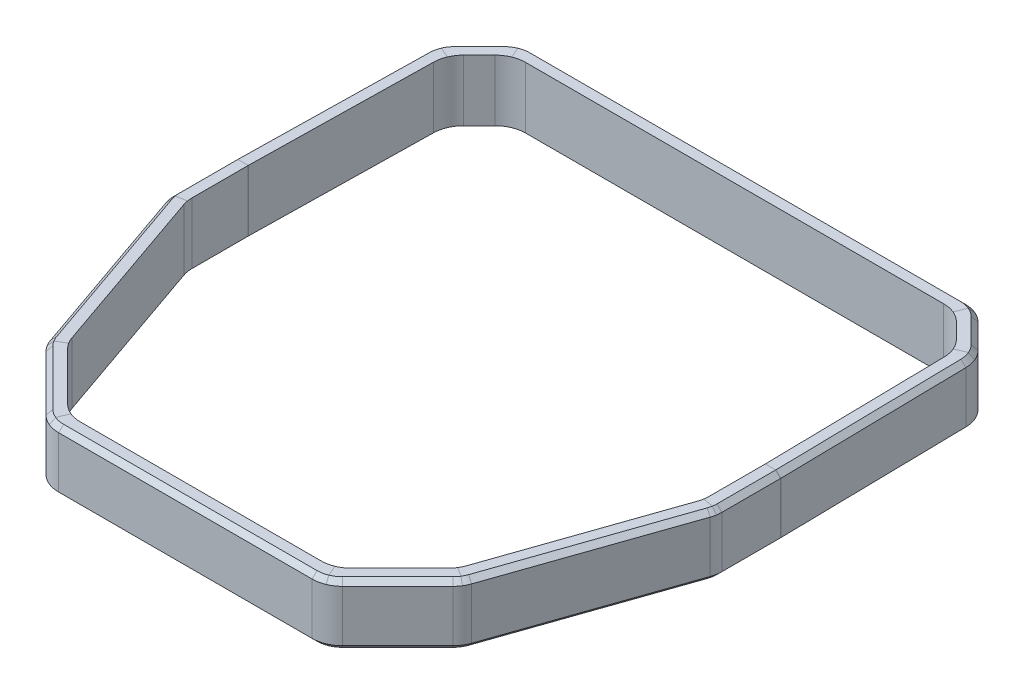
ISO-10303-21;
HEADER;
FILE_DESCRIPTION(('STEP AP214'),'2;1');
FILE_NAME('part.step','',(''),(''),'','','');
FILE_SCHEMA(('AUTOMOTIVE_DESIGN { 1 0 10303 214 1 1 1 1 }'));
ENDSEC;
DATA;
#1=APPLICATION_CONTEXT('core data for automotive mechanical design processes');
#2=APPLICATION_PROTOCOL_DEFINITION('international standard','automotive_design',2000,#1);
#3=PRODUCT_CONTEXT('',#1,'mechanical');
#4=PRODUCT('Part','Part','',(#3));
#5=PRODUCT_RELATED_PRODUCT_CATEGORY('part','',(#4));
#6=PRODUCT_DEFINITION_FORMATION('','',#4);
#7=PRODUCT_DEFINITION_CONTEXT('part definition',#1,'design');
#8=PRODUCT_DEFINITION('design','',#6,#7);
#9=PRODUCT_DEFINITION_SHAPE('','',#8);
#10=(LENGTH_UNIT() NAMED_UNIT(*) SI_UNIT(.MILLI.,.METRE.));
#11=(NAMED_UNIT(*) PLANE_ANGLE_UNIT() SI_UNIT($,.RADIAN.));
#12=(NAMED_UNIT(*) SI_UNIT($,.STERADIAN.) SOLID_ANGLE_UNIT());
#13=UNCERTAINTY_MEASURE_WITH_UNIT(LENGTH_MEASURE(1.E-05),#10,'distance_accuracy_value','');
#14=(GEOMETRIC_REPRESENTATION_CONTEXT(3) GLOBAL_UNCERTAINTY_ASSIGNED_CONTEXT((#13)) GLOBAL_UNIT_ASSIGNED_CONTEXT((#10,
#11,#12)) REPRESENTATION_CONTEXT('',''));
#15=CARTESIAN_POINT('',(0.,0.,0.));
#16=DIRECTION('',(0.,0.,1.));
#17=DIRECTION('',(1.,0.,0.));
#18=AXIS2_PLACEMENT_3D('',#15,#16,#17);
#19=CARTESIAN_POINT('',(-37.6279204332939,-6.35,-55.39994));
#20=DIRECTION('',(0.,0.,-1.));
#21=DIRECTION('',(-1.,0.,0.));
#22=AXIS2_PLACEMENT_3D('',#19,#20,#21);
#23=PLANE('',#22);
#24=DIRECTION('',(1.,0.,0.));
#25=VECTOR('',#24,1.);
#26=CARTESIAN_POINT('',(-37.6279204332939,-6.35,-55.39994));
#27=LINE('',#26,#25);
#28=CARTESIAN_POINT('',(-35.4894719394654,-6.35,-55.39994));
#29=VERTEX_POINT('',#28);
#30=CARTESIAN_POINT('',(7.8796719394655,-6.35,-55.39994));
#31=VERTEX_POINT('',#30);
#32=EDGE_CURVE('E1367',#29,#31,#27,.T.);
#33=ORIENTED_EDGE('',*,*,#32,.T.);
#34=DIRECTION('',(0.,-1.,0.));
#35=VECTOR('',#34,1.);
#36=CARTESIAN_POINT('',(7.8796719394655,0.,-55.39994));
#37=LINE('',#36,#35);
#38=CARTESIAN_POINT('',(7.8796719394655,0.,-55.39994));
#39=VERTEX_POINT('',#38);
#40=EDGE_CURVE('E782',#31,#39,#37,.F.);
#41=ORIENTED_EDGE('',*,*,#40,.T.);
#42=DIRECTION('',(1.,0.,0.));
#43=VECTOR('',#42,1.);
#44=CARTESIAN_POINT('',(-37.6279204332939,0.,-55.39994));
#45=LINE('',#44,#43);
#46=CARTESIAN_POINT('',(-35.4894719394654,0.,-55.39994));
#47=VERTEX_POINT('',#46);
#48=EDGE_CURVE('E1542',#47,#39,#45,.T.);
#49=ORIENTED_EDGE('',*,*,#48,.F.);
#50=DIRECTION('',(0.,-1.,0.));
#51=VECTOR('',#50,1.);
#52=CARTESIAN_POINT('',(-35.4894719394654,-6.35,-55.39994));
#53=LINE('',#52,#51);
#54=EDGE_CURVE('E779',#47,#29,#53,.T.);
#55=ORIENTED_EDGE('',*,*,#54,.T.);
#56=EDGE_LOOP('',(#33,#41,#49,#55));
#57=FACE_BOUND('',#56,.T.);
#58=ADVANCED_FACE('F35',(#57),#23,.F.);
#59=CARTESIAN_POINT('',(-37.6279204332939,-6.35,-56.98744));
#60=DIRECTION('',(0.,1.,0.));
#61=DIRECTION('',(0.,0.,1.));
#62=AXIS2_PLACEMENT_3D('',#59,#60,#61);
#63=PLANE('',#62);
#64=DIRECTION('',(1.,0.,0.));
#65=VECTOR('',#64,1.);
#66=CARTESIAN_POINT('',(-37.6279204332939,-6.35,-56.47944));
#67=LINE('',#66,#65);
#68=CARTESIAN_POINT('',(-36.1470359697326,-6.35,-56.47944));
#69=VERTEX_POINT('',#68);
#70=CARTESIAN_POINT('',(8.53723596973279,-6.35,-56.47944));
#71=VERTEX_POINT('',#70);
#72=EDGE_CURVE('E1118',#69,#71,#67,.T.);
#73=ORIENTED_EDGE('',*,*,#72,.T.);
#74=CARTESIAN_POINT('',(8.53723596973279,-6.35,-53.81244));
#75=DIRECTION('',(0.,1.,0.));
#76=DIRECTION('',(0.,0.,1.));
#77=AXIS2_PLACEMENT_3D('',#74,#75,#76);
#78=CIRCLE('',#77,2.667);
#79=CARTESIAN_POINT('',(9.55785268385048,-6.35,-56.2764267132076));
#80=VERTEX_POINT('',#79);
#81=EDGE_CURVE('E1120',#71,#80,#78,.F.);
#82=ORIENTED_EDGE('',*,*,#81,.T.);
#83=DIRECTION('',(0.382683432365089,0.,-0.923879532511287));
#84=VECTOR('',#83,1.);
#85=CARTESIAN_POINT('',(9.87663849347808,-6.35,-57.0460437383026));
#86=LINE('',#85,#84);
#87=CARTESIAN_POINT('',(9.09469183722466,-6.35,-55.1582575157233));
#88=VERTEX_POINT('',#87);
#89=EDGE_CURVE('E1536',#88,#80,#86,.T.);
#90=ORIENTED_EDGE('',*,*,#89,.F.);
#91=CARTESIAN_POINT('',(7.8796719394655,-6.35,-52.22494));
#92=DIRECTION('',(0.,1.,0.));
#93=DIRECTION('',(0.,0.,1.));
#94=AXIS2_PLACEMENT_3D('',#91,#92,#93);
#95=CIRCLE('',#94,3.175);
#96=EDGE_CURVE('E947',#88,#31,#95,.T.);
#97=ORIENTED_EDGE('',*,*,#96,.T.);
#98=ORIENTED_EDGE('',*,*,#32,.F.);
#99=CARTESIAN_POINT('',(-35.4894719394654,-6.35,-52.22494));
#100=DIRECTION('',(0.,1.,0.));
#101=DIRECTION('',(0.,0.,1.));
#102=AXIS2_PLACEMENT_3D('',#99,#100,#101);
#103=CIRCLE('',#102,3.175);
#104=CARTESIAN_POINT('',(-36.7044918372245,-6.35,-55.1582575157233));
#105=VERTEX_POINT('',#104);
#106=EDGE_CURVE('E954',#29,#105,#103,.T.);
#107=ORIENTED_EDGE('',*,*,#106,.T.);
#108=DIRECTION('',(-0.382683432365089,0.,-0.923879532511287));
#109=VECTOR('',#108,1.);
#110=CARTESIAN_POINT('',(-36.5300177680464,-6.35,-54.7370398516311));
#111=LINE('',#110,#109);
#112=CARTESIAN_POINT('',(-37.1676526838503,-6.35,-56.2764267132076));
#113=VERTEX_POINT('',#112);
#114=EDGE_CURVE('E1520',#105,#113,#111,.T.);
#115=ORIENTED_EDGE('',*,*,#114,.T.);
#116=CARTESIAN_POINT('',(-36.1470359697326,-6.35,-53.81244));
#117=DIRECTION('',(0.,1.,0.));
#118=DIRECTION('',(0.,0.,1.));
#119=AXIS2_PLACEMENT_3D('',#116,#117,#118);
#120=CIRCLE('',#119,2.667);
#121=EDGE_CURVE('E1116',#113,#69,#120,.F.);
#122=ORIENTED_EDGE('',*,*,#121,.T.);
#123=EDGE_LOOP('',(#73,#82,#90,#97,#98,#107,#115,#122));
#124=FACE_BOUND('',#123,.T.);
#125=ADVANCED_FACE('F2063',(#124),#63,.F.);
#126=CARTESIAN_POINT('',(-37.6279204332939,0.,-56.98744));
#127=DIRECTION('',(0.,0.,1.));
#128=DIRECTION('',(0.,-1.,0.));
#129=AXIS2_PLACEMENT_3D('',#126,#127,#128);
#130=PLANE('',#129);
#131=DIRECTION('',(0.,1.,0.));
#132=VECTOR('',#131,1.);
#133=CARTESIAN_POINT('',(8.53723596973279,0.,-56.98744));
#134=LINE('',#133,#132);
#135=CARTESIAN_POINT('',(8.53723596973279,-0.507999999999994,-56.98744));
#136=VERTEX_POINT('',#135);
#137=CARTESIAN_POINT('',(8.53723596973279,-5.84200000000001,-56.98744));
#138=VERTEX_POINT('',#137);
#139=EDGE_CURVE('E819',#136,#138,#134,.F.);
#140=ORIENTED_EDGE('',*,*,#139,.T.);
#141=DIRECTION('',(-1.,0.,0.));
#142=VECTOR('',#141,1.);
#143=CARTESIAN_POINT('',(-37.6279204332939,-5.84200000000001,-56.98744));
#144=LINE('',#143,#142);
#145=CARTESIAN_POINT('',(-36.1470359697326,-5.84200000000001,-56.98744));
#146=VERTEX_POINT('',#145);
#147=EDGE_CURVE('E1128',#138,#146,#144,.T.);
#148=ORIENTED_EDGE('',*,*,#147,.T.);
#149=DIRECTION('',(0.,1.,0.));
#150=VECTOR('',#149,1.);
#151=CARTESIAN_POINT('',(-36.1470359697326,0.,-56.98744));
#152=LINE('',#151,#150);
#153=CARTESIAN_POINT('',(-36.1470359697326,-0.507999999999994,-56.98744));
#154=VERTEX_POINT('',#153);
#155=EDGE_CURVE('E822',#146,#154,#152,.T.);
#156=ORIENTED_EDGE('',*,*,#155,.T.);
#157=DIRECTION('',(1.,0.,0.));
#158=VECTOR('',#157,1.);
#159=CARTESIAN_POINT('',(-37.6279204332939,-0.507999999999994,-56.98744));
#160=LINE('',#159,#158);
#161=EDGE_CURVE('E1126',#154,#136,#160,.T.);
#162=ORIENTED_EDGE('',*,*,#161,.T.);
#163=EDGE_LOOP('',(#140,#148,#156,#162));
#164=FACE_BOUND('',#163,.T.);
#165=ADVANCED_FACE('F1666',(#164),#130,.F.);
#166=CARTESIAN_POINT('',(-37.6279204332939,0.,-55.39994));
#167=DIRECTION('',(0.,-1.,0.));
#168=DIRECTION('',(0.,0.,-1.));
#169=AXIS2_PLACEMENT_3D('',#166,#167,#168);
#170=PLANE('',#169);
#171=DIRECTION('',(-0.382683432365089,0.,0.923879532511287));
#172=VECTOR('',#171,1.);
#173=CARTESIAN_POINT('',(9.31537248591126,0.,-55.6910277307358));
#174=LINE('',#173,#172);
#175=CARTESIAN_POINT('',(9.55785268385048,0.,-56.2764267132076));
#176=VERTEX_POINT('',#175);
#177=CARTESIAN_POINT('',(9.09469183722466,0.,-55.1582575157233));
#178=VERTEX_POINT('',#177);
#179=EDGE_CURVE('E1540',#176,#178,#174,.T.);
#180=ORIENTED_EDGE('',*,*,#179,.F.);
#181=CARTESIAN_POINT('',(8.53723596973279,0.,-53.81244));
#182=DIRECTION('',(0.,-1.,0.));
#183=DIRECTION('',(0.,0.,-1.));
#184=AXIS2_PLACEMENT_3D('',#181,#182,#183);
#185=CIRCLE('',#184,2.667);
#186=CARTESIAN_POINT('',(8.53723596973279,0.,-56.47944));
#187=VERTEX_POINT('',#186);
#188=EDGE_CURVE('E1245',#176,#187,#185,.F.);
#189=ORIENTED_EDGE('',*,*,#188,.T.);
#190=DIRECTION('',(-1.,0.,0.));
#191=VECTOR('',#190,1.);
#192=CARTESIAN_POINT('',(-37.6279204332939,0.,-56.47944));
#193=LINE('',#192,#191);
#194=CARTESIAN_POINT('',(-36.1470359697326,0.,-56.47944));
#195=VERTEX_POINT('',#194);
#196=EDGE_CURVE('E1243',#187,#195,#193,.T.);
#197=ORIENTED_EDGE('',*,*,#196,.T.);
#198=CARTESIAN_POINT('',(-36.1470359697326,0.,-53.81244));
#199=DIRECTION('',(0.,-1.,0.));
#200=DIRECTION('',(0.,0.,-1.));
#201=AXIS2_PLACEMENT_3D('',#198,#199,#200);
#202=CIRCLE('',#201,2.667);
#203=CARTESIAN_POINT('',(-37.1676526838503,0.,-56.2764267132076));
#204=VERTEX_POINT('',#203);
#205=EDGE_CURVE('E1241',#195,#204,#202,.F.);
#206=ORIENTED_EDGE('',*,*,#205,.T.);
#207=DIRECTION('',(0.382683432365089,0.,0.923879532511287));
#208=VECTOR('',#207,1.);
#209=CARTESIAN_POINT('',(-35.9687517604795,0.,-53.3820238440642));
#210=LINE('',#209,#208);
#211=CARTESIAN_POINT('',(-36.7044918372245,0.,-55.1582575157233));
#212=VERTEX_POINT('',#211);
#213=EDGE_CURVE('E1527',#204,#212,#210,.T.);
#214=ORIENTED_EDGE('',*,*,#213,.T.);
#215=CARTESIAN_POINT('',(-35.4894719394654,0.,-52.22494));
#216=DIRECTION('',(0.,-1.,0.));
#217=DIRECTION('',(0.,0.,-1.));
#218=AXIS2_PLACEMENT_3D('',#215,#216,#217);
#219=CIRCLE('',#218,3.175);
#220=EDGE_CURVE('E962',#212,#47,#219,.T.);
#221=ORIENTED_EDGE('',*,*,#220,.T.);
#222=ORIENTED_EDGE('',*,*,#48,.T.);
#223=CARTESIAN_POINT('',(7.8796719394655,0.,-52.22494));
#224=DIRECTION('',(0.,-1.,0.));
#225=DIRECTION('',(0.,0.,-1.));
#226=AXIS2_PLACEMENT_3D('',#223,#224,#225);
#227=CIRCLE('',#226,3.175);
#228=EDGE_CURVE('E949',#39,#178,#227,.T.);
#229=ORIENTED_EDGE('',*,*,#228,.T.);
#230=EDGE_LOOP('',(#180,#189,#197,#206,#214,#221,#222,#229));
#231=FACE_BOUND('',#230,.T.);
#232=ADVANCED_FACE('F1553',(#231),#170,.F.);
#233=CARTESIAN_POINT('',(8.61262453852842,-6.35,-55.9821154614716));
#234=DIRECTION('',(0.707106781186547,0.,-0.707106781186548));
#235=DIRECTION('',(-0.707106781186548,0.,-0.707106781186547));
#236=AXIS2_PLACEMENT_3D('',#233,#234,#235);
#237=PLANE('',#236);
#238=DIRECTION('',(0.707106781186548,0.,0.707106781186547));
#239=VECTOR('',#238,1.);
#240=CARTESIAN_POINT('',(8.61262453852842,-6.35,-55.9821154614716));
#241=LINE('',#240,#239);
#242=CARTESIAN_POINT('',(10.1247359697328,-6.35,-54.4700040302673));
#243=VERTEX_POINT('',#242);
#244=CARTESIAN_POINT('',(11.7543738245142,-6.35,-52.8403661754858));
#245=VERTEX_POINT('',#244);
#246=EDGE_CURVE('E1539',#243,#245,#241,.T.);
#247=ORIENTED_EDGE('',*,*,#246,.T.);
#248=DIRECTION('',(0.,-1.,0.));
#249=VECTOR('',#248,1.);
#250=CARTESIAN_POINT('',(11.7543738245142,0.,-52.8403661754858));
#251=LINE('',#250,#249);
#252=CARTESIAN_POINT('',(11.7543738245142,0.,-52.8403661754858));
#253=VERTEX_POINT('',#252);
#254=EDGE_CURVE('E777',#245,#253,#251,.F.);
#255=ORIENTED_EDGE('',*,*,#254,.T.);
#256=DIRECTION('',(0.707106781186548,0.,0.707106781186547));
#257=VECTOR('',#256,1.);
#258=CARTESIAN_POINT('',(8.61262453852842,0.,-55.9821154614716));
#259=LINE('',#258,#257);
#260=CARTESIAN_POINT('',(10.1247359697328,0.,-54.4700040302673));
#261=VERTEX_POINT('',#260);
#262=EDGE_CURVE('E1532',#261,#253,#259,.T.);
#263=ORIENTED_EDGE('',*,*,#262,.F.);
#264=DIRECTION('',(0.,-1.,0.));
#265=VECTOR('',#264,1.);
#266=CARTESIAN_POINT('',(10.1247359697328,-6.35,-54.4700040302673));
#267=LINE('',#266,#265);
#268=EDGE_CURVE('E774',#261,#243,#267,.T.);
#269=ORIENTED_EDGE('',*,*,#268,.T.);
#270=EDGE_LOOP('',(#247,#255,#263,#269));
#271=FACE_BOUND('',#270,.T.);
#272=ADVANCED_FACE('F1569',(#271),#237,.F.);
#273=CARTESIAN_POINT('',(9.73515655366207,-6.35,-57.1046474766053));
#274=DIRECTION('',(0.,1.,0.));
#275=DIRECTION('',(0.,0.,1.));
#276=AXIS2_PLACEMENT_3D('',#273,#274,#275);
#277=PLANE('',#276);
#278=DIRECTION('',(0.707106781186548,0.,0.707106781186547));
#279=VECTOR('',#278,1.);
#280=CARTESIAN_POINT('',(9.3759463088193,-6.35,-56.7454372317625));
#281=LINE('',#280,#279);
#282=CARTESIAN_POINT('',(10.4230897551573,-6.35,-55.6982937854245));
#283=VERTEX_POINT('',#282);
#284=CARTESIAN_POINT('',(12.9710981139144,-6.35,-53.1502854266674));
#285=VERTEX_POINT('',#284);
#286=EDGE_CURVE('E1082',#283,#285,#281,.T.);
#287=ORIENTED_EDGE('',*,*,#286,.T.);
#288=CARTESIAN_POINT('',(11.0852443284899,-6.35,-51.2644316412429));
#289=DIRECTION('',(0.,1.,0.));
#290=DIRECTION('',(0.,0.,1.));
#291=AXIS2_PLACEMENT_3D('',#288,#289,#290);
#292=CIRCLE('',#291,2.667);
#293=CARTESIAN_POINT('',(13.5401271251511,-6.35,-52.3067557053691));
#294=VERTEX_POINT('',#293);
#295=EDGE_CURVE('E1084',#285,#294,#292,.F.);
#296=ORIENTED_EDGE('',*,*,#295,.T.);
#297=DIRECTION('',(0.920465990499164,0.,-0.390822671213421));
#298=VECTOR('',#297,1.);
#299=CARTESIAN_POINT('',(14.2936903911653,-6.35,-52.6267127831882));
#300=LINE('',#299,#298);
#301=CARTESIAN_POINT('',(12.4317893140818,-6.35,-51.8361641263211));
#302=VERTEX_POINT('',#301);
#303=EDGE_CURVE('E1514',#302,#294,#300,.T.);
#304=ORIENTED_EDGE('',*,*,#303,.F.);
#305=CARTESIAN_POINT('',(9.50930979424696,-6.35,-50.5953021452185));
#306=DIRECTION('',(0.,1.,0.));
#307=DIRECTION('',(0.,0.,1.));
#308=AXIS2_PLACEMENT_3D('',#305,#306,#307);
#309=CIRCLE('',#308,3.175);
#310=EDGE_CURVE('E937',#302,#245,#309,.T.);
#311=ORIENTED_EDGE('',*,*,#310,.T.);
#312=ORIENTED_EDGE('',*,*,#246,.F.);
#313=CARTESIAN_POINT('',(7.8796719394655,-6.35,-52.22494));
#314=DIRECTION('',(0.,1.,0.));
#315=DIRECTION('',(0.,0.,1.));
#316=AXIS2_PLACEMENT_3D('',#313,#314,#315);
#317=CIRCLE('',#316,3.175);
#318=EDGE_CURVE('E944',#243,#88,#317,.T.);
#319=ORIENTED_EDGE('',*,*,#318,.T.);
#320=ORIENTED_EDGE('',*,*,#89,.T.);
#321=CARTESIAN_POINT('',(8.53723596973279,-6.35,-53.81244));
#322=DIRECTION('',(0.,1.,0.));
#323=DIRECTION('',(0.,0.,1.));
#324=AXIS2_PLACEMENT_3D('',#321,#322,#323);
#325=CIRCLE('',#324,2.667);
#326=EDGE_CURVE('E1080',#80,#283,#325,.F.);
#327=ORIENTED_EDGE('',*,*,#326,.T.);
#328=EDGE_LOOP('',(#287,#296,#304,#311,#312,#319,#320,#327));
#329=FACE_BOUND('',#328,.T.);
#330=ADVANCED_FACE('F2054',(#329),#277,.F.);
#331=CARTESIAN_POINT('',(9.73515655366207,0.,-57.1046474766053));
#332=DIRECTION('',(-0.707106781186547,0.,0.707106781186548));
#333=DIRECTION('',(0.707106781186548,0.,0.707106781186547));
#334=AXIS2_PLACEMENT_3D('',#331,#332,#333);
#335=PLANE('',#334);
#336=DIRECTION('',(0.,1.,0.));
#337=VECTOR('',#336,1.);
#338=CARTESIAN_POINT('',(13.3303083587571,0.,-53.5094956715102));
#339=LINE('',#338,#337);
#340=CARTESIAN_POINT('',(13.3303083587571,-0.507999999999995,-53.5094956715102));
#341=VERTEX_POINT('',#340);
#342=CARTESIAN_POINT('',(13.3303083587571,-5.84200000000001,-53.5094956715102));
#343=VERTEX_POINT('',#342);
#344=EDGE_CURVE('E825',#341,#343,#339,.F.);
#345=ORIENTED_EDGE('',*,*,#344,.T.);
#346=DIRECTION('',(-0.707106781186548,0.,-0.707106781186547));
#347=VECTOR('',#346,1.);
#348=CARTESIAN_POINT('',(9.73515655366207,-5.84200000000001,-57.1046474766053));
#349=LINE('',#348,#347);
#350=CARTESIAN_POINT('',(10.7823000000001,-5.84200000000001,-56.0575040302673));
#351=VERTEX_POINT('',#350);
#352=EDGE_CURVE('E1092',#343,#351,#349,.T.);
#353=ORIENTED_EDGE('',*,*,#352,.T.);
#354=DIRECTION('',(0.,1.,0.));
#355=VECTOR('',#354,1.);
#356=CARTESIAN_POINT('',(10.7823000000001,0.,-56.0575040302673));
#357=LINE('',#356,#355);
#358=CARTESIAN_POINT('',(10.7823000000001,-0.507999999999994,-56.0575040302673));
#359=VERTEX_POINT('',#358);
#360=EDGE_CURVE('E828',#351,#359,#357,.T.);
#361=ORIENTED_EDGE('',*,*,#360,.T.);
#362=DIRECTION('',(0.707106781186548,0.,0.707106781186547));
#363=VECTOR('',#362,1.);
#364=CARTESIAN_POINT('',(9.73515655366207,-0.507999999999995,-57.1046474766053));
#365=LINE('',#364,#363);
#366=EDGE_CURVE('E1090',#359,#341,#365,.T.);
#367=ORIENTED_EDGE('',*,*,#366,.T.);
#368=EDGE_LOOP('',(#345,#353,#361,#367));
#369=FACE_BOUND('',#368,.T.);
#370=ADVANCED_FACE('F1638',(#369),#335,.F.);
#371=CARTESIAN_POINT('',(8.61262453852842,0.,-55.9821154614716));
#372=DIRECTION('',(0.,-1.,0.));
#373=DIRECTION('',(0.,0.,-1.));
#374=AXIS2_PLACEMENT_3D('',#371,#372,#373);
#375=PLANE('',#374);
#376=DIRECTION('',(-0.920465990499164,0.,0.390822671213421));
#377=VECTOR('',#376,1.);
#378=CARTESIAN_POINT('',(12.9387980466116,0.,-52.0514360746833));
#379=LINE('',#378,#377);
#380=CARTESIAN_POINT('',(13.5401271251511,0.,-52.3067557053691));
#381=VERTEX_POINT('',#380);
#382=CARTESIAN_POINT('',(12.4317893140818,0.,-51.8361641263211));
#383=VERTEX_POINT('',#382);
#384=EDGE_CURVE('E1518',#381,#383,#379,.T.);
#385=ORIENTED_EDGE('',*,*,#384,.F.);
#386=CARTESIAN_POINT('',(11.0852443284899,0.,-51.2644316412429));
#387=DIRECTION('',(0.,-1.,0.));
#388=DIRECTION('',(0.,0.,-1.));
#389=AXIS2_PLACEMENT_3D('',#386,#387,#388);
#390=CIRCLE('',#389,2.667);
#391=CARTESIAN_POINT('',(12.9710981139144,0.,-53.1502854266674));
#392=VERTEX_POINT('',#391);
#393=EDGE_CURVE('E1233',#381,#392,#390,.F.);
#394=ORIENTED_EDGE('',*,*,#393,.T.);
#395=DIRECTION('',(-0.707106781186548,0.,-0.707106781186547));
#396=VECTOR('',#395,1.);
#397=CARTESIAN_POINT('',(9.37594630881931,0.,-56.7454372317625));
#398=LINE('',#397,#396);
#399=CARTESIAN_POINT('',(10.4230897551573,0.,-55.6982937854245));
#400=VERTEX_POINT('',#399);
#401=EDGE_CURVE('E1231',#392,#400,#398,.T.);
#402=ORIENTED_EDGE('',*,*,#401,.T.);
#403=CARTESIAN_POINT('',(8.53723596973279,0.,-53.81244));
#404=DIRECTION('',(0.,-1.,0.));
#405=DIRECTION('',(0.,0.,-1.));
#406=AXIS2_PLACEMENT_3D('',#403,#404,#405);
#407=CIRCLE('',#406,2.667);
#408=EDGE_CURVE('E1229',#400,#176,#407,.F.);
#409=ORIENTED_EDGE('',*,*,#408,.T.);
#410=ORIENTED_EDGE('',*,*,#179,.T.);
#411=CARTESIAN_POINT('',(7.8796719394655,0.,-52.22494));
#412=DIRECTION('',(0.,-1.,0.));
#413=DIRECTION('',(0.,0.,-1.));
#414=AXIS2_PLACEMENT_3D('',#411,#412,#413);
#415=CIRCLE('',#414,3.175);
#416=EDGE_CURVE('E952',#178,#261,#415,.T.);
#417=ORIENTED_EDGE('',*,*,#416,.T.);
#418=ORIENTED_EDGE('',*,*,#262,.T.);
#419=CARTESIAN_POINT('',(9.50930979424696,0.,-50.5953021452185));
#420=DIRECTION('',(0.,-1.,0.));
#421=DIRECTION('',(0.,0.,-1.));
#422=AXIS2_PLACEMENT_3D('',#419,#420,#421);
#423=CIRCLE('',#422,3.175);
#424=EDGE_CURVE('E939',#253,#383,#423,.T.);
#425=ORIENTED_EDGE('',*,*,#424,.T.);
#426=EDGE_LOOP('',(#385,#394,#402,#409,#410,#417,#418,#425));
#427=FACE_BOUND('',#426,.T.);
#428=ADVANCED_FACE('F1566',(#427),#375,.F.);
#429=CARTESIAN_POINT('',(-40.8404323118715,-6.35,-51.3641076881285));
#430=DIRECTION('',(-0.707106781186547,0.,-0.707106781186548));
#431=DIRECTION('',(-0.707106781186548,0.,0.707106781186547));
#432=AXIS2_PLACEMENT_3D('',#429,#430,#431);
#433=PLANE('',#432);
#434=DIRECTION('',(0.707106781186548,0.,-0.707106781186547));
#435=VECTOR('',#434,1.);
#436=CARTESIAN_POINT('',(-40.8404323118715,-6.35,-51.3641076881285));
#437=LINE('',#436,#435);
#438=CARTESIAN_POINT('',(-39.3641738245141,-6.35,-52.8403661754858));
#439=VERTEX_POINT('',#438);
#440=CARTESIAN_POINT('',(-37.7345359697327,-6.35,-54.4700040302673));
#441=VERTEX_POINT('',#440);
#442=EDGE_CURVE('E1528',#439,#441,#437,.T.);
#443=ORIENTED_EDGE('',*,*,#442,.T.);
#444=DIRECTION('',(0.,-1.,0.));
#445=VECTOR('',#444,1.);
#446=CARTESIAN_POINT('',(-37.7345359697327,0.,-54.4700040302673));
#447=LINE('',#446,#445);
#448=CARTESIAN_POINT('',(-37.7345359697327,0.,-54.4700040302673));
#449=VERTEX_POINT('',#448);
#450=EDGE_CURVE('E787',#441,#449,#447,.F.);
#451=ORIENTED_EDGE('',*,*,#450,.T.);
#452=DIRECTION('',(0.707106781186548,0.,-0.707106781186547));
#453=VECTOR('',#452,1.);
#454=CARTESIAN_POINT('',(-40.8404323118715,0.,-51.3641076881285));
#455=LINE('',#454,#453);
#456=CARTESIAN_POINT('',(-39.3641738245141,0.,-52.8403661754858));
#457=VERTEX_POINT('',#456);
#458=EDGE_CURVE('E1531',#457,#449,#455,.T.);
#459=ORIENTED_EDGE('',*,*,#458,.F.);
#460=DIRECTION('',(0.,-1.,0.));
#461=VECTOR('',#460,1.);
#462=CARTESIAN_POINT('',(-39.3641738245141,-6.35,-52.8403661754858));
#463=LINE('',#462,#461);
#464=EDGE_CURVE('E784',#457,#439,#463,.T.);
#465=ORIENTED_EDGE('',*,*,#464,.T.);
#466=EDGE_LOOP('',(#443,#451,#459,#465));
#467=FACE_BOUND('',#466,.T.);
#468=ADVANCED_FACE('F2045',(#467),#433,.F.);
#469=CARTESIAN_POINT('',(-41.9629643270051,-6.35,-52.4866397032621));
#470=DIRECTION('',(0.,1.,0.));
#471=DIRECTION('',(0.,0.,1.));
#472=AXIS2_PLACEMENT_3D('',#469,#470,#471);
#473=PLANE('',#472);
#474=DIRECTION('',(0.707106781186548,0.,-0.707106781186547));
#475=VECTOR('',#474,1.);
#476=CARTESIAN_POINT('',(-41.6037540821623,-6.35,-52.1274294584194));
#477=LINE('',#476,#475);
#478=CARTESIAN_POINT('',(-40.5808981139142,-6.35,-53.1502854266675));
#479=VERTEX_POINT('',#478);
#480=CARTESIAN_POINT('',(-38.0328897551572,-6.35,-55.6982937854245));
#481=VERTEX_POINT('',#480);
#482=EDGE_CURVE('E1154',#479,#481,#477,.T.);
#483=ORIENTED_EDGE('',*,*,#482,.T.);
#484=CARTESIAN_POINT('',(-36.1470359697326,-6.35,-53.81244));
#485=DIRECTION('',(0.,1.,0.));
#486=DIRECTION('',(0.,0.,1.));
#487=AXIS2_PLACEMENT_3D('',#484,#485,#486);
#488=CIRCLE('',#487,2.667);
#489=EDGE_CURVE('E1156',#481,#113,#488,.F.);
#490=ORIENTED_EDGE('',*,*,#489,.T.);
#491=ORIENTED_EDGE('',*,*,#114,.F.);
#492=CARTESIAN_POINT('',(-35.4894719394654,-6.35,-52.22494));
#493=DIRECTION('',(0.,1.,0.));
#494=DIRECTION('',(0.,0.,1.));
#495=AXIS2_PLACEMENT_3D('',#492,#493,#494);
#496=CIRCLE('',#495,3.175);
#497=EDGE_CURVE('E957',#105,#441,#496,.T.);
#498=ORIENTED_EDGE('',*,*,#497,.T.);
#499=ORIENTED_EDGE('',*,*,#442,.F.);
#500=CARTESIAN_POINT('',(-37.1191097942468,-6.35,-50.5953021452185));
#501=DIRECTION('',(0.,1.,0.));
#502=DIRECTION('',(0.,0.,1.));
#503=AXIS2_PLACEMENT_3D('',#500,#501,#502);
#504=CIRCLE('',#503,3.175);
#505=CARTESIAN_POINT('',(-40.0415893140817,-6.35,-51.8361641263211));
#506=VERTEX_POINT('',#505);
#507=EDGE_CURVE('E964',#439,#506,#504,.T.);
#508=ORIENTED_EDGE('',*,*,#507,.T.);
#509=DIRECTION('',(-0.920465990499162,0.,-0.390822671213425));
#510=VECTOR('',#509,1.);
#511=CARTESIAN_POINT('',(-34.5980078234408,-6.35,-49.5248619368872));
#512=LINE('',#511,#510);
#513=CARTESIAN_POINT('',(-41.149927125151,-6.35,-52.3067557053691));
#514=VERTEX_POINT('',#513);
#515=EDGE_CURVE('E1503',#506,#514,#512,.T.);
#516=ORIENTED_EDGE('',*,*,#515,.T.);
#517=CARTESIAN_POINT('',(-38.6950443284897,-6.35,-51.2644316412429));
#518=DIRECTION('',(0.,1.,0.));
#519=DIRECTION('',(0.,0.,1.));
#520=AXIS2_PLACEMENT_3D('',#517,#518,#519);
#521=CIRCLE('',#520,2.667);
#522=EDGE_CURVE('E1152',#514,#479,#521,.F.);
#523=ORIENTED_EDGE('',*,*,#522,.T.);
#524=EDGE_LOOP('',(#483,#490,#491,#498,#499,#508,#516,#523));
#525=FACE_BOUND('',#524,.T.);
#526=ADVANCED_FACE('F2042',(#525),#473,.F.);
#527=CARTESIAN_POINT('',(-41.9629643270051,0.,-52.4866397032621));
#528=DIRECTION('',(0.707106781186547,0.,0.707106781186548));
#529=DIRECTION('',(0.707106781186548,0.,-0.707106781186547));
#530=AXIS2_PLACEMENT_3D('',#527,#528,#529);
#531=PLANE('',#530);
#532=DIRECTION('',(0.,1.,0.));
#533=VECTOR('',#532,1.);
#534=CARTESIAN_POINT('',(-38.3920999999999,0.,-56.0575040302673));
#535=LINE('',#534,#533);
#536=CARTESIAN_POINT('',(-38.3920999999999,-0.507999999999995,-56.0575040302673));
#537=VERTEX_POINT('',#536);
#538=CARTESIAN_POINT('',(-38.3920999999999,-5.84200000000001,-56.0575040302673));
#539=VERTEX_POINT('',#538);
#540=EDGE_CURVE('E789',#537,#539,#535,.F.);
#541=ORIENTED_EDGE('',*,*,#540,.T.);
#542=DIRECTION('',(-0.707106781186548,0.,0.707106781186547));
#543=VECTOR('',#542,1.);
#544=CARTESIAN_POINT('',(-41.9629643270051,-5.84200000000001,-52.4866397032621));
#545=LINE('',#544,#543);
#546=CARTESIAN_POINT('',(-40.940108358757,-5.84200000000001,-53.5094956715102));
#547=VERTEX_POINT('',#546);
#548=EDGE_CURVE('E1164',#539,#547,#545,.T.);
#549=ORIENTED_EDGE('',*,*,#548,.T.);
#550=DIRECTION('',(0.,1.,0.));
#551=VECTOR('',#550,1.);
#552=CARTESIAN_POINT('',(-40.940108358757,0.,-53.5094956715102));
#553=LINE('',#552,#551);
#554=CARTESIAN_POINT('',(-40.940108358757,-0.507999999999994,-53.5094956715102));
#555=VERTEX_POINT('',#554);
#556=EDGE_CURVE('E792',#547,#555,#553,.T.);
#557=ORIENTED_EDGE('',*,*,#556,.T.);
#558=DIRECTION('',(0.707106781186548,0.,-0.707106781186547));
#559=VECTOR('',#558,1.);
#560=CARTESIAN_POINT('',(-41.9629643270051,-0.507999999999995,-52.4866397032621));
#561=LINE('',#560,#559);
#562=EDGE_CURVE('E1162',#555,#537,#561,.T.);
#563=ORIENTED_EDGE('',*,*,#562,.T.);
#564=EDGE_LOOP('',(#541,#549,#557,#563));
#565=FACE_BOUND('',#564,.T.);
#566=ADVANCED_FACE('F1685',(#565),#531,.F.);
#567=CARTESIAN_POINT('',(-40.8404323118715,0.,-51.3641076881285));
#568=DIRECTION('',(0.,-1.,0.));
#569=DIRECTION('',(0.,0.,-1.));
#570=AXIS2_PLACEMENT_3D('',#567,#568,#569);
#571=PLANE('',#570);
#572=ORIENTED_EDGE('',*,*,#213,.F.);
#573=CARTESIAN_POINT('',(-36.1470359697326,0.,-53.81244));
#574=DIRECTION('',(0.,-1.,0.));
#575=DIRECTION('',(0.,0.,-1.));
#576=AXIS2_PLACEMENT_3D('',#573,#574,#575);
#577=CIRCLE('',#576,2.667);
#578=CARTESIAN_POINT('',(-38.0328897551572,0.,-55.6982937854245));
#579=VERTEX_POINT('',#578);
#580=EDGE_CURVE('E1257',#204,#579,#577,.F.);
#581=ORIENTED_EDGE('',*,*,#580,.T.);
#582=DIRECTION('',(-0.707106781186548,0.,0.707106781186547));
#583=VECTOR('',#582,1.);
#584=CARTESIAN_POINT('',(-41.6037540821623,0.,-52.1274294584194));
#585=LINE('',#584,#583);
#586=CARTESIAN_POINT('',(-40.5808981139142,0.,-53.1502854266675));
#587=VERTEX_POINT('',#586);
#588=EDGE_CURVE('E1255',#579,#587,#585,.T.);
#589=ORIENTED_EDGE('',*,*,#588,.T.);
#590=CARTESIAN_POINT('',(-38.6950443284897,0.,-51.2644316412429));
#591=DIRECTION('',(0.,-1.,0.));
#592=DIRECTION('',(0.,0.,-1.));
#593=AXIS2_PLACEMENT_3D('',#590,#591,#592);
#594=CIRCLE('',#593,2.667);
#595=CARTESIAN_POINT('',(-41.149927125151,0.,-52.3067557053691));
#596=VERTEX_POINT('',#595);
#597=EDGE_CURVE('E1253',#587,#596,#594,.F.);
#598=ORIENTED_EDGE('',*,*,#597,.T.);
#599=DIRECTION('',(0.920465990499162,0.,0.390822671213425));
#600=VECTOR('',#599,1.);
#601=CARTESIAN_POINT('',(-33.2431154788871,0.,-48.9495852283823));
#602=LINE('',#601,#600);
#603=CARTESIAN_POINT('',(-40.0415893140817,0.,-51.8361641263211));
#604=VERTEX_POINT('',#603);
#605=EDGE_CURVE('E722',#596,#604,#602,.T.);
#606=ORIENTED_EDGE('',*,*,#605,.T.);
#607=CARTESIAN_POINT('',(-37.1191097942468,0.,-50.5953021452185));
#608=DIRECTION('',(0.,-1.,0.));
#609=DIRECTION('',(0.,0.,-1.));
#610=AXIS2_PLACEMENT_3D('',#607,#608,#609);
#611=CIRCLE('',#610,3.175);
#612=EDGE_CURVE('E971',#604,#457,#611,.T.);
#613=ORIENTED_EDGE('',*,*,#612,.T.);
#614=ORIENTED_EDGE('',*,*,#458,.T.);
#615=CARTESIAN_POINT('',(-35.4894719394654,0.,-52.22494));
#616=DIRECTION('',(0.,-1.,0.));
#617=DIRECTION('',(0.,0.,-1.));
#618=AXIS2_PLACEMENT_3D('',#615,#616,#617);
#619=CIRCLE('',#618,3.175);
#620=EDGE_CURVE('E959',#449,#212,#619,.T.);
#621=ORIENTED_EDGE('',*,*,#620,.T.);
#622=EDGE_LOOP('',(#572,#581,#589,#598,#606,#613,#614,#621));
#623=FACE_BOUND('',#622,.T.);
#624=ADVANCED_FACE('F2036',(#623),#571,.F.);
#625=CARTESIAN_POINT('',(12.6469637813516,-6.35,-52.7387644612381));
#626=DIRECTION('',(0.999844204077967,0.,-0.0176512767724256));
#627=DIRECTION('',(-0.0176512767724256,0.,-0.999844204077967));
#628=AXIS2_PLACEMENT_3D('',#625,#626,#627);
#629=PLANE('',#628);
#630=DIRECTION('',(0.0176512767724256,0.,0.999844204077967));
#631=VECTOR('',#630,1.);
#632=CARTESIAN_POINT('',(12.6469637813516,-6.35,-52.7387644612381));
#633=LINE('',#632,#631);
#634=CARTESIAN_POINT('',(12.6838151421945,-6.35,-50.651344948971));
#635=VERTEX_POINT('',#634);
#636=CARTESIAN_POINT('',(13.0170053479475,-6.35,-31.7780192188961));
#637=VERTEX_POINT('',#636);
#638=EDGE_CURVE('E1517',#635,#637,#633,.T.);
#639=ORIENTED_EDGE('',*,*,#638,.T.);
#640=DIRECTION('',(0.,-1.,0.));
#641=VECTOR('',#640,1.);
#642=CARTESIAN_POINT('',(13.0170053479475,0.,-31.7780192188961));
#643=LINE('',#642,#641);
#644=CARTESIAN_POINT('',(13.0170053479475,0.,-31.7780192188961));
#645=VERTEX_POINT('',#644);
#646=EDGE_CURVE('E772',#637,#645,#643,.F.);
#647=ORIENTED_EDGE('',*,*,#646,.T.);
#648=DIRECTION('',(0.0176512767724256,0.,0.999844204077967));
#649=VECTOR('',#648,1.);
#650=CARTESIAN_POINT('',(12.6469637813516,0.,-52.7387644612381));
#651=LINE('',#650,#649);
#652=CARTESIAN_POINT('',(12.6838151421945,0.,-50.651344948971));
#653=VERTEX_POINT('',#652);
#654=EDGE_CURVE('E1511',#653,#645,#651,.T.);
#655=ORIENTED_EDGE('',*,*,#654,.F.);
#656=DIRECTION('',(0.,-1.,0.));
#657=VECTOR('',#656,1.);
#658=CARTESIAN_POINT('',(12.6838151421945,-6.35,-50.651344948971));
#659=LINE('',#658,#657);
#660=EDGE_CURVE('E769',#653,#635,#659,.T.);
#661=ORIENTED_EDGE('',*,*,#660,.T.);
#662=EDGE_LOOP('',(#639,#647,#655,#661));
#663=FACE_BOUND('',#662,.T.);
#664=ADVANCED_FACE('F1625',(#663),#629,.F.);
#665=CARTESIAN_POINT('',(14.2342164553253,-6.35,-52.7667858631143));
#666=DIRECTION('',(0.,1.,0.));
#667=DIRECTION('',(0.,0.,1.));
#668=AXIS2_PLACEMENT_3D('',#665,#666,#667);
#669=PLANE('',#668);
#670=DIRECTION('',(0.0176512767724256,0.,0.999844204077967));
#671=VECTOR('',#670,1.);
#672=CARTESIAN_POINT('',(13.7262955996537,-6.35,-52.7578190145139));
#673=LINE('',#672,#671);
#674=CARTESIAN_POINT('',(13.7518288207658,-6.35,-51.311507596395));
#675=VERTEX_POINT('',#674);
#676=CARTESIAN_POINT('',(14.0965844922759,-6.35,-31.783064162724));
#677=VERTEX_POINT('',#676);
#678=EDGE_CURVE('E1046',#675,#677,#673,.T.);
#679=ORIENTED_EDGE('',*,*,#678,.T.);
#680=CARTESIAN_POINT('',(11.43,-6.35,-31.7359882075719));
#681=DIRECTION('',(0.,1.,0.));
#682=DIRECTION('',(0.,0.,1.));
#683=AXIS2_PLACEMENT_3D('',#680,#681,#682);
#684=CIRCLE('',#683,2.66700000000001);
#685=CARTESIAN_POINT('',(14.0968961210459,-6.35,-31.7595271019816));
#686=VERTEX_POINT('',#685);
#687=EDGE_CURVE('E1048',#677,#686,#684,.F.);
#688=ORIENTED_EDGE('',*,*,#687,.T.);
#689=DIRECTION('',(0.999961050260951,0.,-0.00882598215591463));
#690=VECTOR('',#689,1.);
#691=CARTESIAN_POINT('',(14.6066414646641,-6.35,-31.7640262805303));
#692=LINE('',#691,#690);
#693=CARTESIAN_POINT('',(13.0173763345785,-6.35,-31.7499989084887));
#694=VERTEX_POINT('',#693);
#695=EDGE_CURVE('E1497',#694,#686,#692,.T.);
#696=ORIENTED_EDGE('',*,*,#695,.F.);
#697=CARTESIAN_POINT('',(9.84249999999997,-6.35,-31.7219764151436));
#698=DIRECTION('',(0.,1.,0.));
#699=DIRECTION('',(0.,0.,1.));
#700=AXIS2_PLACEMENT_3D('',#697,#698,#699);
#701=CIRCLE('',#700,3.175);
#702=EDGE_CURVE('E927',#694,#637,#701,.T.);
#703=ORIENTED_EDGE('',*,*,#702,.T.);
#704=ORIENTED_EDGE('',*,*,#638,.F.);
#705=CARTESIAN_POINT('',(9.50930979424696,-6.35,-50.5953021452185));
#706=DIRECTION('',(0.,1.,0.));
#707=DIRECTION('',(0.,0.,1.));
#708=AXIS2_PLACEMENT_3D('',#705,#706,#707);
#709=CIRCLE('',#708,3.175);
#710=EDGE_CURVE('E934',#635,#302,#709,.T.);
#711=ORIENTED_EDGE('',*,*,#710,.T.);
#712=ORIENTED_EDGE('',*,*,#303,.T.);
#713=CARTESIAN_POINT('',(11.0852443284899,-6.35,-51.2644316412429));
#714=DIRECTION('',(0.,1.,0.));
#715=DIRECTION('',(0.,0.,1.));
#716=AXIS2_PLACEMENT_3D('',#713,#714,#715);
#717=CIRCLE('',#716,2.667);
#718=EDGE_CURVE('E1044',#294,#675,#717,.F.);
#719=ORIENTED_EDGE('',*,*,#718,.T.);
#720=EDGE_LOOP('',(#679,#688,#696,#703,#704,#711,#712,#719));
#721=FACE_BOUND('',#720,.T.);
#722=ADVANCED_FACE('F1612',(#721),#669,.F.);
#723=CARTESIAN_POINT('',(14.2342164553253,0.,-52.7667858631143));
#724=DIRECTION('',(-0.999844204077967,0.,0.0176512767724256));
#725=DIRECTION('',(0.0176512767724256,0.,0.999844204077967));
#726=AXIS2_PLACEMENT_3D('',#723,#724,#725);
#727=PLANE('',#726);
#728=DIRECTION('',(0.,1.,0.));
#729=VECTOR('',#728,1.);
#730=CARTESIAN_POINT('',(14.6045053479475,0.,-31.7920310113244));
#731=LINE('',#730,#729);
#732=CARTESIAN_POINT('',(14.6045053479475,-0.507999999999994,-31.7920310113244));
#733=VERTEX_POINT('',#732);
#734=CARTESIAN_POINT('',(14.6045053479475,-5.84200000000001,-31.7920310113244));
#735=VERTEX_POINT('',#734);
#736=EDGE_CURVE('E840',#733,#735,#731,.F.);
#737=ORIENTED_EDGE('',*,*,#736,.T.);
#738=DIRECTION('',(-0.0176512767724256,0.,-0.999844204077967));
#739=VECTOR('',#738,1.);
#740=CARTESIAN_POINT('',(14.2342164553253,-5.84200000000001,-52.7667858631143));
#741=LINE('',#740,#739);
#742=CARTESIAN_POINT('',(14.2597496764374,-5.84200000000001,-51.3204744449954));
#743=VERTEX_POINT('',#742);
#744=EDGE_CURVE('E1056',#735,#743,#741,.T.);
#745=ORIENTED_EDGE('',*,*,#744,.T.);
#746=DIRECTION('',(0.,1.,0.));
#747=VECTOR('',#746,1.);
#748=CARTESIAN_POINT('',(14.2597496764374,0.,-51.3204744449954));
#749=LINE('',#748,#747);
#750=CARTESIAN_POINT('',(14.2597496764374,-0.507999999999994,-51.3204744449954));
#751=VERTEX_POINT('',#750);
#752=EDGE_CURVE('E837',#743,#751,#749,.T.);
#753=ORIENTED_EDGE('',*,*,#752,.T.);
#754=DIRECTION('',(0.0176512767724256,0.,0.999844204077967));
#755=VECTOR('',#754,1.);
#756=CARTESIAN_POINT('',(14.2342164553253,-0.507999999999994,-52.7667858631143));
#757=LINE('',#756,#755);
#758=EDGE_CURVE('E1054',#751,#733,#757,.T.);
#759=ORIENTED_EDGE('',*,*,#758,.T.);
#760=EDGE_LOOP('',(#737,#745,#753,#759));
#761=FACE_BOUND('',#760,.T.);
#762=ADVANCED_FACE('F1597',(#761),#727,.F.);
#763=CARTESIAN_POINT('',(12.6469637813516,0.,-52.7387644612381));
#764=DIRECTION('',(0.,-1.,0.));
#765=DIRECTION('',(1.,0.,0.));
#766=AXIS2_PLACEMENT_3D('',#763,#764,#765);
#767=PLANE('',#766);
#768=DIRECTION('',(-0.999961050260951,0.,0.00882598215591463));
#769=VECTOR('',#768,1.);
#770=CARTESIAN_POINT('',(13.0192651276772,0.,-31.7500155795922));
#771=LINE('',#770,#769);
#772=CARTESIAN_POINT('',(14.0968961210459,0.,-31.7595271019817));
#773=VERTEX_POINT('',#772);
#774=CARTESIAN_POINT('',(13.0173763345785,0.,-31.7499989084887));
#775=VERTEX_POINT('',#774);
#776=EDGE_CURVE('E1501',#773,#775,#771,.T.);
#777=ORIENTED_EDGE('',*,*,#776,.F.);
#778=CARTESIAN_POINT('',(11.43,0.,-31.7359882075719));
#779=DIRECTION('',(0.,-1.,0.));
#780=DIRECTION('',(1.,0.,0.));
#781=AXIS2_PLACEMENT_3D('',#778,#779,#780);
#782=CIRCLE('',#781,2.667);
#783=CARTESIAN_POINT('',(14.0965844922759,0.,-31.783064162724));
#784=VERTEX_POINT('',#783);
#785=EDGE_CURVE('E1221',#773,#784,#782,.F.);
#786=ORIENTED_EDGE('',*,*,#785,.T.);
#787=DIRECTION('',(-0.0176512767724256,0.,-0.999844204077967));
#788=VECTOR('',#787,1.);
#789=CARTESIAN_POINT('',(13.7262955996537,0.,-52.7578190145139));
#790=LINE('',#789,#788);
#791=CARTESIAN_POINT('',(13.7518288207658,0.,-51.311507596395));
#792=VERTEX_POINT('',#791);
#793=EDGE_CURVE('E1219',#784,#792,#790,.T.);
#794=ORIENTED_EDGE('',*,*,#793,.T.);
#795=CARTESIAN_POINT('',(11.0852443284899,0.,-51.2644316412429));
#796=DIRECTION('',(0.,-1.,0.));
#797=DIRECTION('',(1.,0.,0.));
#798=AXIS2_PLACEMENT_3D('',#795,#796,#797);
#799=CIRCLE('',#798,2.667);
#800=EDGE_CURVE('E1217',#792,#381,#799,.F.);
#801=ORIENTED_EDGE('',*,*,#800,.T.);
#802=ORIENTED_EDGE('',*,*,#384,.T.);
#803=CARTESIAN_POINT('',(9.50930979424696,0.,-50.5953021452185));
#804=DIRECTION('',(0.,-1.,0.));
#805=DIRECTION('',(1.,0.,0.));
#806=AXIS2_PLACEMENT_3D('',#803,#804,#805);
#807=CIRCLE('',#806,3.175);
#808=EDGE_CURVE('E942',#383,#653,#807,.T.);
#809=ORIENTED_EDGE('',*,*,#808,.T.);
#810=ORIENTED_EDGE('',*,*,#654,.T.);
#811=CARTESIAN_POINT('',(9.84249999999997,0.,-31.7219764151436));
#812=DIRECTION('',(0.,-1.,0.));
#813=DIRECTION('',(1.,0.,0.));
#814=AXIS2_PLACEMENT_3D('',#811,#812,#813);
#815=CIRCLE('',#814,3.175);
#816=EDGE_CURVE('E929',#645,#775,#815,.T.);
#817=ORIENTED_EDGE('',*,*,#816,.T.);
#818=EDGE_LOOP('',(#777,#786,#794,#801,#802,#809,#810,#817));
#819=FACE_BOUND('',#818,.T.);
#820=ADVANCED_FACE('F2027',(#819),#767,.F.);
#821=CARTESIAN_POINT('',(-40.6308302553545,-6.35,-31.5500311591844));
#822=DIRECTION('',(-0.999844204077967,0.,-0.0176512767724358));
#823=DIRECTION('',(-0.0176512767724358,0.,0.999844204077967));
#824=AXIS2_PLACEMENT_3D('',#821,#822,#823);
#825=PLANE('',#824);
#826=DIRECTION('',(0.0176512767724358,0.,-0.999844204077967));
#827=VECTOR('',#826,1.);
#828=CARTESIAN_POINT('',(-40.6308302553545,0.,-31.5500311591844));
#829=LINE('',#828,#827);
#830=CARTESIAN_POINT('',(-40.6268053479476,0.,-31.7780192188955));
#831=VERTEX_POINT('',#830);
#832=CARTESIAN_POINT('',(-40.2936151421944,0.,-50.651344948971));
#833=VERTEX_POINT('',#832);
#834=EDGE_CURVE('E703',#831,#833,#829,.T.);
#835=ORIENTED_EDGE('',*,*,#834,.F.);
#836=DIRECTION('',(0.,-1.,0.));
#837=VECTOR('',#836,1.);
#838=CARTESIAN_POINT('',(-40.6268053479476,-6.35,-31.7780192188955));
#839=LINE('',#838,#837);
#840=CARTESIAN_POINT('',(-40.6268053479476,-6.35,-31.7780192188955));
#841=VERTEX_POINT('',#840);
#842=EDGE_CURVE('E718',#831,#841,#839,.T.);
#843=ORIENTED_EDGE('',*,*,#842,.T.);
#844=DIRECTION('',(0.0176512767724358,0.,-0.999844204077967));
#845=VECTOR('',#844,1.);
#846=CARTESIAN_POINT('',(-40.6308302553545,-6.35,-31.5500311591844));
#847=LINE('',#846,#845);
#848=CARTESIAN_POINT('',(-40.2936151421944,-6.35,-50.651344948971));
#849=VERTEX_POINT('',#848);
#850=EDGE_CURVE('E723',#841,#849,#847,.T.);
#851=ORIENTED_EDGE('',*,*,#850,.T.);
#852=DIRECTION('',(0.,-1.,0.));
#853=VECTOR('',#852,1.);
#854=CARTESIAN_POINT('',(-40.2936151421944,0.,-50.651344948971));
#855=LINE('',#854,#853);
#856=EDGE_CURVE('E721',#849,#833,#855,.F.);
#857=ORIENTED_EDGE('',*,*,#856,.T.);
#858=EDGE_LOOP('',(#835,#843,#851,#857));
#859=FACE_BOUND('',#858,.T.);
#860=ADVANCED_FACE('F716',(#859),#825,.F.);
#861=CARTESIAN_POINT('',(-42.2180829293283,-6.35,-31.5780525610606));
#862=DIRECTION('',(0.,1.,0.));
#863=DIRECTION('',(0.,0.,1.));
#864=AXIS2_PLACEMENT_3D('',#861,#862,#863);
#865=PLANE('',#864);
#866=DIRECTION('',(-0.999961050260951,0.,-0.00882598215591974));
#867=VECTOR('',#866,1.);
#868=CARTESIAN_POINT('',(-42.1551524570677,-6.35,-31.7634853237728));
#869=LINE('',#868,#867);
#870=CARTESIAN_POINT('',(-40.6271763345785,-6.35,-31.7499989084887));
#871=VERTEX_POINT('',#870);
#872=CARTESIAN_POINT('',(-41.706696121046,-6.35,-31.7595271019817));
#873=VERTEX_POINT('',#872);
#874=EDGE_CURVE('E1487',#871,#873,#869,.T.);
#875=ORIENTED_EDGE('',*,*,#874,.T.);
#876=CARTESIAN_POINT('',(-39.0398,-6.35,-31.7359882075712));
#877=DIRECTION('',(0.,1.,0.));
#878=DIRECTION('',(0.,0.,1.));
#879=AXIS2_PLACEMENT_3D('',#876,#877,#878);
#880=CIRCLE('',#879,2.667);
#881=CARTESIAN_POINT('',(-41.706384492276,-6.35,-31.7830641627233));
#882=VERTEX_POINT('',#881);
#883=EDGE_CURVE('E1186',#873,#882,#880,.F.);
#884=ORIENTED_EDGE('',*,*,#883,.T.);
#885=DIRECTION('',(0.0176512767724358,0.,-0.999844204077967));
#886=VECTOR('',#885,1.);
#887=CARTESIAN_POINT('',(-41.7101620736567,-6.35,-31.5690857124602));
#888=LINE('',#887,#886);
#889=CARTESIAN_POINT('',(-41.3616288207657,-6.35,-51.311507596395));
#890=VERTEX_POINT('',#889);
#891=EDGE_CURVE('E1182',#882,#890,#888,.T.);
#892=ORIENTED_EDGE('',*,*,#891,.T.);
#893=CARTESIAN_POINT('',(-38.6950443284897,-6.35,-51.2644316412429));
#894=DIRECTION('',(0.,1.,0.));
#895=DIRECTION('',(0.,0.,1.));
#896=AXIS2_PLACEMENT_3D('',#893,#894,#895);
#897=CIRCLE('',#896,2.667);
#898=EDGE_CURVE('E1184',#890,#514,#897,.F.);
#899=ORIENTED_EDGE('',*,*,#898,.T.);
#900=ORIENTED_EDGE('',*,*,#515,.F.);
#901=CARTESIAN_POINT('',(-37.1191097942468,-6.35,-50.5953021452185));
#902=DIRECTION('',(0.,1.,0.));
#903=DIRECTION('',(0.,0.,1.));
#904=AXIS2_PLACEMENT_3D('',#901,#902,#903);
#905=CIRCLE('',#904,3.175);
#906=EDGE_CURVE('E967',#506,#849,#905,.T.);
#907=ORIENTED_EDGE('',*,*,#906,.T.);
#908=ORIENTED_EDGE('',*,*,#850,.F.);
#909=CARTESIAN_POINT('',(-37.4523,-6.35,-31.7219764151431));
#910=DIRECTION('',(0.,1.,0.));
#911=DIRECTION('',(0.,0.,1.));
#912=AXIS2_PLACEMENT_3D('',#909,#910,#911);
#913=CIRCLE('',#912,3.175);
#914=EDGE_CURVE('E728',#841,#871,#913,.T.);
#915=ORIENTED_EDGE('',*,*,#914,.T.);
#916=EDGE_LOOP('',(#875,#884,#892,#899,#900,#907,#908,#915));
#917=FACE_BOUND('',#916,.T.);
#918=ADVANCED_FACE('F2021',(#917),#865,.F.);
#919=CARTESIAN_POINT('',(-42.2180829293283,0.,-31.5780525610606));
#920=DIRECTION('',(0.999844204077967,0.,0.0176512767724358));
#921=DIRECTION('',(0.0176512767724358,0.,-0.999844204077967));
#922=AXIS2_PLACEMENT_3D('',#919,#920,#921);
#923=PLANE('',#922);
#924=DIRECTION('',(0.,1.,0.));
#925=VECTOR('',#924,1.);
#926=CARTESIAN_POINT('',(-41.8695496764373,0.,-51.3204744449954));
#927=LINE('',#926,#925);
#928=CARTESIAN_POINT('',(-41.8695496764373,-0.507999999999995,-51.3204744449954));
#929=VERTEX_POINT('',#928);
#930=CARTESIAN_POINT('',(-41.8695496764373,-5.84200000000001,-51.3204744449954));
#931=VERTEX_POINT('',#930);
#932=EDGE_CURVE('E798',#929,#931,#927,.F.);
#933=ORIENTED_EDGE('',*,*,#932,.T.);
#934=DIRECTION('',(-0.0176512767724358,0.,0.999844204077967));
#935=VECTOR('',#934,1.);
#936=CARTESIAN_POINT('',(-42.2180829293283,-5.84200000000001,-31.5780525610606));
#937=LINE('',#936,#935);
#938=CARTESIAN_POINT('',(-42.2143053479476,-5.84200000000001,-31.7920310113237));
#939=VERTEX_POINT('',#938);
#940=EDGE_CURVE('E1190',#931,#939,#937,.T.);
#941=ORIENTED_EDGE('',*,*,#940,.T.);
#942=DIRECTION('',(0.,1.,0.));
#943=VECTOR('',#942,1.);
#944=CARTESIAN_POINT('',(-42.2143053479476,0.,-31.7920310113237));
#945=LINE('',#944,#943);
#946=CARTESIAN_POINT('',(-42.2143053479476,-0.507999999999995,-31.7920310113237));
#947=VERTEX_POINT('',#946);
#948=EDGE_CURVE('E795',#939,#947,#945,.T.);
#949=ORIENTED_EDGE('',*,*,#948,.T.);
#950=DIRECTION('',(0.0176512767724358,0.,-0.999844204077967));
#951=VECTOR('',#950,1.);
#952=CARTESIAN_POINT('',(-42.2180829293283,-0.507999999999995,-31.5780525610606));
#953=LINE('',#952,#951);
#954=EDGE_CURVE('E1188',#947,#929,#953,.T.);
#955=ORIENTED_EDGE('',*,*,#954,.T.);
#956=EDGE_LOOP('',(#933,#941,#949,#955));
#957=FACE_BOUND('',#956,.T.);
#958=ADVANCED_FACE('F1713',(#957),#923,.F.);
#959=CARTESIAN_POINT('',(-40.6308302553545,0.,-31.5500311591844));
#960=DIRECTION('',(0.,-1.,0.));
#961=DIRECTION('',(1.,0.,0.));
#962=AXIS2_PLACEMENT_3D('',#959,#960,#961);
#963=PLANE('',#962);
#964=DIRECTION('',(-0.0176512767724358,0.,0.999844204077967));
#965=VECTOR('',#964,1.);
#966=CARTESIAN_POINT('',(-41.7101620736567,0.,-31.5690857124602));
#967=LINE('',#966,#965);
#968=CARTESIAN_POINT('',(-41.3616288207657,0.,-51.311507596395));
#969=VERTEX_POINT('',#968);
#970=CARTESIAN_POINT('',(-41.706384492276,0.,-31.7830641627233));
#971=VERTEX_POINT('',#970);
#972=EDGE_CURVE('E52',#969,#971,#967,.T.);
#973=ORIENTED_EDGE('',*,*,#972,.T.);
#974=CARTESIAN_POINT('',(-39.0398,0.,-31.7359882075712));
#975=DIRECTION('',(0.,-1.,0.));
#976=DIRECTION('',(1.,0.,0.));
#977=AXIS2_PLACEMENT_3D('',#974,#975,#976);
#978=CIRCLE('',#977,2.667);
#979=CARTESIAN_POINT('',(-41.706696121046,0.,-31.7595271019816));
#980=VERTEX_POINT('',#979);
#981=EDGE_CURVE('E11',#971,#980,#978,.F.);
#982=ORIENTED_EDGE('',*,*,#981,.T.);
#983=DIRECTION('',(0.999961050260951,0.,0.00882598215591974));
#984=VECTOR('',#983,1.);
#985=CARTESIAN_POINT('',(-40.5677761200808,0.,-31.7494746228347));
#986=LINE('',#985,#984);
#987=CARTESIAN_POINT('',(-40.6271763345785,0.,-31.7499989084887));
#988=VERTEX_POINT('',#987);
#989=EDGE_CURVE('E706',#980,#988,#986,.T.);
#990=ORIENTED_EDGE('',*,*,#989,.T.);
#991=CARTESIAN_POINT('',(-37.4523,0.,-31.7219764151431));
#992=DIRECTION('',(0.,-1.,0.));
#993=DIRECTION('',(1.,0.,0.));
#994=AXIS2_PLACEMENT_3D('',#991,#992,#993);
#995=CIRCLE('',#994,3.175);
#996=EDGE_CURVE('E699',#988,#831,#995,.T.);
#997=ORIENTED_EDGE('',*,*,#996,.T.);
#998=ORIENTED_EDGE('',*,*,#834,.T.);
#999=CARTESIAN_POINT('',(-37.1191097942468,0.,-50.5953021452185));
#1000=DIRECTION('',(0.,-1.,0.));
#1001=DIRECTION('',(1.,0.,0.));
#1002=AXIS2_PLACEMENT_3D('',#999,#1000,#1001);
#1003=CIRCLE('',#1002,3.175);
#1004=EDGE_CURVE('E969',#833,#604,#1003,.T.);
#1005=ORIENTED_EDGE('',*,*,#1004,.T.);
#1006=ORIENTED_EDGE('',*,*,#605,.F.);
#1007=CARTESIAN_POINT('',(-38.6950443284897,0.,-51.2644316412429));
#1008=DIRECTION('',(0.,-1.,0.));
#1009=DIRECTION('',(1.,0.,0.));
#1010=AXIS2_PLACEMENT_3D('',#1007,#1008,#1009);
#1011=CIRCLE('',#1010,2.667);
#1012=EDGE_CURVE('E45',#596,#969,#1011,.F.);
#1013=ORIENTED_EDGE('',*,*,#1012,.T.);
#1014=EDGE_LOOP('',(#973,#982,#990,#997,#998,#1005,#1006,#1013));
#1015=FACE_BOUND('',#1014,.T.);
#1016=ADVANCED_FACE('F701',(#1015),#963,.F.);
#1017=CARTESIAN_POINT('',(13.0175,-6.35,-31.95));
#1018=DIRECTION('',(1.,0.,0.));
#1019=DIRECTION('',(0.,0.,-1.));
#1020=AXIS2_PLACEMENT_3D('',#1017,#1018,#1019);
#1021=PLANE('',#1020);
#1022=DIRECTION('',(0.,0.,1.));
#1023=VECTOR('',#1022,1.);
#1024=CARTESIAN_POINT('',(13.0175,-6.35,-31.95));
#1025=LINE('',#1024,#1023);
#1026=CARTESIAN_POINT('',(13.0175,-6.35,-31.7219764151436));
#1027=VERTEX_POINT('',#1026);
#1028=CARTESIAN_POINT('',(13.0175,-6.35,-25.9353230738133));
#1029=VERTEX_POINT('',#1028);
#1030=EDGE_CURVE('E1500',#1027,#1029,#1025,.T.);
#1031=ORIENTED_EDGE('',*,*,#1030,.T.);
#1032=DIRECTION('',(0.,-1.,0.));
#1033=VECTOR('',#1032,1.);
#1034=CARTESIAN_POINT('',(13.0175,0.,-25.9353230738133));
#1035=LINE('',#1034,#1033);
#1036=CARTESIAN_POINT('',(13.0175,0.,-25.9353230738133));
#1037=VERTEX_POINT('',#1036);
#1038=EDGE_CURVE('E767',#1029,#1037,#1035,.F.);
#1039=ORIENTED_EDGE('',*,*,#1038,.T.);
#1040=DIRECTION('',(0.,0.,1.));
#1041=VECTOR('',#1040,1.);
#1042=CARTESIAN_POINT('',(13.0175,0.,-31.95));
#1043=LINE('',#1042,#1041);
#1044=CARTESIAN_POINT('',(13.0175,0.,-31.7219764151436));
#1045=VERTEX_POINT('',#1044);
#1046=EDGE_CURVE('E1506',#1045,#1037,#1043,.T.);
#1047=ORIENTED_EDGE('',*,*,#1046,.F.);
#1048=DIRECTION('',(0.,-1.,0.));
#1049=VECTOR('',#1048,1.);
#1050=CARTESIAN_POINT('',(13.0175,-6.35,-31.7219764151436));
#1051=LINE('',#1050,#1049);
#1052=EDGE_CURVE('E764',#1045,#1027,#1051,.T.);
#1053=ORIENTED_EDGE('',*,*,#1052,.T.);
#1054=EDGE_LOOP('',(#1031,#1039,#1047,#1053));
#1055=FACE_BOUND('',#1054,.T.);
#1056=ADVANCED_FACE('F2013',(#1055),#1021,.F.);
#1057=CARTESIAN_POINT('',(14.605,-6.35,-31.95));
#1058=DIRECTION('',(0.,1.,0.));
#1059=DIRECTION('',(0.,0.,1.));
#1060=AXIS2_PLACEMENT_3D('',#1057,#1058,#1059);
#1061=PLANE('',#1060);
#1062=DIRECTION('',(0.,0.,1.));
#1063=VECTOR('',#1062,1.);
#1064=CARTESIAN_POINT('',(14.097,-6.35,-31.95));
#1065=LINE('',#1064,#1063);
#1066=CARTESIAN_POINT('',(14.097,-6.35,-31.7359882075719));
#1067=VERTEX_POINT('',#1066);
#1068=CARTESIAN_POINT('',(14.097,-6.35,-25.6676615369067));
#1069=VERTEX_POINT('',#1068);
#1070=EDGE_CURVE('E1010',#1067,#1069,#1065,.T.);
#1071=ORIENTED_EDGE('',*,*,#1070,.T.);
#1072=CARTESIAN_POINT('',(11.43,-6.35,-25.6676615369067));
#1073=DIRECTION('',(0.,1.,0.));
#1074=DIRECTION('',(0.,0.,1.));
#1075=AXIS2_PLACEMENT_3D('',#1072,#1073,#1074);
#1076=CIRCLE('',#1075,2.667);
#1077=CARTESIAN_POINT('',(14.0598809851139,-6.35,-25.2242486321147));
#1078=VERTEX_POINT('',#1077);
#1079=EDGE_CURVE('E1012',#1069,#1078,#1076,.F.);
#1080=ORIENTED_EDGE('',*,*,#1079,.T.);
#1081=DIRECTION('',(0.98608210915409,0.,0.16625905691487));
#1082=VECTOR('',#1081,1.);
#1083=CARTESIAN_POINT('',(14.6257826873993,-6.35,-25.1288343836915));
#1084=LINE('',#1083,#1082);
#1085=CARTESIAN_POINT('',(12.9733106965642,-6.35,-25.4074505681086));
#1086=VERTEX_POINT('',#1085);
#1087=EDGE_CURVE('E1858',#1086,#1078,#1084,.T.);
#1088=ORIENTED_EDGE('',*,*,#1087,.F.);
#1089=CARTESIAN_POINT('',(9.84249999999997,-6.35,-25.9353230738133));
#1090=DIRECTION('',(0.,1.,0.));
#1091=DIRECTION('',(0.,0.,1.));
#1092=AXIS2_PLACEMENT_3D('',#1089,#1090,#1091);
#1093=CIRCLE('',#1092,3.175);
#1094=EDGE_CURVE('E917',#1086,#1029,#1093,.T.);
#1095=ORIENTED_EDGE('',*,*,#1094,.T.);
#1096=ORIENTED_EDGE('',*,*,#1030,.F.);
#1097=CARTESIAN_POINT('',(9.84249999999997,-6.35,-31.7219764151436));
#1098=DIRECTION('',(0.,1.,0.));
#1099=DIRECTION('',(0.,0.,1.));
#1100=AXIS2_PLACEMENT_3D('',#1097,#1098,#1099);
#1101=CIRCLE('',#1100,3.175);
#1102=EDGE_CURVE('E924',#1027,#694,#1101,.T.);
#1103=ORIENTED_EDGE('',*,*,#1102,.T.);
#1104=ORIENTED_EDGE('',*,*,#695,.T.);
#1105=CARTESIAN_POINT('',(11.43,-6.35,-31.7359882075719));
#1106=DIRECTION('',(0.,1.,0.));
#1107=DIRECTION('',(0.,0.,1.));
#1108=AXIS2_PLACEMENT_3D('',#1105,#1106,#1107);
#1109=CIRCLE('',#1108,2.66700000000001);
#1110=EDGE_CURVE('E1008',#686,#1067,#1109,.F.);
#1111=ORIENTED_EDGE('',*,*,#1110,.T.);
#1112=EDGE_LOOP('',(#1071,#1080,#1088,#1095,#1096,#1103,#1104,#1111));
#1113=FACE_BOUND('',#1112,.T.);
#1114=ADVANCED_FACE('F1614',(#1113),#1061,.F.);
#1115=CARTESIAN_POINT('',(14.605,0.,-31.95));
#1116=DIRECTION('',(-1.,0.,0.));
#1117=DIRECTION('',(0.,-1.,0.));
#1118=AXIS2_PLACEMENT_3D('',#1115,#1116,#1117);
#1119=PLANE('',#1118);
#1120=DIRECTION('',(0.,1.,0.));
#1121=VECTOR('',#1120,1.);
#1122=CARTESIAN_POINT('',(14.605,0.,-25.6676615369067));
#1123=LINE('',#1122,#1121);
#1124=CARTESIAN_POINT('',(14.605,-0.507999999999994,-25.6676615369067));
#1125=VERTEX_POINT('',#1124);
#1126=CARTESIAN_POINT('',(14.605,-5.84200000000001,-25.6676615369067));
#1127=VERTEX_POINT('',#1126);
#1128=EDGE_CURVE('E831',#1125,#1127,#1123,.F.);
#1129=ORIENTED_EDGE('',*,*,#1128,.T.);
#1130=DIRECTION('',(0.,0.,-1.));
#1131=VECTOR('',#1130,1.);
#1132=CARTESIAN_POINT('',(14.605,-5.84200000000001,-31.95));
#1133=LINE('',#1132,#1131);
#1134=CARTESIAN_POINT('',(14.605,-5.84200000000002,-31.7359882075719));
#1135=VERTEX_POINT('',#1134);
#1136=EDGE_CURVE('E1020',#1127,#1135,#1133,.T.);
#1137=ORIENTED_EDGE('',*,*,#1136,.T.);
#1138=DIRECTION('',(0.,1.,0.));
#1139=VECTOR('',#1138,1.);
#1140=CARTESIAN_POINT('',(14.605,0.,-31.7359882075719));
#1141=LINE('',#1140,#1139);
#1142=CARTESIAN_POINT('',(14.605,-0.507999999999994,-31.7359882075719));
#1143=VERTEX_POINT('',#1142);
#1144=EDGE_CURVE('E834',#1135,#1143,#1141,.T.);
#1145=ORIENTED_EDGE('',*,*,#1144,.T.);
#1146=DIRECTION('',(0.,0.,1.));
#1147=VECTOR('',#1146,1.);
#1148=CARTESIAN_POINT('',(14.605,-0.507999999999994,-31.95));
#1149=LINE('',#1148,#1147);
#1150=EDGE_CURVE('E1018',#1143,#1125,#1149,.T.);
#1151=ORIENTED_EDGE('',*,*,#1150,.T.);
#1152=EDGE_LOOP('',(#1129,#1137,#1145,#1151));
#1153=FACE_BOUND('',#1152,.T.);
#1154=ADVANCED_FACE('F1905',(#1153),#1119,.F.);
#1155=CARTESIAN_POINT('',(13.0175,0.,-31.95));
#1156=DIRECTION('',(0.,-1.,0.));
#1157=DIRECTION('',(1.,0.,0.));
#1158=AXIS2_PLACEMENT_3D('',#1155,#1156,#1157);
#1159=PLANE('',#1158);
#1160=DIRECTION('',(-0.98608210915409,0.,-0.16625905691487));
#1161=VECTOR('',#1160,1.);
#1162=CARTESIAN_POINT('',(13.0821644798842,0.,-25.3890972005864));
#1163=LINE('',#1162,#1161);
#1164=CARTESIAN_POINT('',(14.0598809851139,0.,-25.2242486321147));
#1165=VERTEX_POINT('',#1164);
#1166=CARTESIAN_POINT('',(12.9733106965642,0.,-25.4074505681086));
#1167=VERTEX_POINT('',#1166);
#1168=EDGE_CURVE('E1491',#1165,#1167,#1163,.T.);
#1169=ORIENTED_EDGE('',*,*,#1168,.F.);
#1170=CARTESIAN_POINT('',(11.43,0.,-25.6676615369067));
#1171=DIRECTION('',(0.,-1.,0.));
#1172=DIRECTION('',(1.,0.,0.));
#1173=AXIS2_PLACEMENT_3D('',#1170,#1171,#1172);
#1174=CIRCLE('',#1173,2.667);
#1175=CARTESIAN_POINT('',(14.097,0.,-25.6676615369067));
#1176=VERTEX_POINT('',#1175);
#1177=EDGE_CURVE('E1209',#1165,#1176,#1174,.F.);
#1178=ORIENTED_EDGE('',*,*,#1177,.T.);
#1179=DIRECTION('',(0.,0.,-1.));
#1180=VECTOR('',#1179,1.);
#1181=CARTESIAN_POINT('',(14.097,0.,-31.95));
#1182=LINE('',#1181,#1180);
#1183=CARTESIAN_POINT('',(14.097,0.,-31.7359882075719));
#1184=VERTEX_POINT('',#1183);
#1185=EDGE_CURVE('E1207',#1176,#1184,#1182,.T.);
#1186=ORIENTED_EDGE('',*,*,#1185,.T.);
#1187=CARTESIAN_POINT('',(11.43,0.,-31.7359882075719));
#1188=DIRECTION('',(0.,-1.,0.));
#1189=DIRECTION('',(1.,0.,0.));
#1190=AXIS2_PLACEMENT_3D('',#1187,#1188,#1189);
#1191=CIRCLE('',#1190,2.667);
#1192=EDGE_CURVE('E1205',#1184,#773,#1191,.F.);
#1193=ORIENTED_EDGE('',*,*,#1192,.T.);
#1194=ORIENTED_EDGE('',*,*,#776,.T.);
#1195=CARTESIAN_POINT('',(9.84249999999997,0.,-31.7219764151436));
#1196=DIRECTION('',(0.,-1.,0.));
#1197=DIRECTION('',(1.,0.,0.));
#1198=AXIS2_PLACEMENT_3D('',#1195,#1196,#1197);
#1199=CIRCLE('',#1198,3.175);
#1200=EDGE_CURVE('E932',#775,#1045,#1199,.T.);
#1201=ORIENTED_EDGE('',*,*,#1200,.T.);
#1202=ORIENTED_EDGE('',*,*,#1046,.T.);
#1203=CARTESIAN_POINT('',(9.84249999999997,0.,-25.9353230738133));
#1204=DIRECTION('',(0.,-1.,0.));
#1205=DIRECTION('',(1.,0.,0.));
#1206=AXIS2_PLACEMENT_3D('',#1203,#1204,#1205);
#1207=CIRCLE('',#1206,3.175);
#1208=EDGE_CURVE('E919',#1037,#1167,#1207,.T.);
#1209=ORIENTED_EDGE('',*,*,#1208,.T.);
#1210=EDGE_LOOP('',(#1169,#1178,#1186,#1193,#1194,#1201,#1202,#1209));
#1211=FACE_BOUND('',#1210,.T.);
#1212=ADVANCED_FACE('F1854',(#1211),#1159,.F.);
#1213=CARTESIAN_POINT('',(-40.6273,-6.35,-25.0055723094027));
#1214=DIRECTION('',(-1.,0.,0.));
#1215=DIRECTION('',(0.,0.,1.));
#1216=AXIS2_PLACEMENT_3D('',#1213,#1214,#1215);
#1217=PLANE('',#1216);
#1218=DIRECTION('',(0.,0.,-1.));
#1219=VECTOR('',#1218,1.);
#1220=CARTESIAN_POINT('',(-40.6273,-6.35,-25.0055723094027));
#1221=LINE('',#1220,#1219);
#1222=CARTESIAN_POINT('',(-40.6273,-6.35,-25.9353230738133));
#1223=VERTEX_POINT('',#1222);
#1224=CARTESIAN_POINT('',(-40.6273,-6.35,-31.7219764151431));
#1225=VERTEX_POINT('',#1224);
#1226=EDGE_CURVE('E1493',#1223,#1225,#1221,.T.);
#1227=ORIENTED_EDGE('',*,*,#1226,.T.);
#1228=DIRECTION('',(0.,-1.,0.));
#1229=VECTOR('',#1228,1.);
#1230=CARTESIAN_POINT('',(-40.6273,0.,-31.7219764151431));
#1231=LINE('',#1230,#1229);
#1232=CARTESIAN_POINT('',(-40.6273,0.,-31.7219764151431));
#1233=VERTEX_POINT('',#1232);
#1234=EDGE_CURVE('E732',#1225,#1233,#1231,.F.);
#1235=ORIENTED_EDGE('',*,*,#1234,.T.);
#1236=DIRECTION('',(0.,0.,-1.));
#1237=VECTOR('',#1236,1.);
#1238=CARTESIAN_POINT('',(-40.6273,0.,-25.0055723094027));
#1239=LINE('',#1238,#1237);
#1240=CARTESIAN_POINT('',(-40.6273,0.,-25.9353230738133));
#1241=VERTEX_POINT('',#1240);
#1242=EDGE_CURVE('E1488',#1241,#1233,#1239,.T.);
#1243=ORIENTED_EDGE('',*,*,#1242,.F.);
#1244=DIRECTION('',(0.,-1.,0.));
#1245=VECTOR('',#1244,1.);
#1246=CARTESIAN_POINT('',(-40.6273,-6.35,-25.9353230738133));
#1247=LINE('',#1246,#1245);
#1248=EDGE_CURVE('E729',#1241,#1223,#1247,.T.);
#1249=ORIENTED_EDGE('',*,*,#1248,.T.);
#1250=EDGE_LOOP('',(#1227,#1235,#1243,#1249));
#1251=FACE_BOUND('',#1250,.T.);
#1252=ADVANCED_FACE('F2002',(#1251),#1217,.F.);
#1253=CARTESIAN_POINT('',(-42.2148,-6.35,-25.0055723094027));
#1254=DIRECTION('',(0.,1.,0.));
#1255=DIRECTION('',(0.,0.,1.));
#1256=AXIS2_PLACEMENT_3D('',#1253,#1254,#1255);
#1257=PLANE('',#1256);
#1258=DIRECTION('',(-0.986082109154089,0.,0.166259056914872));
#1259=VECTOR('',#1258,1.);
#1260=CARTESIAN_POINT('',(-38.7976747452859,-6.35,-25.7084852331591));
#1261=LINE('',#1260,#1259);
#1262=CARTESIAN_POINT('',(-40.5831106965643,-6.35,-25.4074505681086));
#1263=VERTEX_POINT('',#1262);
#1264=CARTESIAN_POINT('',(-41.669680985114,-6.35,-25.2242486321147));
#1265=VERTEX_POINT('',#1264);
#1266=EDGE_CURVE('E1738',#1263,#1265,#1261,.T.);
#1267=ORIENTED_EDGE('',*,*,#1266,.T.);
#1268=CARTESIAN_POINT('',(-39.0398,-6.35,-25.6676615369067));
#1269=DIRECTION('',(0.,1.,0.));
#1270=DIRECTION('',(0.,0.,1.));
#1271=AXIS2_PLACEMENT_3D('',#1268,#1269,#1270);
#1272=CIRCLE('',#1271,2.667);
#1273=CARTESIAN_POINT('',(-41.7068,-6.35,-25.6676615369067));
#1274=VERTEX_POINT('',#1273);
#1275=EDGE_CURVE('E1150',#1265,#1274,#1272,.F.);
#1276=ORIENTED_EDGE('',*,*,#1275,.T.);
#1277=DIRECTION('',(0.,0.,-1.));
#1278=VECTOR('',#1277,1.);
#1279=CARTESIAN_POINT('',(-41.7068,-6.35,-25.0055723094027));
#1280=LINE('',#1279,#1278);
#1281=CARTESIAN_POINT('',(-41.7068,-6.35,-31.7359882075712));
#1282=VERTEX_POINT('',#1281);
#1283=EDGE_CURVE('E1148',#1274,#1282,#1280,.T.);
#1284=ORIENTED_EDGE('',*,*,#1283,.T.);
#1285=CARTESIAN_POINT('',(-39.0398,-6.35,-31.7359882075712));
#1286=DIRECTION('',(0.,1.,0.));
#1287=DIRECTION('',(0.,0.,1.));
#1288=AXIS2_PLACEMENT_3D('',#1285,#1286,#1287);
#1289=CIRCLE('',#1288,2.667);
#1290=EDGE_CURVE('E1146',#1282,#873,#1289,.F.);
#1291=ORIENTED_EDGE('',*,*,#1290,.T.);
#1292=ORIENTED_EDGE('',*,*,#874,.F.);
#1293=CARTESIAN_POINT('',(-37.4523,-6.35,-31.7219764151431));
#1294=DIRECTION('',(0.,1.,0.));
#1295=DIRECTION('',(0.,0.,1.));
#1296=AXIS2_PLACEMENT_3D('',#1293,#1294,#1295);
#1297=CIRCLE('',#1296,3.175);
#1298=EDGE_CURVE('E862',#871,#1225,#1297,.T.);
#1299=ORIENTED_EDGE('',*,*,#1298,.T.);
#1300=ORIENTED_EDGE('',*,*,#1226,.F.);
#1301=CARTESIAN_POINT('',(-37.4523,-6.35,-25.9353230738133));
#1302=DIRECTION('',(0.,1.,0.));
#1303=DIRECTION('',(0.,0.,1.));
#1304=AXIS2_PLACEMENT_3D('',#1301,#1302,#1303);
#1305=CIRCLE('',#1304,3.175);
#1306=EDGE_CURVE('E711',#1223,#1263,#1305,.T.);
#1307=ORIENTED_EDGE('',*,*,#1306,.T.);
#1308=EDGE_LOOP('',(#1267,#1276,#1284,#1291,#1292,#1299,#1300,#1307));
#1309=FACE_BOUND('',#1308,.T.);
#1310=ADVANCED_FACE('F1998',(#1309),#1257,.F.);
#1311=CARTESIAN_POINT('',(-42.2148,0.,-25.0055723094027));
#1312=DIRECTION('',(1.,0.,0.));
#1313=DIRECTION('',(0.,1.,0.));
#1314=AXIS2_PLACEMENT_3D('',#1311,#1312,#1313);
#1315=PLANE('',#1314);
#1316=DIRECTION('',(0.,1.,0.));
#1317=VECTOR('',#1316,1.);
#1318=CARTESIAN_POINT('',(-42.2148,0.,-31.7359882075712));
#1319=LINE('',#1318,#1317);
#1320=CARTESIAN_POINT('',(-42.2148,-0.507999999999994,-31.7359882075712));
#1321=VERTEX_POINT('',#1320);
#1322=CARTESIAN_POINT('',(-42.2148,-5.84200000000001,-31.7359882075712));
#1323=VERTEX_POINT('',#1322);
#1324=EDGE_CURVE('E804',#1321,#1323,#1319,.F.);
#1325=ORIENTED_EDGE('',*,*,#1324,.T.);
#1326=DIRECTION('',(0.,0.,1.));
#1327=VECTOR('',#1326,1.);
#1328=CARTESIAN_POINT('',(-42.2148,-5.84200000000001,-25.0055723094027));
#1329=LINE('',#1328,#1327);
#1330=CARTESIAN_POINT('',(-42.2148,-5.84200000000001,-25.6676615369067));
#1331=VERTEX_POINT('',#1330);
#1332=EDGE_CURVE('E1160',#1323,#1331,#1329,.T.);
#1333=ORIENTED_EDGE('',*,*,#1332,.T.);
#1334=DIRECTION('',(0.,1.,0.));
#1335=VECTOR('',#1334,1.);
#1336=CARTESIAN_POINT('',(-42.2148,0.,-25.6676615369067));
#1337=LINE('',#1336,#1335);
#1338=CARTESIAN_POINT('',(-42.2148,-0.507999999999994,-25.6676615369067));
#1339=VERTEX_POINT('',#1338);
#1340=EDGE_CURVE('E801',#1331,#1339,#1337,.T.);
#1341=ORIENTED_EDGE('',*,*,#1340,.T.);
#1342=DIRECTION('',(0.,0.,-1.));
#1343=VECTOR('',#1342,1.);
#1344=CARTESIAN_POINT('',(-42.2148,-0.507999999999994,-25.0055723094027));
#1345=LINE('',#1344,#1343);
#1346=EDGE_CURVE('E1158',#1339,#1321,#1345,.T.);
#1347=ORIENTED_EDGE('',*,*,#1346,.T.);
#1348=EDGE_LOOP('',(#1325,#1333,#1341,#1347));
#1349=FACE_BOUND('',#1348,.T.);
#1350=ADVANCED_FACE('F1995',(#1349),#1315,.F.);
#1351=CARTESIAN_POINT('',(-40.6273,0.,-25.0055723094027));
#1352=DIRECTION('',(0.,-1.,0.));
#1353=DIRECTION('',(1.,0.,0.));
#1354=AXIS2_PLACEMENT_3D('',#1351,#1352,#1353);
#1355=PLANE('',#1354);
#1356=DIRECTION('',(0.,0.,1.));
#1357=VECTOR('',#1356,1.);
#1358=CARTESIAN_POINT('',(-41.7068,0.,-25.0055723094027));
#1359=LINE('',#1358,#1357);
#1360=CARTESIAN_POINT('',(-41.7068,0.,-31.7359882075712));
#1361=VERTEX_POINT('',#1360);
#1362=CARTESIAN_POINT('',(-41.7068,0.,-25.6676615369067));
#1363=VERTEX_POINT('',#1362);
#1364=EDGE_CURVE('E1249',#1361,#1363,#1359,.T.);
#1365=ORIENTED_EDGE('',*,*,#1364,.T.);
#1366=CARTESIAN_POINT('',(-39.0398,0.,-25.6676615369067));
#1367=DIRECTION('',(0.,-1.,0.));
#1368=DIRECTION('',(1.,0.,0.));
#1369=AXIS2_PLACEMENT_3D('',#1366,#1367,#1368);
#1370=CIRCLE('',#1369,2.667);
#1371=CARTESIAN_POINT('',(-41.669680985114,0.,-25.2242486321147));
#1372=VERTEX_POINT('',#1371);
#1373=EDGE_CURVE('E1251',#1363,#1372,#1370,.F.);
#1374=ORIENTED_EDGE('',*,*,#1373,.T.);
#1375=DIRECTION('',(0.986082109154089,0.,-0.166259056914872));
#1376=VECTOR('',#1375,1.);
#1377=CARTESIAN_POINT('',(-37.2540565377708,0.,-25.968748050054));
#1378=LINE('',#1377,#1376);
#1379=CARTESIAN_POINT('',(-40.5831106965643,0.,-25.4074505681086));
#1380=VERTEX_POINT('',#1379);
#1381=EDGE_CURVE('E1728',#1372,#1380,#1378,.T.);
#1382=ORIENTED_EDGE('',*,*,#1381,.T.);
#1383=CARTESIAN_POINT('',(-37.4523,0.,-25.9353230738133));
#1384=DIRECTION('',(0.,-1.,0.));
#1385=DIRECTION('',(1.,0.,0.));
#1386=AXIS2_PLACEMENT_3D('',#1383,#1384,#1385);
#1387=CIRCLE('',#1386,3.175);
#1388=EDGE_CURVE('E872',#1380,#1241,#1387,.T.);
#1389=ORIENTED_EDGE('',*,*,#1388,.T.);
#1390=ORIENTED_EDGE('',*,*,#1242,.T.);
#1391=CARTESIAN_POINT('',(-37.4523,0.,-31.7219764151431));
#1392=DIRECTION('',(0.,-1.,0.));
#1393=DIRECTION('',(1.,0.,0.));
#1394=AXIS2_PLACEMENT_3D('',#1391,#1392,#1393);
#1395=CIRCLE('',#1394,3.175);
#1396=EDGE_CURVE('E712',#1233,#988,#1395,.T.);
#1397=ORIENTED_EDGE('',*,*,#1396,.T.);
#1398=ORIENTED_EDGE('',*,*,#989,.F.);
#1399=CARTESIAN_POINT('',(-39.0398,0.,-31.7359882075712));
#1400=DIRECTION('',(0.,-1.,0.));
#1401=DIRECTION('',(1.,0.,0.));
#1402=AXIS2_PLACEMENT_3D('',#1399,#1400,#1401);
#1403=CIRCLE('',#1402,2.667);
#1404=EDGE_CURVE('E1247',#980,#1361,#1403,.F.);
#1405=ORIENTED_EDGE('',*,*,#1404,.T.);
#1406=EDGE_LOOP('',(#1365,#1374,#1382,#1389,#1390,#1397,#1398,#1405));
#1407=FACE_BOUND('',#1406,.T.);
#1408=ADVANCED_FACE('F1484',(#1407),#1355,.F.);
#1409=CARTESIAN_POINT('',(13.1468289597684,-6.35,-25.7726220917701));
#1410=DIRECTION('',(0.944715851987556,0.,0.32789016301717));
#1411=DIRECTION('',(0.327890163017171,0.,-0.944715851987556));
#1412=AXIS2_PLACEMENT_3D('',#1409,#1410,#1411);
#1413=PLANE('',#1412);
#1414=DIRECTION('',(-0.32789016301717,0.,0.944715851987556));
#1415=VECTOR('',#1414,1.);
#1416=CARTESIAN_POINT('',(13.1468289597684,-6.35,-25.7726220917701));
#1417=LINE('',#1416,#1415);
#1418=CARTESIAN_POINT('',(12.8419728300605,-6.35,-24.8942718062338));
#1419=VERTEX_POINT('',#1418);
#1420=CARTESIAN_POINT('',(6.67425052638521,-6.35,-7.12385448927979));
#1421=VERTEX_POINT('',#1420);
#1422=EDGE_CURVE('E3210',#1419,#1421,#1417,.T.);
#1423=ORIENTED_EDGE('',*,*,#1422,.T.);
#1424=DIRECTION('',(0.,-1.,0.));
#1425=VECTOR('',#1424,1.);
#1426=CARTESIAN_POINT('',(6.67425052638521,0.,-7.12385448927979));
#1427=LINE('',#1426,#1425);
#1428=CARTESIAN_POINT('',(6.67425052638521,0.,-7.12385448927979));
#1429=VERTEX_POINT('',#1428);
#1430=EDGE_CURVE('E762',#1421,#1429,#1427,.F.);
#1431=ORIENTED_EDGE('',*,*,#1430,.T.);
#1432=DIRECTION('',(-0.32789016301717,0.,0.944715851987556));
#1433=VECTOR('',#1432,1.);
#1434=CARTESIAN_POINT('',(13.1468289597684,0.,-25.7726220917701));
#1435=LINE('',#1434,#1433);
#1436=CARTESIAN_POINT('',(12.8419728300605,0.,-24.8942718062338));
#1437=VERTEX_POINT('',#1436);
#1438=EDGE_CURVE('E3208',#1437,#1429,#1435,.T.);
#1439=ORIENTED_EDGE('',*,*,#1438,.F.);
#1440=DIRECTION('',(0.,-1.,0.));
#1441=VECTOR('',#1440,1.);
#1442=CARTESIAN_POINT('',(12.8419728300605,-6.35,-24.8942718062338));
#1443=LINE('',#1442,#1441);
#1444=EDGE_CURVE('E759',#1437,#1419,#1443,.T.);
#1445=ORIENTED_EDGE('',*,*,#1444,.T.);
#1446=EDGE_LOOP('',(#1423,#1431,#1439,#1445));
#1447=FACE_BOUND('',#1446,.T.);
#1448=ADVANCED_FACE('F1989',(#1447),#1413,.F.);
#1449=CARTESIAN_POINT('',(14.6465653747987,-6.35,-25.2520964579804));
#1450=DIRECTION('',(0.,1.,0.));
#1451=DIRECTION('',(0.,0.,1.));
#1452=AXIS2_PLACEMENT_3D('',#1449,#1450,#1451);
#1453=PLANE('',#1452);
#1454=DIRECTION('',(-0.327890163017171,0.,0.944715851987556));
#1455=VECTOR('',#1454,1.);
#1456=CARTESIAN_POINT('',(14.166649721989,-6.35,-25.4186646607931));
#1457=LINE('',#1456,#1455);
#1458=CARTESIAN_POINT('',(13.9495571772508,-6.35,-24.7931784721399));
#1459=VERTEX_POINT('',#1458);
#1460=CARTESIAN_POINT('',(7.57457179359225,-6.35,-6.42559558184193));
#1461=VERTEX_POINT('',#1460);
#1462=EDGE_CURVE('E975',#1459,#1461,#1457,.T.);
#1463=ORIENTED_EDGE('',*,*,#1462,.T.);
#1464=CARTESIAN_POINT('',(5.05501461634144,-6.35,-7.30007864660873));
#1465=DIRECTION('',(0.,1.,0.));
#1466=DIRECTION('',(0.,0.,1.));
#1467=AXIS2_PLACEMENT_3D('',#1464,#1465,#1466);
#1468=CIRCLE('',#1467,2.667);
#1469=CARTESIAN_POINT('',(7.31502105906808,-6.35,-5.88400665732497));
#1470=VERTEX_POINT('',#1469);
#1471=EDGE_CURVE('E978',#1461,#1470,#1468,.F.);
#1472=ORIENTED_EDGE('',*,*,#1471,.T.);
#1473=DIRECTION('',(0.847396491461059,0.,0.530960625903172));
#1474=VECTOR('',#1473,1.);
#1475=CARTESIAN_POINT('',(7.84135955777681,-6.35,-5.55421414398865));
#1476=LINE('',#1475,#1474);
#1477=CARTESIAN_POINT('',(6.36526155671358,-6.35,-6.47910576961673));
#1478=VERTEX_POINT('',#1477);
#1479=EDGE_CURVE('E1837',#1478,#1470,#1476,.T.);
#1480=ORIENTED_EDGE('',*,*,#1479,.F.);
#1481=CARTESIAN_POINT('',(3.67477769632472,-6.35,-8.1649057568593));
#1482=DIRECTION('',(0.,1.,0.));
#1483=DIRECTION('',(0.,0.,1.));
#1484=AXIS2_PLACEMENT_3D('',#1481,#1482,#1483);
#1485=CIRCLE('',#1484,3.175);
#1486=EDGE_CURVE('E907',#1478,#1421,#1485,.T.);
#1487=ORIENTED_EDGE('',*,*,#1486,.T.);
#1488=ORIENTED_EDGE('',*,*,#1422,.F.);
#1489=CARTESIAN_POINT('',(9.84249999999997,-6.35,-25.9353230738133));
#1490=DIRECTION('',(0.,1.,0.));
#1491=DIRECTION('',(0.,0.,1.));
#1492=AXIS2_PLACEMENT_3D('',#1489,#1490,#1491);
#1493=CIRCLE('',#1492,3.175);
#1494=EDGE_CURVE('E914',#1419,#1086,#1493,.T.);
#1495=ORIENTED_EDGE('',*,*,#1494,.T.);
#1496=ORIENTED_EDGE('',*,*,#1087,.T.);
#1497=CARTESIAN_POINT('',(11.43,-6.35,-25.6676615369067));
#1498=DIRECTION('',(0.,1.,0.));
#1499=DIRECTION('',(0.,0.,1.));
#1500=AXIS2_PLACEMENT_3D('',#1497,#1498,#1499);
#1501=CIRCLE('',#1500,2.667);
#1502=EDGE_CURVE('E973',#1078,#1459,#1501,.F.);
#1503=ORIENTED_EDGE('',*,*,#1502,.T.);
#1504=EDGE_LOOP('',(#1463,#1472,#1480,#1487,#1488,#1495,#1496,#1503));
#1505=FACE_BOUND('',#1504,.T.);
#1506=ADVANCED_FACE('F1888',(#1505),#1453,.F.);
#1507=CARTESIAN_POINT('',(14.6465653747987,0.,-25.2520964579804));
#1508=DIRECTION('',(-0.944715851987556,0.,-0.32789016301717));
#1509=DIRECTION('',(-0.327890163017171,0.,0.944715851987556));
#1510=AXIS2_PLACEMENT_3D('',#1507,#1508,#1509);
#1511=PLANE('',#1510);
#1512=DIRECTION('',(0.,1.,0.));
#1513=VECTOR('',#1512,1.);
#1514=CARTESIAN_POINT('',(8.05448744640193,0.,-6.25902737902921));
#1515=LINE('',#1514,#1513);
#1516=CARTESIAN_POINT('',(8.05448744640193,-0.507999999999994,-6.25902737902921));
#1517=VERTEX_POINT('',#1516);
#1518=CARTESIAN_POINT('',(8.05448744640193,-5.842,-6.25902737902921));
#1519=VERTEX_POINT('',#1518);
#1520=EDGE_CURVE('E843',#1517,#1519,#1515,.F.);
#1521=ORIENTED_EDGE('',*,*,#1520,.T.);
#1522=DIRECTION('',(0.327890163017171,0.,-0.944715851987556));
#1523=VECTOR('',#1522,1.);
#1524=CARTESIAN_POINT('',(14.6465653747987,-5.84200000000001,-25.2520964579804));
#1525=LINE('',#1524,#1523);
#1526=CARTESIAN_POINT('',(14.4294728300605,-5.84200000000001,-24.6266102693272));
#1527=VERTEX_POINT('',#1526);
#1528=EDGE_CURVE('E983',#1519,#1527,#1525,.T.);
#1529=ORIENTED_EDGE('',*,*,#1528,.T.);
#1530=DIRECTION('',(0.,1.,0.));
#1531=VECTOR('',#1530,1.);
#1532=CARTESIAN_POINT('',(14.4294728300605,0.,-24.6266102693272));
#1533=LINE('',#1532,#1531);
#1534=CARTESIAN_POINT('',(14.4294728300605,-0.507999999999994,-24.6266102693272));
#1535=VERTEX_POINT('',#1534);
#1536=EDGE_CURVE('E846',#1527,#1535,#1533,.T.);
#1537=ORIENTED_EDGE('',*,*,#1536,.T.);
#1538=DIRECTION('',(-0.327890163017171,0.,0.944715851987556));
#1539=VECTOR('',#1538,1.);
#1540=CARTESIAN_POINT('',(14.6465653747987,-0.507999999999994,-25.2520964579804));
#1541=LINE('',#1540,#1539);
#1542=EDGE_CURVE('E980',#1535,#1517,#1541,.T.);
#1543=ORIENTED_EDGE('',*,*,#1542,.T.);
#1544=EDGE_LOOP('',(#1521,#1529,#1537,#1543));
#1545=FACE_BOUND('',#1544,.T.);
#1546=ADVANCED_FACE('F1872',(#1545),#1511,.F.);
#1547=CARTESIAN_POINT('',(13.1468289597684,0.,-25.7726220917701));
#1548=DIRECTION('',(0.,-1.,0.));
#1549=DIRECTION('',(1.,0.,0.));
#1550=AXIS2_PLACEMENT_3D('',#1547,#1548,#1549);
#1551=PLANE('',#1550);
#1552=DIRECTION('',(-0.847396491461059,0.,-0.530960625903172));
#1553=VECTOR('',#1552,1.);
#1554=CARTESIAN_POINT('',(6.53022534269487,0.,-6.37574296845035));
#1555=LINE('',#1554,#1553);
#1556=CARTESIAN_POINT('',(7.31502105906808,0.,-5.88400665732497));
#1557=VERTEX_POINT('',#1556);
#1558=CARTESIAN_POINT('',(6.36526155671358,0.,-6.47910576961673));
#1559=VERTEX_POINT('',#1558);
#1560=EDGE_CURVE('E1827',#1557,#1559,#1555,.T.);
#1561=ORIENTED_EDGE('',*,*,#1560,.F.);
#1562=CARTESIAN_POINT('',(5.05501461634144,0.,-7.30007864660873));
#1563=DIRECTION('',(0.,-1.,0.));
#1564=DIRECTION('',(1.,0.,0.));
#1565=AXIS2_PLACEMENT_3D('',#1562,#1563,#1564);
#1566=CIRCLE('',#1565,2.667);
#1567=CARTESIAN_POINT('',(7.57457179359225,0.,-6.42559558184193));
#1568=VERTEX_POINT('',#1567);
#1569=EDGE_CURVE('E1197',#1557,#1568,#1566,.F.);
#1570=ORIENTED_EDGE('',*,*,#1569,.T.);
#1571=DIRECTION('',(0.327890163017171,0.,-0.944715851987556));
#1572=VECTOR('',#1571,1.);
#1573=CARTESIAN_POINT('',(14.166649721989,0.,-25.4186646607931));
#1574=LINE('',#1573,#1572);
#1575=CARTESIAN_POINT('',(13.9495571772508,0.,-24.7931784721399));
#1576=VERTEX_POINT('',#1575);
#1577=EDGE_CURVE('E1194',#1568,#1576,#1574,.T.);
#1578=ORIENTED_EDGE('',*,*,#1577,.T.);
#1579=CARTESIAN_POINT('',(11.43,0.,-25.6676615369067));
#1580=DIRECTION('',(0.,-1.,0.));
#1581=DIRECTION('',(1.,0.,0.));
#1582=AXIS2_PLACEMENT_3D('',#1579,#1580,#1581);
#1583=CIRCLE('',#1582,2.667);
#1584=EDGE_CURVE('E1192',#1576,#1165,#1583,.F.);
#1585=ORIENTED_EDGE('',*,*,#1584,.T.);
#1586=ORIENTED_EDGE('',*,*,#1168,.T.);
#1587=CARTESIAN_POINT('',(9.84249999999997,0.,-25.9353230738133));
#1588=DIRECTION('',(0.,-1.,0.));
#1589=DIRECTION('',(1.,0.,0.));
#1590=AXIS2_PLACEMENT_3D('',#1587,#1588,#1589);
#1591=CIRCLE('',#1590,3.175);
#1592=EDGE_CURVE('E922',#1167,#1437,#1591,.T.);
#1593=ORIENTED_EDGE('',*,*,#1592,.T.);
#1594=ORIENTED_EDGE('',*,*,#1438,.T.);
#1595=CARTESIAN_POINT('',(3.67477769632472,0.,-8.1649057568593));
#1596=DIRECTION('',(0.,-1.,0.));
#1597=DIRECTION('',(1.,0.,0.));
#1598=AXIS2_PLACEMENT_3D('',#1595,#1596,#1597);
#1599=CIRCLE('',#1598,3.175);
#1600=EDGE_CURVE('E909',#1429,#1559,#1599,.T.);
#1601=ORIENTED_EDGE('',*,*,#1600,.T.);
#1602=EDGE_LOOP('',(#1561,#1570,#1578,#1585,#1586,#1593,#1594,#1601));
#1603=FACE_BOUND('',#1602,.T.);
#1604=ADVANCED_FACE('F1831',(#1603),#1551,.F.);
#1605=CARTESIAN_POINT('',(-33.8808130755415,-6.35,-5.96204832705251));
#1606=DIRECTION('',(-0.944715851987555,0.,0.327890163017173));
#1607=DIRECTION('',(0.327890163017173,0.,0.944715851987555));
#1608=AXIS2_PLACEMENT_3D('',#1605,#1606,#1607);
#1609=PLANE('',#1608);
#1610=DIRECTION('',(-0.327890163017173,0.,-0.944715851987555));
#1611=VECTOR('',#1610,1.);
#1612=CARTESIAN_POINT('',(-33.8808130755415,-6.35,-5.96204832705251));
#1613=LINE('',#1612,#1611);
#1614=CARTESIAN_POINT('',(-34.2840505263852,-6.35,-7.1238544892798));
#1615=VERTEX_POINT('',#1614);
#1616=CARTESIAN_POINT('',(-40.4517728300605,-6.35,-24.8942718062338));
#1617=VERTEX_POINT('',#1616);
#1618=EDGE_CURVE('E3205',#1615,#1617,#1613,.T.);
#1619=ORIENTED_EDGE('',*,*,#1618,.T.);
#1620=DIRECTION('',(0.,-1.,0.));
#1621=VECTOR('',#1620,1.);
#1622=CARTESIAN_POINT('',(-40.4517728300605,0.,-24.8942718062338));
#1623=LINE('',#1622,#1621);
#1624=CARTESIAN_POINT('',(-40.4517728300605,0.,-24.8942718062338));
#1625=VERTEX_POINT('',#1624);
#1626=EDGE_CURVE('E742',#1617,#1625,#1623,.F.);
#1627=ORIENTED_EDGE('',*,*,#1626,.T.);
#1628=DIRECTION('',(-0.327890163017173,0.,-0.944715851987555));
#1629=VECTOR('',#1628,1.);
#1630=CARTESIAN_POINT('',(-33.8808130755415,0.,-5.96204832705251));
#1631=LINE('',#1630,#1629);
#1632=CARTESIAN_POINT('',(-34.2840505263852,0.,-7.1238544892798));
#1633=VERTEX_POINT('',#1632);
#1634=EDGE_CURVE('E1739',#1633,#1625,#1631,.T.);
#1635=ORIENTED_EDGE('',*,*,#1634,.F.);
#1636=DIRECTION('',(0.,-1.,0.));
#1637=VECTOR('',#1636,1.);
#1638=CARTESIAN_POINT('',(-34.2840505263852,-6.35,-7.1238544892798));
#1639=LINE('',#1638,#1637);
#1640=EDGE_CURVE('E739',#1633,#1615,#1639,.T.);
#1641=ORIENTED_EDGE('',*,*,#1640,.T.);
#1642=EDGE_LOOP('',(#1619,#1627,#1635,#1641));
#1643=FACE_BOUND('',#1642,.T.);
#1644=ADVANCED_FACE('F1978',(#1643),#1609,.F.);
#1645=CARTESIAN_POINT('',(-35.3805494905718,-6.35,-5.44152269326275));
#1646=DIRECTION('',(0.,1.,0.));
#1647=DIRECTION('',(0.,0.,1.));
#1648=AXIS2_PLACEMENT_3D('',#1645,#1646,#1647);
#1649=PLANE('',#1648);
#1650=DIRECTION('',(-0.847396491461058,0.,0.530960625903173));
#1651=VECTOR('',#1650,1.);
#1652=CARTESIAN_POINT('',(-33.4744862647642,-6.35,-6.7927556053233));
#1653=LINE('',#1652,#1651);
#1654=CARTESIAN_POINT('',(-33.9750615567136,-6.35,-6.47910576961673));
#1655=VERTEX_POINT('',#1654);
#1656=CARTESIAN_POINT('',(-34.9248210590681,-6.35,-5.88400665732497));
#1657=VERTEX_POINT('',#1656);
#1658=EDGE_CURVE('E1763',#1655,#1657,#1653,.T.);
#1659=ORIENTED_EDGE('',*,*,#1658,.T.);
#1660=CARTESIAN_POINT('',(-32.6648146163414,-6.35,-7.30007864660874));
#1661=DIRECTION('',(0.,1.,0.));
#1662=DIRECTION('',(0.,0.,1.));
#1663=AXIS2_PLACEMENT_3D('',#1660,#1661,#1662);
#1664=CIRCLE('',#1663,2.667);
#1665=CARTESIAN_POINT('',(-35.1843717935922,-6.35,-6.42559558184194));
#1666=VERTEX_POINT('',#1665);
#1667=EDGE_CURVE('E1114',#1657,#1666,#1664,.F.);
#1668=ORIENTED_EDGE('',*,*,#1667,.T.);
#1669=DIRECTION('',(-0.327890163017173,0.,-0.944715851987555));
#1670=VECTOR('',#1669,1.);
#1671=CARTESIAN_POINT('',(-34.9006338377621,-6.35,-5.60809089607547));
#1672=LINE('',#1671,#1670);
#1673=CARTESIAN_POINT('',(-41.5593571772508,-6.35,-24.7931784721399));
#1674=VERTEX_POINT('',#1673);
#1675=EDGE_CURVE('E1112',#1666,#1674,#1672,.T.);
#1676=ORIENTED_EDGE('',*,*,#1675,.T.);
#1677=CARTESIAN_POINT('',(-39.0398,-6.35,-25.6676615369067));
#1678=DIRECTION('',(0.,1.,0.));
#1679=DIRECTION('',(0.,0.,1.));
#1680=AXIS2_PLACEMENT_3D('',#1677,#1678,#1679);
#1681=CIRCLE('',#1680,2.667);
#1682=EDGE_CURVE('E1110',#1674,#1265,#1681,.F.);
#1683=ORIENTED_EDGE('',*,*,#1682,.T.);
#1684=ORIENTED_EDGE('',*,*,#1266,.F.);
#1685=CARTESIAN_POINT('',(-37.4523,-6.35,-25.9353230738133));
#1686=DIRECTION('',(0.,1.,0.));
#1687=DIRECTION('',(0.,0.,1.));
#1688=AXIS2_PLACEMENT_3D('',#1685,#1686,#1687);
#1689=CIRCLE('',#1688,3.175);
#1690=EDGE_CURVE('E867',#1263,#1617,#1689,.T.);
#1691=ORIENTED_EDGE('',*,*,#1690,.T.);
#1692=ORIENTED_EDGE('',*,*,#1618,.F.);
#1693=CARTESIAN_POINT('',(-31.2845776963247,-6.35,-8.16490575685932));
#1694=DIRECTION('',(0.,1.,0.));
#1695=DIRECTION('',(0.,0.,1.));
#1696=AXIS2_PLACEMENT_3D('',#1693,#1694,#1695);
#1697=CIRCLE('',#1696,3.175);
#1698=EDGE_CURVE('E874',#1615,#1655,#1697,.T.);
#1699=ORIENTED_EDGE('',*,*,#1698,.T.);
#1700=EDGE_LOOP('',(#1659,#1668,#1676,#1683,#1684,#1691,#1692,#1699));
#1701=FACE_BOUND('',#1700,.T.);
#1702=ADVANCED_FACE('F1974',(#1701),#1649,.F.);
#1703=CARTESIAN_POINT('',(-35.3805494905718,0.,-5.44152269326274));
#1704=DIRECTION('',(0.944715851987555,0.,-0.327890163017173));
#1705=DIRECTION('',(-0.327890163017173,0.,-0.944715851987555));
#1706=AXIS2_PLACEMENT_3D('',#1703,#1704,#1705);
#1707=PLANE('',#1706);
#1708=DIRECTION('',(0.,1.,0.));
#1709=VECTOR('',#1708,1.);
#1710=CARTESIAN_POINT('',(-42.0392728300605,0.,-24.6266102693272));
#1711=LINE('',#1710,#1709);
#1712=CARTESIAN_POINT('',(-42.0392728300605,-0.507999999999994,-24.6266102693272));
#1713=VERTEX_POINT('',#1712);
#1714=CARTESIAN_POINT('',(-42.0392728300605,-5.84200000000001,-24.6266102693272));
#1715=VERTEX_POINT('',#1714);
#1716=EDGE_CURVE('E810',#1713,#1715,#1711,.F.);
#1717=ORIENTED_EDGE('',*,*,#1716,.T.);
#1718=DIRECTION('',(0.327890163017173,0.,0.944715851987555));
#1719=VECTOR('',#1718,1.);
#1720=CARTESIAN_POINT('',(-35.3805494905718,-5.84200000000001,-5.44152269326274));
#1721=LINE('',#1720,#1719);
#1722=CARTESIAN_POINT('',(-35.6642874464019,-5.84200000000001,-6.25902737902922));
#1723=VERTEX_POINT('',#1722);
#1724=EDGE_CURVE('E1124',#1715,#1723,#1721,.T.);
#1725=ORIENTED_EDGE('',*,*,#1724,.T.);
#1726=DIRECTION('',(0.,1.,0.));
#1727=VECTOR('',#1726,1.);
#1728=CARTESIAN_POINT('',(-35.6642874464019,0.,-6.25902737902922));
#1729=LINE('',#1728,#1727);
#1730=CARTESIAN_POINT('',(-35.6642874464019,-0.507999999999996,-6.25902737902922));
#1731=VERTEX_POINT('',#1730);
#1732=EDGE_CURVE('E807',#1723,#1731,#1729,.T.);
#1733=ORIENTED_EDGE('',*,*,#1732,.T.);
#1734=DIRECTION('',(-0.327890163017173,0.,-0.944715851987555));
#1735=VECTOR('',#1734,1.);
#1736=CARTESIAN_POINT('',(-35.3805494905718,-0.507999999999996,-5.44152269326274));
#1737=LINE('',#1736,#1735);
#1738=EDGE_CURVE('E1122',#1731,#1713,#1737,.T.);
#1739=ORIENTED_EDGE('',*,*,#1738,.T.);
#1740=EDGE_LOOP('',(#1717,#1725,#1733,#1739));
#1741=FACE_BOUND('',#1740,.T.);
#1742=ADVANCED_FACE('F1971',(#1741),#1707,.F.);
#1743=CARTESIAN_POINT('',(-33.8808130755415,0.,-5.96204832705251));
#1744=DIRECTION('',(0.,-1.,0.));
#1745=DIRECTION('',(1.,0.,0.));
#1746=AXIS2_PLACEMENT_3D('',#1743,#1744,#1745);
#1747=PLANE('',#1746);
#1748=DIRECTION('',(0.327890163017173,0.,0.944715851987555));
#1749=VECTOR('',#1748,1.);
#1750=CARTESIAN_POINT('',(-34.9006338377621,0.,-5.60809089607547));
#1751=LINE('',#1750,#1749);
#1752=CARTESIAN_POINT('',(-41.5593571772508,0.,-24.7931784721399));
#1753=VERTEX_POINT('',#1752);
#1754=CARTESIAN_POINT('',(-35.1843717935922,0.,-6.42559558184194));
#1755=VERTEX_POINT('',#1754);
#1756=EDGE_CURVE('E1237',#1753,#1755,#1751,.T.);
#1757=ORIENTED_EDGE('',*,*,#1756,.T.);
#1758=CARTESIAN_POINT('',(-32.6648146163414,0.,-7.30007864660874));
#1759=DIRECTION('',(0.,-1.,0.));
#1760=DIRECTION('',(1.,0.,0.));
#1761=AXIS2_PLACEMENT_3D('',#1758,#1759,#1760);
#1762=CIRCLE('',#1761,2.667);
#1763=CARTESIAN_POINT('',(-34.9248210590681,0.,-5.88400665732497));
#1764=VERTEX_POINT('',#1763);
#1765=EDGE_CURVE('E1239',#1755,#1764,#1762,.F.);
#1766=ORIENTED_EDGE('',*,*,#1765,.T.);
#1767=DIRECTION('',(0.847396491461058,0.,-0.530960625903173));
#1768=VECTOR('',#1767,1.);
#1769=CARTESIAN_POINT('',(-32.1633520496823,0.,-7.614284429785));
#1770=LINE('',#1769,#1768);
#1771=CARTESIAN_POINT('',(-33.9750615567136,0.,-6.47910576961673));
#1772=VERTEX_POINT('',#1771);
#1773=EDGE_CURVE('E1753',#1764,#1772,#1770,.T.);
#1774=ORIENTED_EDGE('',*,*,#1773,.T.);
#1775=CARTESIAN_POINT('',(-31.2845776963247,0.,-8.16490575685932));
#1776=DIRECTION('',(0.,-1.,0.));
#1777=DIRECTION('',(1.,0.,0.));
#1778=AXIS2_PLACEMENT_3D('',#1775,#1776,#1777);
#1779=CIRCLE('',#1778,3.175);
#1780=EDGE_CURVE('E882',#1772,#1633,#1779,.T.);
#1781=ORIENTED_EDGE('',*,*,#1780,.T.);
#1782=ORIENTED_EDGE('',*,*,#1634,.T.);
#1783=CARTESIAN_POINT('',(-37.4523,0.,-25.9353230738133));
#1784=DIRECTION('',(0.,-1.,0.));
#1785=DIRECTION('',(1.,0.,0.));
#1786=AXIS2_PLACEMENT_3D('',#1783,#1784,#1785);
#1787=CIRCLE('',#1786,3.175);
#1788=EDGE_CURVE('E869',#1625,#1380,#1787,.T.);
#1789=ORIENTED_EDGE('',*,*,#1788,.T.);
#1790=ORIENTED_EDGE('',*,*,#1381,.F.);
#1791=CARTESIAN_POINT('',(-39.0398,0.,-25.6676615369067));
#1792=DIRECTION('',(0.,-1.,0.));
#1793=DIRECTION('',(1.,0.,0.));
#1794=AXIS2_PLACEMENT_3D('',#1791,#1792,#1793);
#1795=CIRCLE('',#1794,2.667);
#1796=EDGE_CURVE('E1235',#1372,#1753,#1795,.F.);
#1797=ORIENTED_EDGE('',*,*,#1796,.T.);
#1798=EDGE_LOOP('',(#1757,#1766,#1774,#1781,#1782,#1789,#1790,#1797));
#1799=FACE_BOUND('',#1798,.T.);
#1800=ADVANCED_FACE('F1732',(#1799),#1747,.F.);
#1801=CARTESIAN_POINT('',(6.78943760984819,-6.35,-6.78943760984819));
#1802=DIRECTION('',(0.707106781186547,0.,0.707106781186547));
#1803=DIRECTION('',(0.707106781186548,0.,-0.707106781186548));
#1804=AXIS2_PLACEMENT_3D('',#1801,#1802,#1803);
#1805=PLANE('',#1804);
#1806=DIRECTION('',(-0.707106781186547,0.,0.707106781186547));
#1807=VECTOR('',#1806,1.);
#1808=CARTESIAN_POINT('',(6.78943760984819,-6.35,-6.78943760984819));
#1809=LINE('',#1808,#1807);
#1810=CARTESIAN_POINT('',(5.91984172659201,-6.35,-5.91984172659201));
#1811=VERTEX_POINT('',#1810);
#1812=CARTESIAN_POINT('',(0.92993596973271,-6.35,-0.929935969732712));
#1813=VERTEX_POINT('',#1812);
#1814=EDGE_CURVE('E3198',#1811,#1813,#1809,.T.);
#1815=ORIENTED_EDGE('',*,*,#1814,.T.);
#1816=DIRECTION('',(0.,-1.,0.));
#1817=VECTOR('',#1816,1.);
#1818=CARTESIAN_POINT('',(0.929935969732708,0.,-0.929935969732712));
#1819=LINE('',#1818,#1817);
#1820=CARTESIAN_POINT('',(0.92993596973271,0.,-0.929935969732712));
#1821=VERTEX_POINT('',#1820);
#1822=EDGE_CURVE('E757',#1813,#1821,#1819,.F.);
#1823=ORIENTED_EDGE('',*,*,#1822,.T.);
#1824=DIRECTION('',(-0.707106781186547,0.,0.707106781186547));
#1825=VECTOR('',#1824,1.);
#1826=CARTESIAN_POINT('',(6.78943760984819,0.,-6.78943760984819));
#1827=LINE('',#1826,#1825);
#1828=CARTESIAN_POINT('',(5.91984172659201,0.,-5.91984172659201));
#1829=VERTEX_POINT('',#1828);
#1830=EDGE_CURVE('E3194',#1829,#1821,#1827,.T.);
#1831=ORIENTED_EDGE('',*,*,#1830,.F.);
#1832=DIRECTION('',(0.,-1.,0.));
#1833=VECTOR('',#1832,1.);
#1834=CARTESIAN_POINT('',(5.91984172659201,-6.35,-5.91984172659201));
#1835=LINE('',#1834,#1833);
#1836=EDGE_CURVE('E754',#1829,#1811,#1835,.T.);
#1837=ORIENTED_EDGE('',*,*,#1836,.T.);
#1838=EDGE_LOOP('',(#1815,#1823,#1831,#1837));
#1839=FACE_BOUND('',#1838,.T.);
#1840=ADVANCED_FACE('F1964',(#1839),#1805,.F.);
#1841=CARTESIAN_POINT('',(7.91196962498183,-6.35,-5.66690559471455));
#1842=DIRECTION('',(0.,1.,0.));
#1843=DIRECTION('',(0.,0.,1.));
#1844=AXIS2_PLACEMENT_3D('',#1841,#1842,#1843);
#1845=PLANE('',#1844);
#1846=ORIENTED_EDGE('',*,*,#1479,.T.);
#1847=CARTESIAN_POINT('',(5.05501461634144,-6.35,-7.30007864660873));
#1848=DIRECTION('',(0.,1.,0.));
#1849=DIRECTION('',(0.,0.,1.));
#1850=AXIS2_PLACEMENT_3D('',#1847,#1848,#1849);
#1851=CIRCLE('',#1850,2.667);
#1852=CARTESIAN_POINT('',(6.94086840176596,-6.35,-5.4142248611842));
#1853=VERTEX_POINT('',#1852);
#1854=EDGE_CURVE('E1006',#1470,#1853,#1851,.F.);
#1855=ORIENTED_EDGE('',*,*,#1854,.T.);
#1856=DIRECTION('',(-0.707106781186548,0.,0.707106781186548));
#1857=VECTOR('',#1856,1.);
#1858=CARTESIAN_POINT('',(7.55275938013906,-6.35,-6.02611583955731));
#1859=LINE('',#1858,#1857);
#1860=CARTESIAN_POINT('',(1.22828975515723,-6.35,0.298353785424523));
#1861=VERTEX_POINT('',#1860);
#1862=EDGE_CURVE('E1004',#1853,#1861,#1859,.T.);
#1863=ORIENTED_EDGE('',*,*,#1862,.T.);
#1864=CARTESIAN_POINT('',(-0.657564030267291,-6.35,-1.5875));
#1865=DIRECTION('',(0.,1.,0.));
#1866=DIRECTION('',(0.,0.,1.));
#1867=AXIS2_PLACEMENT_3D('',#1864,#1865,#1866);
#1868=CIRCLE('',#1867,2.667);
#1869=CARTESIAN_POINT('',(0.363052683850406,-6.35,0.876486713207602));
#1870=VERTEX_POINT('',#1869);
#1871=EDGE_CURVE('E1002',#1861,#1870,#1868,.F.);
#1872=ORIENTED_EDGE('',*,*,#1871,.T.);
#1873=DIRECTION('',(0.38268343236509,0.,0.923879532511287));
#1874=VECTOR('',#1873,1.);
#1875=CARTESIAN_POINT('',(0.681838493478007,-6.35,1.64610373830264));
#1876=LINE('',#1875,#1874);
#1877=CARTESIAN_POINT('',(-0.100108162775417,-6.35,-0.241682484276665));
#1878=VERTEX_POINT('',#1877);
#1879=EDGE_CURVE('E1813',#1878,#1870,#1876,.T.);
#1880=ORIENTED_EDGE('',*,*,#1879,.F.);
#1881=CARTESIAN_POINT('',(-1.31512806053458,-6.35,-3.175));
#1882=DIRECTION('',(0.,1.,0.));
#1883=DIRECTION('',(0.,0.,1.));
#1884=AXIS2_PLACEMENT_3D('',#1881,#1882,#1883);
#1885=CIRCLE('',#1884,3.175);
#1886=EDGE_CURVE('E897',#1878,#1813,#1885,.T.);
#1887=ORIENTED_EDGE('',*,*,#1886,.T.);
#1888=ORIENTED_EDGE('',*,*,#1814,.F.);
#1889=CARTESIAN_POINT('',(3.67477769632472,-6.35,-8.1649057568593));
#1890=DIRECTION('',(0.,1.,0.));
#1891=DIRECTION('',(0.,0.,1.));
#1892=AXIS2_PLACEMENT_3D('',#1889,#1890,#1891);
#1893=CIRCLE('',#1892,3.175);
#1894=EDGE_CURVE('E904',#1811,#1478,#1893,.T.);
#1895=ORIENTED_EDGE('',*,*,#1894,.T.);
#1896=EDGE_LOOP('',(#1846,#1855,#1863,#1872,#1880,#1887,#1888,#1895));
#1897=FACE_BOUND('',#1896,.T.);
#1898=ADVANCED_FACE('F1960',(#1897),#1845,.F.);
#1899=CARTESIAN_POINT('',(7.91196962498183,0.,-5.66690559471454));
#1900=DIRECTION('',(-0.707106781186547,0.,-0.707106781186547));
#1901=DIRECTION('',(-0.707106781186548,0.,0.707106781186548));
#1902=AXIS2_PLACEMENT_3D('',#1899,#1900,#1901);
#1903=PLANE('',#1902);
#1904=DIRECTION('',(0.,1.,0.));
#1905=VECTOR('',#1904,1.);
#1906=CARTESIAN_POINT('',(1.5875,0.,0.657564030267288));
#1907=LINE('',#1906,#1905);
#1908=CARTESIAN_POINT('',(1.5875,-0.507999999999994,0.657564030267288));
#1909=VERTEX_POINT('',#1908);
#1910=CARTESIAN_POINT('',(1.5875,-5.842,0.657564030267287));
#1911=VERTEX_POINT('',#1910);
#1912=EDGE_CURVE('E849',#1909,#1911,#1907,.F.);
#1913=ORIENTED_EDGE('',*,*,#1912,.T.);
#1914=DIRECTION('',(0.707106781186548,0.,-0.707106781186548));
#1915=VECTOR('',#1914,1.);
#1916=CARTESIAN_POINT('',(7.91196962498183,-5.842,-5.66690559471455));
#1917=LINE('',#1916,#1915);
#1918=CARTESIAN_POINT('',(7.30007864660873,-5.842,-5.05501461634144));
#1919=VERTEX_POINT('',#1918);
#1920=EDGE_CURVE('E1016',#1911,#1919,#1917,.T.);
#1921=ORIENTED_EDGE('',*,*,#1920,.T.);
#1922=DIRECTION('',(0.,1.,0.));
#1923=VECTOR('',#1922,1.);
#1924=CARTESIAN_POINT('',(7.30007864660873,0.,-5.05501461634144));
#1925=LINE('',#1924,#1923);
#1926=CARTESIAN_POINT('',(7.30007864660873,-0.507999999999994,-5.05501461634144));
#1927=VERTEX_POINT('',#1926);
#1928=EDGE_CURVE('E852',#1919,#1927,#1925,.T.);
#1929=ORIENTED_EDGE('',*,*,#1928,.T.);
#1930=DIRECTION('',(-0.707106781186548,0.,0.707106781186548));
#1931=VECTOR('',#1930,1.);
#1932=CARTESIAN_POINT('',(7.91196962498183,-0.507999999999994,-5.66690559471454));
#1933=LINE('',#1932,#1931);
#1934=EDGE_CURVE('E1014',#1927,#1909,#1933,.T.);
#1935=ORIENTED_EDGE('',*,*,#1934,.T.);
#1936=EDGE_LOOP('',(#1913,#1921,#1929,#1935));
#1937=FACE_BOUND('',#1936,.T.);
#1938=ADVANCED_FACE('F1957',(#1937),#1903,.F.);
#1939=CARTESIAN_POINT('',(6.78943760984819,0.,-6.78943760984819));
#1940=DIRECTION('',(0.,-1.,0.));
#1941=DIRECTION('',(0.,0.,-1.));
#1942=AXIS2_PLACEMENT_3D('',#1939,#1940,#1941);
#1943=PLANE('',#1942);
#1944=DIRECTION('',(0.707106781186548,0.,-0.707106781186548));
#1945=VECTOR('',#1944,1.);
#1946=CARTESIAN_POINT('',(7.55275938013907,0.,-6.02611583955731));
#1947=LINE('',#1946,#1945);
#1948=CARTESIAN_POINT('',(1.22828975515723,0.,0.298353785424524));
#1949=VERTEX_POINT('',#1948);
#1950=CARTESIAN_POINT('',(6.94086840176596,0.,-5.4142248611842));
#1951=VERTEX_POINT('',#1950);
#1952=EDGE_CURVE('E1201',#1949,#1951,#1947,.T.);
#1953=ORIENTED_EDGE('',*,*,#1952,.T.);
#1954=CARTESIAN_POINT('',(5.05501461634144,0.,-7.30007864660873));
#1955=DIRECTION('',(0.,-1.,0.));
#1956=DIRECTION('',(0.,0.,-1.));
#1957=AXIS2_PLACEMENT_3D('',#1954,#1955,#1956);
#1958=CIRCLE('',#1957,2.667);
#1959=EDGE_CURVE('E1203',#1951,#1557,#1958,.F.);
#1960=ORIENTED_EDGE('',*,*,#1959,.T.);
#1961=ORIENTED_EDGE('',*,*,#1560,.T.);
#1962=CARTESIAN_POINT('',(3.67477769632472,0.,-8.1649057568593));
#1963=DIRECTION('',(0.,-1.,0.));
#1964=DIRECTION('',(0.,0.,-1.));
#1965=AXIS2_PLACEMENT_3D('',#1962,#1963,#1964);
#1966=CIRCLE('',#1965,3.175);
#1967=EDGE_CURVE('E912',#1559,#1829,#1966,.T.);
#1968=ORIENTED_EDGE('',*,*,#1967,.T.);
#1969=ORIENTED_EDGE('',*,*,#1830,.T.);
#1970=CARTESIAN_POINT('',(-1.31512806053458,0.,-3.175));
#1971=DIRECTION('',(0.,-1.,0.));
#1972=DIRECTION('',(0.,0.,-1.));
#1973=AXIS2_PLACEMENT_3D('',#1970,#1971,#1972);
#1974=CIRCLE('',#1973,3.175);
#1975=CARTESIAN_POINT('',(-0.100108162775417,0.,-0.241682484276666));
#1976=VERTEX_POINT('',#1975);
#1977=EDGE_CURVE('E899',#1821,#1976,#1974,.T.);
#1978=ORIENTED_EDGE('',*,*,#1977,.T.);
#1979=DIRECTION('',(-0.38268343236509,0.,-0.923879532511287));
#1980=VECTOR('',#1979,1.);
#1981=CARTESIAN_POINT('',(0.120572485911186,0.,0.291087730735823));
#1982=LINE('',#1981,#1980);
#1983=CARTESIAN_POINT('',(0.363052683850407,0.,0.876486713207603));
#1984=VERTEX_POINT('',#1983);
#1985=EDGE_CURVE('E1803',#1984,#1976,#1982,.T.);
#1986=ORIENTED_EDGE('',*,*,#1985,.F.);
#1987=CARTESIAN_POINT('',(-0.65756403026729,0.,-1.5875));
#1988=DIRECTION('',(0.,-1.,0.));
#1989=DIRECTION('',(0.,0.,-1.));
#1990=AXIS2_PLACEMENT_3D('',#1987,#1988,#1989);
#1991=CIRCLE('',#1990,2.667);
#1992=EDGE_CURVE('E1199',#1984,#1949,#1991,.F.);
#1993=ORIENTED_EDGE('',*,*,#1992,.T.);
#1994=EDGE_LOOP('',(#1953,#1960,#1961,#1968,#1969,#1978,#1986,#1993));
#1995=FACE_BOUND('',#1994,.T.);
#1996=ADVANCED_FACE('F1807',(#1995),#1943,.F.);
#1997=CARTESIAN_POINT('',(-27.0276245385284,-6.35,0.582175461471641));
#1998=DIRECTION('',(-0.707106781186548,0.,0.707106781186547));
#1999=DIRECTION('',(0.707106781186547,0.,0.707106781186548));
#2000=AXIS2_PLACEMENT_3D('',#1997,#1998,#1999);
#2001=PLANE('',#2000);
#2002=DIRECTION('',(-0.707106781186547,0.,-0.707106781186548));
#2003=VECTOR('',#2002,1.);
#2004=CARTESIAN_POINT('',(-27.0276245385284,-6.35,0.582175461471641));
#2005=LINE('',#2004,#2003);
#2006=CARTESIAN_POINT('',(-28.5397359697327,-6.35,-0.929935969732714));
#2007=VERTEX_POINT('',#2006);
#2008=CARTESIAN_POINT('',(-33.529641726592,-6.35,-5.91984172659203));
#2009=VERTEX_POINT('',#2008);
#2010=EDGE_CURVE('E3192',#2007,#2009,#2005,.T.);
#2011=ORIENTED_EDGE('',*,*,#2010,.T.);
#2012=DIRECTION('',(0.,-1.,0.));
#2013=VECTOR('',#2012,1.);
#2014=CARTESIAN_POINT('',(-33.529641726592,0.,-5.91984172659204));
#2015=LINE('',#2014,#2013);
#2016=CARTESIAN_POINT('',(-33.529641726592,0.,-5.91984172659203));
#2017=VERTEX_POINT('',#2016);
#2018=EDGE_CURVE('E747',#2009,#2017,#2015,.F.);
#2019=ORIENTED_EDGE('',*,*,#2018,.T.);
#2020=DIRECTION('',(-0.707106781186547,0.,-0.707106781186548));
#2021=VECTOR('',#2020,1.);
#2022=CARTESIAN_POINT('',(-27.0276245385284,0.,0.582175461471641));
#2023=LINE('',#2022,#2021);
#2024=CARTESIAN_POINT('',(-28.5397359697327,0.,-0.929935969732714));
#2025=VERTEX_POINT('',#2024);
#2026=EDGE_CURVE('E1764',#2025,#2017,#2023,.T.);
#2027=ORIENTED_EDGE('',*,*,#2026,.F.);
#2028=DIRECTION('',(0.,-1.,0.));
#2029=VECTOR('',#2028,1.);
#2030=CARTESIAN_POINT('',(-28.5397359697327,-6.35,-0.929935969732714));
#2031=LINE('',#2030,#2029);
#2032=EDGE_CURVE('E744',#2025,#2007,#2031,.T.);
#2033=ORIENTED_EDGE('',*,*,#2032,.T.);
#2034=EDGE_LOOP('',(#2011,#2019,#2027,#2033));
#2035=FACE_BOUND('',#2034,.T.);
#2036=ADVANCED_FACE('F1950',(#2035),#2001,.F.);
#2037=CARTESIAN_POINT('',(-28.150156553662,-6.35,1.70470747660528));
#2038=DIRECTION('',(0.,1.,0.));
#2039=DIRECTION('',(0.,0.,1.));
#2040=AXIS2_PLACEMENT_3D('',#2037,#2038,#2039);
#2041=PLANE('',#2040);
#2042=DIRECTION('',(-0.38268343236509,0.,0.923879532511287));
#2043=VECTOR('',#2042,1.);
#2044=CARTESIAN_POINT('',(-24.0071319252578,-6.35,-8.69761012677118));
#2045=LINE('',#2044,#2043);
#2046=CARTESIAN_POINT('',(-27.5096918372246,-6.35,-0.241682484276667));
#2047=VERTEX_POINT('',#2046);
#2048=CARTESIAN_POINT('',(-27.9728526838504,-6.35,0.876486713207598));
#2049=VERTEX_POINT('',#2048);
#2050=EDGE_CURVE('E1789',#2047,#2049,#2045,.T.);
#2051=ORIENTED_EDGE('',*,*,#2050,.T.);
#2052=CARTESIAN_POINT('',(-26.9522359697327,-6.35,-1.5875));
#2053=DIRECTION('',(0.,1.,0.));
#2054=DIRECTION('',(0.,0.,1.));
#2055=AXIS2_PLACEMENT_3D('',#2052,#2053,#2054);
#2056=CIRCLE('',#2055,2.667);
#2057=CARTESIAN_POINT('',(-28.8380897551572,-6.35,0.298353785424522));
#2058=VERTEX_POINT('',#2057);
#2059=EDGE_CURVE('E1078',#2049,#2058,#2056,.F.);
#2060=ORIENTED_EDGE('',*,*,#2059,.T.);
#2061=DIRECTION('',(-0.707106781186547,0.,-0.707106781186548));
#2062=VECTOR('',#2061,1.);
#2063=CARTESIAN_POINT('',(-27.7909463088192,-6.35,1.34549723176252));
#2064=LINE('',#2063,#2062);
#2065=CARTESIAN_POINT('',(-34.550668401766,-6.35,-5.41422486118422));
#2066=VERTEX_POINT('',#2065);
#2067=EDGE_CURVE('E1076',#2058,#2066,#2064,.T.);
#2068=ORIENTED_EDGE('',*,*,#2067,.T.);
#2069=CARTESIAN_POINT('',(-32.6648146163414,-6.35,-7.30007864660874));
#2070=DIRECTION('',(0.,1.,0.));
#2071=DIRECTION('',(0.,0.,1.));
#2072=AXIS2_PLACEMENT_3D('',#2069,#2070,#2071);
#2073=CIRCLE('',#2072,2.667);
#2074=EDGE_CURVE('E1074',#2066,#1657,#2073,.F.);
#2075=ORIENTED_EDGE('',*,*,#2074,.T.);
#2076=ORIENTED_EDGE('',*,*,#1658,.F.);
#2077=CARTESIAN_POINT('',(-31.2845776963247,-6.35,-8.16490575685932));
#2078=DIRECTION('',(0.,1.,0.));
#2079=DIRECTION('',(0.,0.,1.));
#2080=AXIS2_PLACEMENT_3D('',#2077,#2078,#2079);
#2081=CIRCLE('',#2080,3.175);
#2082=EDGE_CURVE('E877',#1655,#2009,#2081,.T.);
#2083=ORIENTED_EDGE('',*,*,#2082,.T.);
#2084=ORIENTED_EDGE('',*,*,#2010,.F.);
#2085=CARTESIAN_POINT('',(-26.2946719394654,-6.35,-3.175));
#2086=DIRECTION('',(0.,1.,0.));
#2087=DIRECTION('',(0.,0.,1.));
#2088=AXIS2_PLACEMENT_3D('',#2085,#2086,#2087);
#2089=CIRCLE('',#2088,3.175);
#2090=EDGE_CURVE('E884',#2007,#2047,#2089,.T.);
#2091=ORIENTED_EDGE('',*,*,#2090,.T.);
#2092=EDGE_LOOP('',(#2051,#2060,#2068,#2075,#2076,#2083,#2084,#2091));
#2093=FACE_BOUND('',#2092,.T.);
#2094=ADVANCED_FACE('F1946',(#2093),#2041,.F.);
#2095=CARTESIAN_POINT('',(-28.150156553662,0.,1.70470747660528));
#2096=DIRECTION('',(0.707106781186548,0.,-0.707106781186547));
#2097=DIRECTION('',(-0.707106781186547,0.,-0.707106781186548));
#2098=AXIS2_PLACEMENT_3D('',#2095,#2096,#2097);
#2099=PLANE('',#2098);
#2100=DIRECTION('',(0.,1.,0.));
#2101=VECTOR('',#2100,1.);
#2102=CARTESIAN_POINT('',(-34.9098786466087,0.,-5.05501461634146));
#2103=LINE('',#2102,#2101);
#2104=CARTESIAN_POINT('',(-34.9098786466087,-0.507999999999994,-5.05501461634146));
#2105=VERTEX_POINT('',#2104);
#2106=CARTESIAN_POINT('',(-34.9098786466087,-5.84200000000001,-5.05501461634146));
#2107=VERTEX_POINT('',#2106);
#2108=EDGE_CURVE('E816',#2105,#2107,#2103,.F.);
#2109=ORIENTED_EDGE('',*,*,#2108,.T.);
#2110=DIRECTION('',(0.707106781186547,0.,0.707106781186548));
#2111=VECTOR('',#2110,1.);
#2112=CARTESIAN_POINT('',(-28.150156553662,-5.842,1.70470747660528));
#2113=LINE('',#2112,#2111);
#2114=CARTESIAN_POINT('',(-29.1973,-5.842,0.657564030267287));
#2115=VERTEX_POINT('',#2114);
#2116=EDGE_CURVE('E1088',#2107,#2115,#2113,.T.);
#2117=ORIENTED_EDGE('',*,*,#2116,.T.);
#2118=DIRECTION('',(0.,1.,0.));
#2119=VECTOR('',#2118,1.);
#2120=CARTESIAN_POINT('',(-29.1973,0.,0.657564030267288));
#2121=LINE('',#2120,#2119);
#2122=CARTESIAN_POINT('',(-29.1973,-0.507999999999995,0.657564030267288));
#2123=VERTEX_POINT('',#2122);
#2124=EDGE_CURVE('E813',#2115,#2123,#2121,.T.);
#2125=ORIENTED_EDGE('',*,*,#2124,.T.);
#2126=DIRECTION('',(-0.707106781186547,0.,-0.707106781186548));
#2127=VECTOR('',#2126,1.);
#2128=CARTESIAN_POINT('',(-28.150156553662,-0.507999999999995,1.70470747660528));
#2129=LINE('',#2128,#2127);
#2130=EDGE_CURVE('E1086',#2123,#2105,#2129,.T.);
#2131=ORIENTED_EDGE('',*,*,#2130,.T.);
#2132=EDGE_LOOP('',(#2109,#2117,#2125,#2131));
#2133=FACE_BOUND('',#2132,.T.);
#2134=ADVANCED_FACE('F1943',(#2133),#2099,.F.);
#2135=CARTESIAN_POINT('',(-27.0276245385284,0.,0.582175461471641));
#2136=DIRECTION('',(0.,-1.,0.));
#2137=DIRECTION('',(1.,0.,0.));
#2138=AXIS2_PLACEMENT_3D('',#2135,#2136,#2137);
#2139=PLANE('',#2138);
#2140=DIRECTION('',(0.707106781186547,0.,0.707106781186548));
#2141=VECTOR('',#2140,1.);
#2142=CARTESIAN_POINT('',(-27.7909463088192,0.,1.34549723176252));
#2143=LINE('',#2142,#2141);
#2144=CARTESIAN_POINT('',(-34.550668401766,0.,-5.41422486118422));
#2145=VERTEX_POINT('',#2144);
#2146=CARTESIAN_POINT('',(-28.8380897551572,0.,0.298353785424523));
#2147=VERTEX_POINT('',#2146);
#2148=EDGE_CURVE('E1225',#2145,#2147,#2143,.T.);
#2149=ORIENTED_EDGE('',*,*,#2148,.T.);
#2150=CARTESIAN_POINT('',(-26.9522359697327,0.,-1.5875));
#2151=DIRECTION('',(0.,-1.,0.));
#2152=DIRECTION('',(1.,0.,0.));
#2153=AXIS2_PLACEMENT_3D('',#2150,#2151,#2152);
#2154=CIRCLE('',#2153,2.667);
#2155=CARTESIAN_POINT('',(-27.9728526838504,0.,0.8764867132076));
#2156=VERTEX_POINT('',#2155);
#2157=EDGE_CURVE('E1227',#2147,#2156,#2154,.F.);
#2158=ORIENTED_EDGE('',*,*,#2157,.T.);
#2159=DIRECTION('',(0.38268343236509,0.,-0.923879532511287));
#2160=VECTOR('',#2159,1.);
#2161=CARTESIAN_POINT('',(-23.445865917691,0.,-10.052626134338));
#2162=LINE('',#2161,#2160);
#2163=CARTESIAN_POINT('',(-27.5096918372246,0.,-0.241682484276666));
#2164=VERTEX_POINT('',#2163);
#2165=EDGE_CURVE('E1778',#2156,#2164,#2162,.T.);
#2166=ORIENTED_EDGE('',*,*,#2165,.T.);
#2167=CARTESIAN_POINT('',(-26.2946719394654,0.,-3.175));
#2168=DIRECTION('',(0.,-1.,0.));
#2169=DIRECTION('',(1.,0.,0.));
#2170=AXIS2_PLACEMENT_3D('',#2167,#2168,#2169);
#2171=CIRCLE('',#2170,3.175);
#2172=EDGE_CURVE('E892',#2164,#2025,#2171,.T.);
#2173=ORIENTED_EDGE('',*,*,#2172,.T.);
#2174=ORIENTED_EDGE('',*,*,#2026,.T.);
#2175=CARTESIAN_POINT('',(-31.2845776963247,0.,-8.16490575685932));
#2176=DIRECTION('',(0.,-1.,0.));
#2177=DIRECTION('',(1.,0.,0.));
#2178=AXIS2_PLACEMENT_3D('',#2175,#2176,#2177);
#2179=CIRCLE('',#2178,3.175);
#2180=EDGE_CURVE('E879',#2017,#1772,#2179,.T.);
#2181=ORIENTED_EDGE('',*,*,#2180,.T.);
#2182=ORIENTED_EDGE('',*,*,#1773,.F.);
#2183=CARTESIAN_POINT('',(-32.6648146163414,0.,-7.30007864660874));
#2184=DIRECTION('',(0.,-1.,0.));
#2185=DIRECTION('',(1.,0.,0.));
#2186=AXIS2_PLACEMENT_3D('',#2183,#2184,#2185);
#2187=CIRCLE('',#2186,2.667);
#2188=EDGE_CURVE('E1223',#1764,#2145,#2187,.F.);
#2189=ORIENTED_EDGE('',*,*,#2188,.T.);
#2190=EDGE_LOOP('',(#2149,#2158,#2166,#2173,#2174,#2181,#2182,#2189));
#2191=FACE_BOUND('',#2190,.T.);
#2192=ADVANCED_FACE('F1757',(#2191),#2139,.F.);
#2193=CARTESIAN_POINT('',(0.823320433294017,-6.35,0.));
#2194=DIRECTION('',(0.,0.,1.));
#2195=DIRECTION('',(1.,0.,0.));
#2196=AXIS2_PLACEMENT_3D('',#2193,#2194,#2195);
#2197=PLANE('',#2196);
#2198=DIRECTION('',(-1.,0.,0.));
#2199=VECTOR('',#2198,1.);
#2200=CARTESIAN_POINT('',(0.823320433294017,-6.35,0.));
#2201=LINE('',#2200,#2199);
#2202=CARTESIAN_POINT('',(-1.31512806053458,-6.35,0.));
#2203=VERTEX_POINT('',#2202);
#2204=CARTESIAN_POINT('',(-26.2946719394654,-6.35,0.));
#2205=VERTEX_POINT('',#2204);
#2206=EDGE_CURVE('E1788',#2203,#2205,#2201,.T.);
#2207=ORIENTED_EDGE('',*,*,#2206,.T.);
#2208=DIRECTION('',(0.,-1.,0.));
#2209=VECTOR('',#2208,1.);
#2210=CARTESIAN_POINT('',(-26.2946719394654,0.,0.));
#2211=LINE('',#2210,#2209);
#2212=CARTESIAN_POINT('',(-26.2946719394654,0.,0.));
#2213=VERTEX_POINT('',#2212);
#2214=EDGE_CURVE('E752',#2205,#2213,#2211,.F.);
#2215=ORIENTED_EDGE('',*,*,#2214,.T.);
#2216=DIRECTION('',(-1.,0.,0.));
#2217=VECTOR('',#2216,1.);
#2218=CARTESIAN_POINT('',(0.823320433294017,0.,0.));
#2219=LINE('',#2218,#2217);
#2220=CARTESIAN_POINT('',(-1.31512806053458,0.,0.));
#2221=VERTEX_POINT('',#2220);
#2222=EDGE_CURVE('E734',#2221,#2213,#2219,.T.);
#2223=ORIENTED_EDGE('',*,*,#2222,.F.);
#2224=DIRECTION('',(0.,-1.,0.));
#2225=VECTOR('',#2224,1.);
#2226=CARTESIAN_POINT('',(-1.31512806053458,-6.35,0.));
#2227=LINE('',#2226,#2225);
#2228=EDGE_CURVE('E749',#2221,#2203,#2227,.T.);
#2229=ORIENTED_EDGE('',*,*,#2228,.T.);
#2230=EDGE_LOOP('',(#2207,#2215,#2223,#2229));
#2231=FACE_BOUND('',#2230,.T.);
#2232=ADVANCED_FACE('F1942',(#2231),#2197,.F.);
#2233=CARTESIAN_POINT('',(0.823320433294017,-6.35,1.5875));
#2234=DIRECTION('',(0.,1.,0.));
#2235=DIRECTION('',(0.,0.,1.));
#2236=AXIS2_PLACEMENT_3D('',#2233,#2234,#2235);
#2237=PLANE('',#2236);
#2238=ORIENTED_EDGE('',*,*,#1879,.T.);
#2239=CARTESIAN_POINT('',(-0.657564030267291,-6.35,-1.5875));
#2240=DIRECTION('',(0.,1.,0.));
#2241=DIRECTION('',(0.,0.,1.));
#2242=AXIS2_PLACEMENT_3D('',#2239,#2240,#2241);
#2243=CIRCLE('',#2242,2.667);
#2244=CARTESIAN_POINT('',(-0.657564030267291,-6.35,1.0795));
#2245=VERTEX_POINT('',#2244);
#2246=EDGE_CURVE('E1042',#1870,#2245,#2243,.F.);
#2247=ORIENTED_EDGE('',*,*,#2246,.T.);
#2248=DIRECTION('',(-1.,0.,0.));
#2249=VECTOR('',#2248,1.);
#2250=CARTESIAN_POINT('',(0.823320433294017,-6.35,1.0795));
#2251=LINE('',#2250,#2249);
#2252=CARTESIAN_POINT('',(-26.9522359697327,-6.35,1.0795));
#2253=VERTEX_POINT('',#2252);
#2254=EDGE_CURVE('E1040',#2245,#2253,#2251,.T.);
#2255=ORIENTED_EDGE('',*,*,#2254,.T.);
#2256=CARTESIAN_POINT('',(-26.9522359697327,-6.35,-1.5875));
#2257=DIRECTION('',(0.,1.,0.));
#2258=DIRECTION('',(0.,0.,1.));
#2259=AXIS2_PLACEMENT_3D('',#2256,#2257,#2258);
#2260=CIRCLE('',#2259,2.667);
#2261=EDGE_CURVE('E1038',#2253,#2049,#2260,.F.);
#2262=ORIENTED_EDGE('',*,*,#2261,.T.);
#2263=ORIENTED_EDGE('',*,*,#2050,.F.);
#2264=CARTESIAN_POINT('',(-26.2946719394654,-6.35,-3.175));
#2265=DIRECTION('',(0.,1.,0.));
#2266=DIRECTION('',(0.,0.,1.));
#2267=AXIS2_PLACEMENT_3D('',#2264,#2265,#2266);
#2268=CIRCLE('',#2267,3.175);
#2269=EDGE_CURVE('E887',#2047,#2205,#2268,.T.);
#2270=ORIENTED_EDGE('',*,*,#2269,.T.);
#2271=ORIENTED_EDGE('',*,*,#2206,.F.);
#2272=CARTESIAN_POINT('',(-1.31512806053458,-6.35,-3.175));
#2273=DIRECTION('',(0.,1.,0.));
#2274=DIRECTION('',(0.,0.,1.));
#2275=AXIS2_PLACEMENT_3D('',#2272,#2273,#2274);
#2276=CIRCLE('',#2275,3.175);
#2277=EDGE_CURVE('E894',#2203,#1878,#2276,.T.);
#2278=ORIENTED_EDGE('',*,*,#2277,.T.);
#2279=EDGE_LOOP('',(#2238,#2247,#2255,#2262,#2263,#2270,#2271,#2278));
#2280=FACE_BOUND('',#2279,.T.);
#2281=ADVANCED_FACE('F1935',(#2280),#2237,.F.);
#2282=CARTESIAN_POINT('',(0.823320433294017,0.,1.5875));
#2283=DIRECTION('',(0.,0.,-1.));
#2284=DIRECTION('',(0.,1.,0.));
#2285=AXIS2_PLACEMENT_3D('',#2282,#2283,#2284);
#2286=PLANE('',#2285);
#2287=DIRECTION('',(0.,1.,0.));
#2288=VECTOR('',#2287,1.);
#2289=CARTESIAN_POINT('',(-26.9522359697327,0.,1.5875));
#2290=LINE('',#2289,#2288);
#2291=CARTESIAN_POINT('',(-26.9522359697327,-0.507999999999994,1.5875));
#2292=VERTEX_POINT('',#2291);
#2293=CARTESIAN_POINT('',(-26.9522359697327,-5.842,1.5875));
#2294=VERTEX_POINT('',#2293);
#2295=EDGE_CURVE('E855',#2292,#2294,#2290,.F.);
#2296=ORIENTED_EDGE('',*,*,#2295,.T.);
#2297=DIRECTION('',(1.,0.,0.));
#2298=VECTOR('',#2297,1.);
#2299=CARTESIAN_POINT('',(0.823320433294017,-5.842,1.5875));
#2300=LINE('',#2299,#2298);
#2301=CARTESIAN_POINT('',(-0.657564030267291,-5.842,1.5875));
#2302=VERTEX_POINT('',#2301);
#2303=EDGE_CURVE('E1052',#2294,#2302,#2300,.T.);
#2304=ORIENTED_EDGE('',*,*,#2303,.T.);
#2305=DIRECTION('',(0.,1.,0.));
#2306=VECTOR('',#2305,1.);
#2307=CARTESIAN_POINT('',(-0.65756403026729,0.,1.5875));
#2308=LINE('',#2307,#2306);
#2309=CARTESIAN_POINT('',(-0.65756403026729,-0.507999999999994,1.5875));
#2310=VERTEX_POINT('',#2309);
#2311=EDGE_CURVE('E858',#2302,#2310,#2308,.T.);
#2312=ORIENTED_EDGE('',*,*,#2311,.T.);
#2313=DIRECTION('',(-1.,0.,0.));
#2314=VECTOR('',#2313,1.);
#2315=CARTESIAN_POINT('',(0.823320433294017,-0.507999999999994,1.5875));
#2316=LINE('',#2315,#2314);
#2317=EDGE_CURVE('E1050',#2310,#2292,#2316,.T.);
#2318=ORIENTED_EDGE('',*,*,#2317,.T.);
#2319=EDGE_LOOP('',(#2296,#2304,#2312,#2318));
#2320=FACE_BOUND('',#2319,.T.);
#2321=ADVANCED_FACE('F1927',(#2320),#2286,.F.);
#2322=CARTESIAN_POINT('',(0.823320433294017,0.,0.));
#2323=DIRECTION('',(0.,-1.,0.));
#2324=DIRECTION('',(0.,0.,-1.));
#2325=AXIS2_PLACEMENT_3D('',#2322,#2323,#2324);
#2326=PLANE('',#2325);
#2327=DIRECTION('',(1.,0.,0.));
#2328=VECTOR('',#2327,1.);
#2329=CARTESIAN_POINT('',(0.823320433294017,0.,1.0795));
#2330=LINE('',#2329,#2328);
#2331=CARTESIAN_POINT('',(-26.9522359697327,0.,1.0795));
#2332=VERTEX_POINT('',#2331);
#2333=CARTESIAN_POINT('',(-0.65756403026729,0.,1.0795));
#2334=VERTEX_POINT('',#2333);
#2335=EDGE_CURVE('E1213',#2332,#2334,#2330,.T.);
#2336=ORIENTED_EDGE('',*,*,#2335,.T.);
#2337=CARTESIAN_POINT('',(-0.65756403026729,0.,-1.5875));
#2338=DIRECTION('',(0.,-1.,0.));
#2339=DIRECTION('',(0.,0.,-1.));
#2340=AXIS2_PLACEMENT_3D('',#2337,#2338,#2339);
#2341=CIRCLE('',#2340,2.667);
#2342=EDGE_CURVE('E1215',#2334,#1984,#2341,.F.);
#2343=ORIENTED_EDGE('',*,*,#2342,.T.);
#2344=ORIENTED_EDGE('',*,*,#1985,.T.);
#2345=CARTESIAN_POINT('',(-1.31512806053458,0.,-3.175));
#2346=DIRECTION('',(0.,-1.,0.));
#2347=DIRECTION('',(0.,0.,-1.));
#2348=AXIS2_PLACEMENT_3D('',#2345,#2346,#2347);
#2349=CIRCLE('',#2348,3.175);
#2350=EDGE_CURVE('E902',#1976,#2221,#2349,.T.);
#2351=ORIENTED_EDGE('',*,*,#2350,.T.);
#2352=ORIENTED_EDGE('',*,*,#2222,.T.);
#2353=CARTESIAN_POINT('',(-26.2946719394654,0.,-3.175));
#2354=DIRECTION('',(0.,-1.,0.));
#2355=DIRECTION('',(0.,0.,-1.));
#2356=AXIS2_PLACEMENT_3D('',#2353,#2354,#2355);
#2357=CIRCLE('',#2356,3.175);
#2358=EDGE_CURVE('E889',#2213,#2164,#2357,.T.);
#2359=ORIENTED_EDGE('',*,*,#2358,.T.);
#2360=ORIENTED_EDGE('',*,*,#2165,.F.);
#2361=CARTESIAN_POINT('',(-26.9522359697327,0.,-1.5875));
#2362=DIRECTION('',(0.,-1.,0.));
#2363=DIRECTION('',(0.,0.,-1.));
#2364=AXIS2_PLACEMENT_3D('',#2361,#2362,#2363);
#2365=CIRCLE('',#2364,2.667);
#2366=EDGE_CURVE('E1211',#2156,#2332,#2365,.F.);
#2367=ORIENTED_EDGE('',*,*,#2366,.T.);
#2368=EDGE_LOOP('',(#2336,#2343,#2344,#2351,#2352,#2359,#2360,#2367));
#2369=FACE_BOUND('',#2368,.T.);
#2370=ADVANCED_FACE('F1782',(#2369),#2326,.F.);
#2371=CARTESIAN_POINT('',(-37.4523,-6.35,-31.7219764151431));
#2372=DIRECTION('',(0.,1.,0.));
#2373=DIRECTION('',(0.,0.,1.));
#2374=AXIS2_PLACEMENT_3D('',#2371,#2372,#2373);
#2375=CYLINDRICAL_SURFACE('',#2374,3.175);
#2376=ORIENTED_EDGE('',*,*,#1396,.F.);
#2377=ORIENTED_EDGE('',*,*,#1234,.F.);
#2378=ORIENTED_EDGE('',*,*,#1298,.F.);
#2379=ORIENTED_EDGE('',*,*,#914,.F.);
#2380=ORIENTED_EDGE('',*,*,#842,.F.);
#2381=ORIENTED_EDGE('',*,*,#996,.F.);
#2382=EDGE_LOOP('',(#2376,#2377,#2378,#2379,#2380,#2381));
#2383=FACE_BOUND('',#2382,.T.);
#2384=ADVANCED_FACE('F725',(#2383),#2375,.F.);
#2385=CARTESIAN_POINT('',(-37.4523,-6.35,-25.9353230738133));
#2386=DIRECTION('',(0.,1.,0.));
#2387=DIRECTION('',(0.,0.,1.));
#2388=AXIS2_PLACEMENT_3D('',#2385,#2386,#2387);
#2389=CYLINDRICAL_SURFACE('',#2388,3.175);
#2390=ORIENTED_EDGE('',*,*,#1788,.F.);
#2391=ORIENTED_EDGE('',*,*,#1626,.F.);
#2392=ORIENTED_EDGE('',*,*,#1690,.F.);
#2393=ORIENTED_EDGE('',*,*,#1306,.F.);
#2394=ORIENTED_EDGE('',*,*,#1248,.F.);
#2395=ORIENTED_EDGE('',*,*,#1388,.F.);
#2396=EDGE_LOOP('',(#2390,#2391,#2392,#2393,#2394,#2395));
#2397=FACE_BOUND('',#2396,.T.);
#2398=ADVANCED_FACE('F1933',(#2397),#2389,.F.);
#2399=CARTESIAN_POINT('',(-31.2845776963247,-6.35,-8.16490575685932));
#2400=DIRECTION('',(0.,1.,0.));
#2401=DIRECTION('',(0.,0.,1.));
#2402=AXIS2_PLACEMENT_3D('',#2399,#2400,#2401);
#2403=CYLINDRICAL_SURFACE('',#2402,3.175);
#2404=ORIENTED_EDGE('',*,*,#2180,.F.);
#2405=ORIENTED_EDGE('',*,*,#2018,.F.);
#2406=ORIENTED_EDGE('',*,*,#2082,.F.);
#2407=ORIENTED_EDGE('',*,*,#1698,.F.);
#2408=ORIENTED_EDGE('',*,*,#1640,.F.);
#2409=ORIENTED_EDGE('',*,*,#1780,.F.);
#2410=EDGE_LOOP('',(#2404,#2405,#2406,#2407,#2408,#2409));
#2411=FACE_BOUND('',#2410,.T.);
#2412=ADVANCED_FACE('F2071',(#2411),#2403,.F.);
#2413=CARTESIAN_POINT('',(-26.2946719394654,-6.35,-3.175));
#2414=DIRECTION('',(0.,1.,0.));
#2415=DIRECTION('',(0.,0.,1.));
#2416=AXIS2_PLACEMENT_3D('',#2413,#2414,#2415);
#2417=CYLINDRICAL_SURFACE('',#2416,3.175);
#2418=ORIENTED_EDGE('',*,*,#2358,.F.);
#2419=ORIENTED_EDGE('',*,*,#2214,.F.);
#2420=ORIENTED_EDGE('',*,*,#2269,.F.);
#2421=ORIENTED_EDGE('',*,*,#2090,.F.);
#2422=ORIENTED_EDGE('',*,*,#2032,.F.);
#2423=ORIENTED_EDGE('',*,*,#2172,.F.);
#2424=EDGE_LOOP('',(#2418,#2419,#2420,#2421,#2422,#2423));
#2425=FACE_BOUND('',#2424,.T.);
#2426=ADVANCED_FACE('F2075',(#2425),#2417,.F.);
#2427=CARTESIAN_POINT('',(-1.31512806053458,-6.35,-3.175));
#2428=DIRECTION('',(0.,1.,0.));
#2429=DIRECTION('',(0.,0.,1.));
#2430=AXIS2_PLACEMENT_3D('',#2427,#2428,#2429);
#2431=CYLINDRICAL_SURFACE('',#2430,3.175);
#2432=ORIENTED_EDGE('',*,*,#1977,.F.);
#2433=ORIENTED_EDGE('',*,*,#1822,.F.);
#2434=ORIENTED_EDGE('',*,*,#1886,.F.);
#2435=ORIENTED_EDGE('',*,*,#2277,.F.);
#2436=ORIENTED_EDGE('',*,*,#2228,.F.);
#2437=ORIENTED_EDGE('',*,*,#2350,.F.);
#2438=EDGE_LOOP('',(#2432,#2433,#2434,#2435,#2436,#2437));
#2439=FACE_BOUND('',#2438,.T.);
#2440=ADVANCED_FACE('F2079',(#2439),#2431,.F.);
#2441=CARTESIAN_POINT('',(3.67477769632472,-6.35,-8.1649057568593));
#2442=DIRECTION('',(0.,1.,0.));
#2443=DIRECTION('',(0.,0.,1.));
#2444=AXIS2_PLACEMENT_3D('',#2441,#2442,#2443);
#2445=CYLINDRICAL_SURFACE('',#2444,3.175);
#2446=ORIENTED_EDGE('',*,*,#1600,.F.);
#2447=ORIENTED_EDGE('',*,*,#1430,.F.);
#2448=ORIENTED_EDGE('',*,*,#1486,.F.);
#2449=ORIENTED_EDGE('',*,*,#1894,.F.);
#2450=ORIENTED_EDGE('',*,*,#1836,.F.);
#2451=ORIENTED_EDGE('',*,*,#1967,.F.);
#2452=EDGE_LOOP('',(#2446,#2447,#2448,#2449,#2450,#2451));
#2453=FACE_BOUND('',#2452,.T.);
#2454=ADVANCED_FACE('F2083',(#2453),#2445,.F.);
#2455=CARTESIAN_POINT('',(9.84249999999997,-6.35,-25.9353230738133));
#2456=DIRECTION('',(0.,1.,0.));
#2457=DIRECTION('',(0.,0.,1.));
#2458=AXIS2_PLACEMENT_3D('',#2455,#2456,#2457);
#2459=CYLINDRICAL_SURFACE('',#2458,3.175);
#2460=ORIENTED_EDGE('',*,*,#1208,.F.);
#2461=ORIENTED_EDGE('',*,*,#1038,.F.);
#2462=ORIENTED_EDGE('',*,*,#1094,.F.);
#2463=ORIENTED_EDGE('',*,*,#1494,.F.);
#2464=ORIENTED_EDGE('',*,*,#1444,.F.);
#2465=ORIENTED_EDGE('',*,*,#1592,.F.);
#2466=EDGE_LOOP('',(#2460,#2461,#2462,#2463,#2464,#2465));
#2467=FACE_BOUND('',#2466,.T.);
#2468=ADVANCED_FACE('F2087',(#2467),#2459,.F.);
#2469=CARTESIAN_POINT('',(9.84249999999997,-6.35,-31.7219764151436));
#2470=DIRECTION('',(0.,1.,0.));
#2471=DIRECTION('',(0.,0.,1.));
#2472=AXIS2_PLACEMENT_3D('',#2469,#2470,#2471);
#2473=CYLINDRICAL_SURFACE('',#2472,3.175);
#2474=ORIENTED_EDGE('',*,*,#816,.F.);
#2475=ORIENTED_EDGE('',*,*,#646,.F.);
#2476=ORIENTED_EDGE('',*,*,#702,.F.);
#2477=ORIENTED_EDGE('',*,*,#1102,.F.);
#2478=ORIENTED_EDGE('',*,*,#1052,.F.);
#2479=ORIENTED_EDGE('',*,*,#1200,.F.);
#2480=EDGE_LOOP('',(#2474,#2475,#2476,#2477,#2478,#2479));
#2481=FACE_BOUND('',#2480,.T.);
#2482=ADVANCED_FACE('F1622',(#2481),#2473,.F.);
#2483=CARTESIAN_POINT('',(9.50930979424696,-6.35,-50.5953021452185));
#2484=DIRECTION('',(0.,1.,0.));
#2485=DIRECTION('',(0.,0.,1.));
#2486=AXIS2_PLACEMENT_3D('',#2483,#2484,#2485);
#2487=CYLINDRICAL_SURFACE('',#2486,3.175);
#2488=ORIENTED_EDGE('',*,*,#424,.F.);
#2489=ORIENTED_EDGE('',*,*,#254,.F.);
#2490=ORIENTED_EDGE('',*,*,#310,.F.);
#2491=ORIENTED_EDGE('',*,*,#710,.F.);
#2492=ORIENTED_EDGE('',*,*,#660,.F.);
#2493=ORIENTED_EDGE('',*,*,#808,.F.);
#2494=EDGE_LOOP('',(#2488,#2489,#2490,#2491,#2492,#2493));
#2495=FACE_BOUND('',#2494,.T.);
#2496=ADVANCED_FACE('F1574',(#2495),#2487,.F.);
#2497=CARTESIAN_POINT('',(7.8796719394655,-6.35,-52.22494));
#2498=DIRECTION('',(0.,1.,0.));
#2499=DIRECTION('',(0.,0.,1.));
#2500=AXIS2_PLACEMENT_3D('',#2497,#2498,#2499);
#2501=CYLINDRICAL_SURFACE('',#2500,3.175);
#2502=ORIENTED_EDGE('',*,*,#228,.F.);
#2503=ORIENTED_EDGE('',*,*,#40,.F.);
#2504=ORIENTED_EDGE('',*,*,#96,.F.);
#2505=ORIENTED_EDGE('',*,*,#318,.F.);
#2506=ORIENTED_EDGE('',*,*,#268,.F.);
#2507=ORIENTED_EDGE('',*,*,#416,.F.);
#2508=EDGE_LOOP('',(#2502,#2503,#2504,#2505,#2506,#2507));
#2509=FACE_BOUND('',#2508,.T.);
#2510=ADVANCED_FACE('F1560',(#2509),#2501,.F.);
#2511=CARTESIAN_POINT('',(-35.4894719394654,-6.35,-52.22494));
#2512=DIRECTION('',(0.,1.,0.));
#2513=DIRECTION('',(0.,0.,1.));
#2514=AXIS2_PLACEMENT_3D('',#2511,#2512,#2513);
#2515=CYLINDRICAL_SURFACE('',#2514,3.175);
#2516=ORIENTED_EDGE('',*,*,#620,.F.);
#2517=ORIENTED_EDGE('',*,*,#450,.F.);
#2518=ORIENTED_EDGE('',*,*,#497,.F.);
#2519=ORIENTED_EDGE('',*,*,#106,.F.);
#2520=ORIENTED_EDGE('',*,*,#54,.F.);
#2521=ORIENTED_EDGE('',*,*,#220,.F.);
#2522=EDGE_LOOP('',(#2516,#2517,#2518,#2519,#2520,#2521));
#2523=FACE_BOUND('',#2522,.T.);
#2524=ADVANCED_FACE('F2098',(#2523),#2515,.F.);
#2525=CARTESIAN_POINT('',(-37.1191097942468,-6.35,-50.5953021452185));
#2526=DIRECTION('',(0.,1.,0.));
#2527=DIRECTION('',(0.,0.,1.));
#2528=AXIS2_PLACEMENT_3D('',#2525,#2526,#2527);
#2529=CYLINDRICAL_SURFACE('',#2528,3.175);
#2530=ORIENTED_EDGE('',*,*,#1004,.F.);
#2531=ORIENTED_EDGE('',*,*,#856,.F.);
#2532=ORIENTED_EDGE('',*,*,#906,.F.);
#2533=ORIENTED_EDGE('',*,*,#507,.F.);
#2534=ORIENTED_EDGE('',*,*,#464,.F.);
#2535=ORIENTED_EDGE('',*,*,#612,.F.);
#2536=EDGE_LOOP('',(#2530,#2531,#2532,#2533,#2534,#2535));
#2537=FACE_BOUND('',#2536,.T.);
#2538=ADVANCED_FACE('F2101',(#2537),#2529,.F.);
#2539=CARTESIAN_POINT('',(-38.6950443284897,0.,-51.2644316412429));
#2540=DIRECTION('',(0.,1.,0.));
#2541=DIRECTION('',(-1.,0.,0.));
#2542=AXIS2_PLACEMENT_3D('',#2539,#2540,#2541);
#2543=CYLINDRICAL_SURFACE('',#2542,3.175);
#2544=ORIENTED_EDGE('',*,*,#556,.F.);
#2545=CARTESIAN_POINT('',(-38.6950443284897,-5.84200000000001,-51.2644316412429));
#2546=DIRECTION('',(0.,1.,0.));
#2547=DIRECTION('',(0.,0.,1.));
#2548=AXIS2_PLACEMENT_3D('',#2545,#2546,#2547);
#2549=CIRCLE('',#2548,3.175);
#2550=CARTESIAN_POINT('',(-41.6175238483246,-5.84200000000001,-52.5052936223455));
#2551=VERTEX_POINT('',#2550);
#2552=EDGE_CURVE('E1180',#547,#2551,#2549,.T.);
#2553=ORIENTED_EDGE('',*,*,#2552,.T.);
#2554=CARTESIAN_POINT('',(-38.6950443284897,-5.84200000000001,-51.2644316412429));
#2555=DIRECTION('',(0.,1.,0.));
#2556=DIRECTION('',(0.,0.,1.));
#2557=AXIS2_PLACEMENT_3D('',#2554,#2555,#2556);
#2558=CIRCLE('',#2557,3.175);
#2559=EDGE_CURVE('E1178',#2551,#931,#2558,.T.);
#2560=ORIENTED_EDGE('',*,*,#2559,.T.);
#2561=ORIENTED_EDGE('',*,*,#932,.F.);
#2562=CARTESIAN_POINT('',(-38.6950443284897,-0.507999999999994,-51.2644316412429));
#2563=DIRECTION('',(0.,-1.,0.));
#2564=DIRECTION('',(0.,0.,-1.));
#2565=AXIS2_PLACEMENT_3D('',#2562,#2563,#2564);
#2566=CIRCLE('',#2565,3.175);
#2567=CARTESIAN_POINT('',(-41.6175238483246,-0.507999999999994,-52.5052936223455));
#2568=VERTEX_POINT('',#2567);
#2569=EDGE_CURVE('E1174',#929,#2568,#2566,.T.);
#2570=ORIENTED_EDGE('',*,*,#2569,.T.);
#2571=CARTESIAN_POINT('',(-38.6950443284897,-0.507999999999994,-51.2644316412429));
#2572=DIRECTION('',(0.,-1.,0.));
#2573=DIRECTION('',(0.,0.,-1.));
#2574=AXIS2_PLACEMENT_3D('',#2571,#2572,#2573);
#2575=CIRCLE('',#2574,3.175);
#2576=EDGE_CURVE('E1176',#2568,#555,#2575,.T.);
#2577=ORIENTED_EDGE('',*,*,#2576,.T.);
#2578=EDGE_LOOP('',(#2544,#2553,#2560,#2561,#2570,#2577));
#2579=FACE_BOUND('',#2578,.T.);
#2580=ADVANCED_FACE('F1699',(#2579),#2543,.T.);
#2581=CARTESIAN_POINT('',(-39.0398,0.,-31.7359882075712));
#2582=DIRECTION('',(0.,1.,0.));
#2583=DIRECTION('',(-1.,0.,0.));
#2584=AXIS2_PLACEMENT_3D('',#2581,#2582,#2583);
#2585=CYLINDRICAL_SURFACE('',#2584,3.175);
#2586=CARTESIAN_POINT('',(-39.0398,-5.84200000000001,-31.7359882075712));
#2587=DIRECTION('',(0.,1.,0.));
#2588=DIRECTION('',(0.,0.,1.));
#2589=AXIS2_PLACEMENT_3D('',#2586,#2587,#2588);
#2590=CIRCLE('',#2589,3.175);
#2591=CARTESIAN_POINT('',(-42.2146763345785,-5.84200000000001,-31.764010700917));
#2592=VERTEX_POINT('',#2591);
#2593=EDGE_CURVE('E1170',#939,#2592,#2590,.T.);
#2594=ORIENTED_EDGE('',*,*,#2593,.T.);
#2595=CARTESIAN_POINT('',(-39.0398,-5.84200000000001,-31.7359882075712));
#2596=DIRECTION('',(0.,1.,0.));
#2597=DIRECTION('',(0.,0.,1.));
#2598=AXIS2_PLACEMENT_3D('',#2595,#2596,#2597);
#2599=CIRCLE('',#2598,3.175);
#2600=EDGE_CURVE('E1172',#2592,#1323,#2599,.T.);
#2601=ORIENTED_EDGE('',*,*,#2600,.T.);
#2602=ORIENTED_EDGE('',*,*,#1324,.F.);
#2603=CARTESIAN_POINT('',(-39.0398,-0.507999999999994,-31.7359882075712));
#2604=DIRECTION('',(0.,-1.,0.));
#2605=DIRECTION('',(0.,0.,-1.));
#2606=AXIS2_PLACEMENT_3D('',#2603,#2604,#2605);
#2607=CIRCLE('',#2606,3.175);
#2608=CARTESIAN_POINT('',(-42.2146763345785,-0.507999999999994,-31.764010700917));
#2609=VERTEX_POINT('',#2608);
#2610=EDGE_CURVE('E1168',#1321,#2609,#2607,.T.);
#2611=ORIENTED_EDGE('',*,*,#2610,.T.);
#2612=CARTESIAN_POINT('',(-39.0398,-0.507999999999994,-31.7359882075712));
#2613=DIRECTION('',(0.,-1.,0.));
#2614=DIRECTION('',(0.,0.,-1.));
#2615=AXIS2_PLACEMENT_3D('',#2612,#2613,#2614);
#2616=CIRCLE('',#2615,3.175);
#2617=EDGE_CURVE('E1166',#2609,#947,#2616,.T.);
#2618=ORIENTED_EDGE('',*,*,#2617,.T.);
#2619=ORIENTED_EDGE('',*,*,#948,.F.);
#2620=EDGE_LOOP('',(#2594,#2601,#2602,#2611,#2618,#2619));
#2621=FACE_BOUND('',#2620,.T.);
#2622=ADVANCED_FACE('F1715',(#2621),#2585,.T.);
#2623=CARTESIAN_POINT('',(-39.0398,0.,-25.6676615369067));
#2624=DIRECTION('',(0.,1.,0.));
#2625=DIRECTION('',(-1.,0.,0.));
#2626=AXIS2_PLACEMENT_3D('',#2623,#2624,#2625);
#2627=CYLINDRICAL_SURFACE('',#2626,3.175);
#2628=CARTESIAN_POINT('',(-39.0398,-5.842,-25.6676615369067));
#2629=DIRECTION('',(0.,1.,0.));
#2630=DIRECTION('',(0.,0.,1.));
#2631=AXIS2_PLACEMENT_3D('',#2628,#2629,#2630);
#2632=CIRCLE('',#2631,3.175);
#2633=CARTESIAN_POINT('',(-42.1706106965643,-5.842,-25.139789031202));
#2634=VERTEX_POINT('',#2633);
#2635=EDGE_CURVE('E1134',#1331,#2634,#2632,.T.);
#2636=ORIENTED_EDGE('',*,*,#2635,.T.);
#2637=CARTESIAN_POINT('',(-39.0398,-5.84200000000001,-25.6676615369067));
#2638=DIRECTION('',(0.,1.,0.));
#2639=DIRECTION('',(0.,0.,1.));
#2640=AXIS2_PLACEMENT_3D('',#2637,#2638,#2639);
#2641=CIRCLE('',#2640,3.175);
#2642=EDGE_CURVE('E1136',#2634,#1715,#2641,.T.);
#2643=ORIENTED_EDGE('',*,*,#2642,.T.);
#2644=ORIENTED_EDGE('',*,*,#1716,.F.);
#2645=CARTESIAN_POINT('',(-39.0398,-0.507999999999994,-25.6676615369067));
#2646=DIRECTION('',(0.,-1.,0.));
#2647=DIRECTION('',(0.,0.,-1.));
#2648=AXIS2_PLACEMENT_3D('',#2645,#2646,#2647);
#2649=CIRCLE('',#2648,3.175);
#2650=CARTESIAN_POINT('',(-42.1706106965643,-0.507999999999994,-25.139789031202));
#2651=VERTEX_POINT('',#2650);
#2652=EDGE_CURVE('E1132',#1713,#2651,#2649,.T.);
#2653=ORIENTED_EDGE('',*,*,#2652,.T.);
#2654=CARTESIAN_POINT('',(-39.0398,-0.507999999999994,-25.6676615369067));
#2655=DIRECTION('',(0.,-1.,0.));
#2656=DIRECTION('',(0.,0.,-1.));
#2657=AXIS2_PLACEMENT_3D('',#2654,#2655,#2656);
#2658=CIRCLE('',#2657,3.175);
#2659=EDGE_CURVE('E1130',#2651,#1339,#2658,.T.);
#2660=ORIENTED_EDGE('',*,*,#2659,.T.);
#2661=ORIENTED_EDGE('',*,*,#1340,.F.);
#2662=EDGE_LOOP('',(#2636,#2643,#2644,#2653,#2660,#2661));
#2663=FACE_BOUND('',#2662,.T.);
#2664=ADVANCED_FACE('F2110',(#2663),#2627,.T.);
#2665=CARTESIAN_POINT('',(-32.6648146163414,0.,-7.30007864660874));
#2666=DIRECTION('',(0.,1.,0.));
#2667=DIRECTION('',(-1.,0.,0.));
#2668=AXIS2_PLACEMENT_3D('',#2665,#2666,#2667);
#2669=CYLINDRICAL_SURFACE('',#2668,3.175);
#2670=CARTESIAN_POINT('',(-32.6648146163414,-5.842,-7.30007864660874));
#2671=DIRECTION('',(0.,1.,0.));
#2672=DIRECTION('',(0.,0.,1.));
#2673=AXIS2_PLACEMENT_3D('',#2670,#2671,#2672);
#2674=CIRCLE('',#2673,3.175);
#2675=CARTESIAN_POINT('',(-35.3552984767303,-5.842,-5.61427865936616));
#2676=VERTEX_POINT('',#2675);
#2677=EDGE_CURVE('E1098',#1723,#2676,#2674,.T.);
#2678=ORIENTED_EDGE('',*,*,#2677,.T.);
#2679=CARTESIAN_POINT('',(-32.6648146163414,-5.84200000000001,-7.30007864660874));
#2680=DIRECTION('',(0.,1.,0.));
#2681=DIRECTION('',(0.,0.,1.));
#2682=AXIS2_PLACEMENT_3D('',#2679,#2680,#2681);
#2683=CIRCLE('',#2682,3.175);
#2684=EDGE_CURVE('E1100',#2676,#2107,#2683,.T.);
#2685=ORIENTED_EDGE('',*,*,#2684,.T.);
#2686=ORIENTED_EDGE('',*,*,#2108,.F.);
#2687=CARTESIAN_POINT('',(-32.6648146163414,-0.507999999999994,-7.30007864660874));
#2688=DIRECTION('',(0.,-1.,0.));
#2689=DIRECTION('',(0.,0.,-1.));
#2690=AXIS2_PLACEMENT_3D('',#2687,#2688,#2689);
#2691=CIRCLE('',#2690,3.175);
#2692=CARTESIAN_POINT('',(-35.3552984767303,-0.507999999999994,-5.61427865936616));
#2693=VERTEX_POINT('',#2692);
#2694=EDGE_CURVE('E1096',#2105,#2693,#2691,.T.);
#2695=ORIENTED_EDGE('',*,*,#2694,.T.);
#2696=CARTESIAN_POINT('',(-32.6648146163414,-0.507999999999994,-7.30007864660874));
#2697=DIRECTION('',(0.,-1.,0.));
#2698=DIRECTION('',(0.,0.,-1.));
#2699=AXIS2_PLACEMENT_3D('',#2696,#2697,#2698);
#2700=CIRCLE('',#2699,3.175);
#2701=EDGE_CURVE('E1094',#2693,#1731,#2700,.T.);
#2702=ORIENTED_EDGE('',*,*,#2701,.T.);
#2703=ORIENTED_EDGE('',*,*,#1732,.F.);
#2704=EDGE_LOOP('',(#2678,#2685,#2686,#2695,#2702,#2703));
#2705=FACE_BOUND('',#2704,.T.);
#2706=ADVANCED_FACE('F2113',(#2705),#2669,.T.);
#2707=CARTESIAN_POINT('',(-36.1470359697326,0.,-53.81244));
#2708=DIRECTION('',(0.,1.,0.));
#2709=DIRECTION('',(0.,0.,1.));
#2710=AXIS2_PLACEMENT_3D('',#2707,#2708,#2709);
#2711=CYLINDRICAL_SURFACE('',#2710,3.175);
#2712=ORIENTED_EDGE('',*,*,#155,.F.);
#2713=CARTESIAN_POINT('',(-36.1470359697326,-5.84200000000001,-53.81244));
#2714=DIRECTION('',(0.,1.,0.));
#2715=DIRECTION('',(0.,0.,1.));
#2716=AXIS2_PLACEMENT_3D('',#2713,#2714,#2715);
#2717=CIRCLE('',#2716,3.175);
#2718=CARTESIAN_POINT('',(-37.3620558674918,-5.84200000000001,-56.7457575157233));
#2719=VERTEX_POINT('',#2718);
#2720=EDGE_CURVE('E1144',#146,#2719,#2717,.T.);
#2721=ORIENTED_EDGE('',*,*,#2720,.T.);
#2722=CARTESIAN_POINT('',(-36.1470359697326,-5.84200000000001,-53.81244));
#2723=DIRECTION('',(0.,1.,0.));
#2724=DIRECTION('',(0.,0.,1.));
#2725=AXIS2_PLACEMENT_3D('',#2722,#2723,#2724);
#2726=CIRCLE('',#2725,3.175);
#2727=EDGE_CURVE('E1142',#2719,#539,#2726,.T.);
#2728=ORIENTED_EDGE('',*,*,#2727,.T.);
#2729=ORIENTED_EDGE('',*,*,#540,.F.);
#2730=CARTESIAN_POINT('',(-36.1470359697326,-0.507999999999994,-53.81244));
#2731=DIRECTION('',(0.,-1.,0.));
#2732=DIRECTION('',(0.,0.,-1.));
#2733=AXIS2_PLACEMENT_3D('',#2730,#2731,#2732);
#2734=CIRCLE('',#2733,3.175);
#2735=CARTESIAN_POINT('',(-37.3620558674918,-0.507999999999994,-56.7457575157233));
#2736=VERTEX_POINT('',#2735);
#2737=EDGE_CURVE('E1138',#537,#2736,#2734,.T.);
#2738=ORIENTED_EDGE('',*,*,#2737,.T.);
#2739=CARTESIAN_POINT('',(-36.1470359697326,-0.507999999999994,-53.81244));
#2740=DIRECTION('',(0.,-1.,0.));
#2741=DIRECTION('',(0.,0.,-1.));
#2742=AXIS2_PLACEMENT_3D('',#2739,#2740,#2741);
#2743=CIRCLE('',#2742,3.175);
#2744=EDGE_CURVE('E1140',#2736,#154,#2743,.T.);
#2745=ORIENTED_EDGE('',*,*,#2744,.T.);
#2746=EDGE_LOOP('',(#2712,#2721,#2728,#2729,#2738,#2745));
#2747=FACE_BOUND('',#2746,.T.);
#2748=ADVANCED_FACE('F1670',(#2747),#2711,.T.);
#2749=CARTESIAN_POINT('',(8.53723596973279,0.,-53.81244));
#2750=DIRECTION('',(0.,1.,0.));
#2751=DIRECTION('',(0.,0.,1.));
#2752=AXIS2_PLACEMENT_3D('',#2749,#2750,#2751);
#2753=CYLINDRICAL_SURFACE('',#2752,3.175);
#2754=ORIENTED_EDGE('',*,*,#360,.F.);
#2755=CARTESIAN_POINT('',(8.53723596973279,-5.84200000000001,-53.81244));
#2756=DIRECTION('',(0.,1.,0.));
#2757=DIRECTION('',(0.,0.,1.));
#2758=AXIS2_PLACEMENT_3D('',#2755,#2756,#2757);
#2759=CIRCLE('',#2758,3.175);
#2760=CARTESIAN_POINT('',(9.75225586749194,-5.84200000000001,-56.7457575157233));
#2761=VERTEX_POINT('',#2760);
#2762=EDGE_CURVE('E1108',#351,#2761,#2759,.T.);
#2763=ORIENTED_EDGE('',*,*,#2762,.T.);
#2764=CARTESIAN_POINT('',(8.53723596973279,-5.84200000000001,-53.81244));
#2765=DIRECTION('',(0.,1.,0.));
#2766=DIRECTION('',(0.,0.,1.));
#2767=AXIS2_PLACEMENT_3D('',#2764,#2765,#2766);
#2768=CIRCLE('',#2767,3.175);
#2769=EDGE_CURVE('E1106',#2761,#138,#2768,.T.);
#2770=ORIENTED_EDGE('',*,*,#2769,.T.);
#2771=ORIENTED_EDGE('',*,*,#139,.F.);
#2772=CARTESIAN_POINT('',(8.53723596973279,-0.507999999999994,-53.81244));
#2773=DIRECTION('',(0.,-1.,0.));
#2774=DIRECTION('',(0.,0.,-1.));
#2775=AXIS2_PLACEMENT_3D('',#2772,#2773,#2774);
#2776=CIRCLE('',#2775,3.175);
#2777=CARTESIAN_POINT('',(9.75225586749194,-0.507999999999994,-56.7457575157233));
#2778=VERTEX_POINT('',#2777);
#2779=EDGE_CURVE('E1102',#136,#2778,#2776,.T.);
#2780=ORIENTED_EDGE('',*,*,#2779,.T.);
#2781=CARTESIAN_POINT('',(8.53723596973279,-0.507999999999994,-53.81244));
#2782=DIRECTION('',(0.,-1.,0.));
#2783=DIRECTION('',(0.,0.,-1.));
#2784=AXIS2_PLACEMENT_3D('',#2781,#2782,#2783);
#2785=CIRCLE('',#2784,3.175);
#2786=EDGE_CURVE('E1104',#2778,#359,#2785,.T.);
#2787=ORIENTED_EDGE('',*,*,#2786,.T.);
#2788=EDGE_LOOP('',(#2754,#2763,#2770,#2771,#2780,#2787));
#2789=FACE_BOUND('',#2788,.T.);
#2790=ADVANCED_FACE('F1653',(#2789),#2753,.T.);
#2791=CARTESIAN_POINT('',(11.43,0.,-31.7359882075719));
#2792=DIRECTION('',(0.,1.,0.));
#2793=DIRECTION('',(-1.,0.,0.));
#2794=AXIS2_PLACEMENT_3D('',#2791,#2792,#2793);
#2795=CYLINDRICAL_SURFACE('',#2794,3.175);
#2796=ORIENTED_EDGE('',*,*,#1144,.F.);
#2797=CARTESIAN_POINT('',(11.43,-5.84200000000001,-31.7359882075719));
#2798=DIRECTION('',(0.,1.,0.));
#2799=DIRECTION('',(-1.,0.,0.));
#2800=AXIS2_PLACEMENT_3D('',#2797,#2798,#2799);
#2801=CIRCLE('',#2800,3.175);
#2802=CARTESIAN_POINT('',(14.6048763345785,-5.84200000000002,-31.7640107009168));
#2803=VERTEX_POINT('',#2802);
#2804=EDGE_CURVE('E1036',#1135,#2803,#2801,.T.);
#2805=ORIENTED_EDGE('',*,*,#2804,.T.);
#2806=CARTESIAN_POINT('',(11.43,-5.84200000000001,-31.7359882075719));
#2807=DIRECTION('',(0.,1.,0.));
#2808=DIRECTION('',(-1.,0.,0.));
#2809=AXIS2_PLACEMENT_3D('',#2806,#2807,#2808);
#2810=CIRCLE('',#2809,3.175);
#2811=EDGE_CURVE('E1034',#2803,#735,#2810,.T.);
#2812=ORIENTED_EDGE('',*,*,#2811,.T.);
#2813=ORIENTED_EDGE('',*,*,#736,.F.);
#2814=CARTESIAN_POINT('',(11.43,-0.507999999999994,-31.7359882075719));
#2815=DIRECTION('',(0.,-1.,0.));
#2816=DIRECTION('',(0.,0.,-1.));
#2817=AXIS2_PLACEMENT_3D('',#2814,#2815,#2816);
#2818=CIRCLE('',#2817,3.175);
#2819=CARTESIAN_POINT('',(14.6048763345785,-0.507999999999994,-31.7640107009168));
#2820=VERTEX_POINT('',#2819);
#2821=EDGE_CURVE('E1030',#733,#2820,#2818,.T.);
#2822=ORIENTED_EDGE('',*,*,#2821,.T.);
#2823=CARTESIAN_POINT('',(11.43,-0.507999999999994,-31.7359882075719));
#2824=DIRECTION('',(0.,-1.,0.));
#2825=DIRECTION('',(0.,0.,-1.));
#2826=AXIS2_PLACEMENT_3D('',#2823,#2824,#2825);
#2827=CIRCLE('',#2826,3.175);
#2828=EDGE_CURVE('E1032',#2820,#1143,#2827,.T.);
#2829=ORIENTED_EDGE('',*,*,#2828,.T.);
#2830=EDGE_LOOP('',(#2796,#2805,#2812,#2813,#2822,#2829));
#2831=FACE_BOUND('',#2830,.T.);
#2832=ADVANCED_FACE('F1909',(#2831),#2795,.T.);
#2833=CARTESIAN_POINT('',(11.0852443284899,0.,-51.2644316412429));
#2834=DIRECTION('',(0.,1.,0.));
#2835=DIRECTION('',(-1.,0.,0.));
#2836=AXIS2_PLACEMENT_3D('',#2833,#2834,#2835);
#2837=CYLINDRICAL_SURFACE('',#2836,3.175);
#2838=ORIENTED_EDGE('',*,*,#752,.F.);
#2839=CARTESIAN_POINT('',(11.0852443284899,-5.84200000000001,-51.2644316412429));
#2840=DIRECTION('',(0.,1.,0.));
#2841=DIRECTION('',(0.,0.,1.));
#2842=AXIS2_PLACEMENT_3D('',#2839,#2840,#2841);
#2843=CIRCLE('',#2842,3.175);
#2844=CARTESIAN_POINT('',(14.0077238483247,-5.842,-52.5052936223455));
#2845=VERTEX_POINT('',#2844);
#2846=EDGE_CURVE('E1072',#743,#2845,#2843,.T.);
#2847=ORIENTED_EDGE('',*,*,#2846,.T.);
#2848=CARTESIAN_POINT('',(11.0852443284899,-5.842,-51.2644316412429));
#2849=DIRECTION('',(0.,1.,0.));
#2850=DIRECTION('',(0.,0.,1.));
#2851=AXIS2_PLACEMENT_3D('',#2848,#2849,#2850);
#2852=CIRCLE('',#2851,3.175);
#2853=EDGE_CURVE('E1070',#2845,#343,#2852,.T.);
#2854=ORIENTED_EDGE('',*,*,#2853,.T.);
#2855=ORIENTED_EDGE('',*,*,#344,.F.);
#2856=CARTESIAN_POINT('',(11.0852443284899,-0.507999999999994,-51.2644316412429));
#2857=DIRECTION('',(0.,-1.,0.));
#2858=DIRECTION('',(0.,0.,-1.));
#2859=AXIS2_PLACEMENT_3D('',#2856,#2857,#2858);
#2860=CIRCLE('',#2859,3.175);
#2861=CARTESIAN_POINT('',(14.0077238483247,-0.507999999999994,-52.5052936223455));
#2862=VERTEX_POINT('',#2861);
#2863=EDGE_CURVE('E1066',#341,#2862,#2860,.T.);
#2864=ORIENTED_EDGE('',*,*,#2863,.T.);
#2865=CARTESIAN_POINT('',(11.0852443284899,-0.507999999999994,-51.2644316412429));
#2866=DIRECTION('',(0.,-1.,0.));
#2867=DIRECTION('',(0.,0.,-1.));
#2868=AXIS2_PLACEMENT_3D('',#2865,#2866,#2867);
#2869=CIRCLE('',#2868,3.175);
#2870=EDGE_CURVE('E1068',#2862,#751,#2869,.T.);
#2871=ORIENTED_EDGE('',*,*,#2870,.T.);
#2872=EDGE_LOOP('',(#2838,#2847,#2854,#2855,#2864,#2871));
#2873=FACE_BOUND('',#2872,.T.);
#2874=ADVANCED_FACE('F1593',(#2873),#2837,.T.);
#2875=CARTESIAN_POINT('',(11.43,0.,-25.6676615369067));
#2876=DIRECTION('',(0.,1.,0.));
#2877=DIRECTION('',(-1.,0.,0.));
#2878=AXIS2_PLACEMENT_3D('',#2875,#2876,#2877);
#2879=CYLINDRICAL_SURFACE('',#2878,3.175);
#2880=ORIENTED_EDGE('',*,*,#1536,.F.);
#2881=CARTESIAN_POINT('',(11.43,-5.84200000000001,-25.6676615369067));
#2882=DIRECTION('',(0.,1.,0.));
#2883=DIRECTION('',(0.,0.,1.));
#2884=AXIS2_PLACEMENT_3D('',#2881,#2882,#2883);
#2885=CIRCLE('',#2884,3.175);
#2886=CARTESIAN_POINT('',(14.5608106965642,-5.84200000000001,-25.139789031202));
#2887=VERTEX_POINT('',#2886);
#2888=EDGE_CURVE('E1000',#1527,#2887,#2885,.T.);
#2889=ORIENTED_EDGE('',*,*,#2888,.T.);
#2890=CARTESIAN_POINT('',(11.43,-5.84200000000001,-25.6676615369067));
#2891=DIRECTION('',(0.,1.,0.));
#2892=DIRECTION('',(0.,0.,1.));
#2893=AXIS2_PLACEMENT_3D('',#2890,#2891,#2892);
#2894=CIRCLE('',#2893,3.175);
#2895=EDGE_CURVE('E998',#2887,#1127,#2894,.T.);
#2896=ORIENTED_EDGE('',*,*,#2895,.T.);
#2897=ORIENTED_EDGE('',*,*,#1128,.F.);
#2898=CARTESIAN_POINT('',(11.43,-0.507999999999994,-25.6676615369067));
#2899=DIRECTION('',(0.,-1.,0.));
#2900=DIRECTION('',(0.,0.,-1.));
#2901=AXIS2_PLACEMENT_3D('',#2898,#2899,#2900);
#2902=CIRCLE('',#2901,3.175);
#2903=CARTESIAN_POINT('',(14.5608106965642,-0.507999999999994,-25.139789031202));
#2904=VERTEX_POINT('',#2903);
#2905=EDGE_CURVE('E994',#1125,#2904,#2902,.T.);
#2906=ORIENTED_EDGE('',*,*,#2905,.T.);
#2907=CARTESIAN_POINT('',(11.43,-0.507999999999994,-25.6676615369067));
#2908=DIRECTION('',(0.,-1.,0.));
#2909=DIRECTION('',(0.,0.,-1.));
#2910=AXIS2_PLACEMENT_3D('',#2907,#2908,#2909);
#2911=CIRCLE('',#2910,3.175);
#2912=EDGE_CURVE('E996',#2904,#1535,#2911,.T.);
#2913=ORIENTED_EDGE('',*,*,#2912,.T.);
#2914=EDGE_LOOP('',(#2880,#2889,#2896,#2897,#2906,#2913));
#2915=FACE_BOUND('',#2914,.T.);
#2916=ADVANCED_FACE('F1869',(#2915),#2879,.T.);
#2917=CARTESIAN_POINT('',(5.05501461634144,0.,-7.30007864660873));
#2918=DIRECTION('',(0.,1.,0.));
#2919=DIRECTION('',(-1.,0.,0.));
#2920=AXIS2_PLACEMENT_3D('',#2917,#2918,#2919);
#2921=CYLINDRICAL_SURFACE('',#2920,3.175);
#2922=CARTESIAN_POINT('',(5.05501461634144,-5.842,-7.30007864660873));
#2923=DIRECTION('',(0.,1.,0.));
#2924=DIRECTION('',(0.,0.,1.));
#2925=AXIS2_PLACEMENT_3D('',#2922,#2923,#2924);
#2926=CIRCLE('',#2925,3.175);
#2927=CARTESIAN_POINT('',(7.7454984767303,-5.842,-5.61427865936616));
#2928=VERTEX_POINT('',#2927);
#2929=EDGE_CURVE('E990',#1919,#2928,#2926,.T.);
#2930=ORIENTED_EDGE('',*,*,#2929,.T.);
#2931=CARTESIAN_POINT('',(5.05501461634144,-5.842,-7.30007864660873));
#2932=DIRECTION('',(0.,1.,0.));
#2933=DIRECTION('',(0.,0.,1.));
#2934=AXIS2_PLACEMENT_3D('',#2931,#2932,#2933);
#2935=CIRCLE('',#2934,3.175);
#2936=EDGE_CURVE('E992',#2928,#1519,#2935,.T.);
#2937=ORIENTED_EDGE('',*,*,#2936,.T.);
#2938=ORIENTED_EDGE('',*,*,#1520,.F.);
#2939=CARTESIAN_POINT('',(5.05501461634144,-0.507999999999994,-7.30007864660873));
#2940=DIRECTION('',(0.,-1.,0.));
#2941=DIRECTION('',(0.,0.,-1.));
#2942=AXIS2_PLACEMENT_3D('',#2939,#2940,#2941);
#2943=CIRCLE('',#2942,3.175);
#2944=CARTESIAN_POINT('',(7.7454984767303,-0.507999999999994,-5.61427865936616));
#2945=VERTEX_POINT('',#2944);
#2946=EDGE_CURVE('E988',#1517,#2945,#2943,.T.);
#2947=ORIENTED_EDGE('',*,*,#2946,.T.);
#2948=CARTESIAN_POINT('',(5.05501461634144,-0.507999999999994,-7.30007864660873));
#2949=DIRECTION('',(0.,-1.,0.));
#2950=DIRECTION('',(0.,0.,-1.));
#2951=AXIS2_PLACEMENT_3D('',#2948,#2949,#2950);
#2952=CIRCLE('',#2951,3.175);
#2953=EDGE_CURVE('E986',#2945,#1927,#2952,.T.);
#2954=ORIENTED_EDGE('',*,*,#2953,.T.);
#2955=ORIENTED_EDGE('',*,*,#1928,.F.);
#2956=EDGE_LOOP('',(#2930,#2937,#2938,#2947,#2954,#2955));
#2957=FACE_BOUND('',#2956,.T.);
#2958=ADVANCED_FACE('F2128',(#2957),#2921,.T.);
#2959=CARTESIAN_POINT('',(-0.65756403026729,0.,-1.5875));
#2960=DIRECTION('',(0.,1.,0.));
#2961=DIRECTION('',(0.,0.,1.));
#2962=AXIS2_PLACEMENT_3D('',#2959,#2960,#2961);
#2963=CYLINDRICAL_SURFACE('',#2962,3.175);
#2964=CARTESIAN_POINT('',(-0.657564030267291,-5.842,-1.5875));
#2965=DIRECTION('',(0.,1.,0.));
#2966=DIRECTION('',(0.,0.,1.));
#2967=AXIS2_PLACEMENT_3D('',#2964,#2965,#2966);
#2968=CIRCLE('',#2967,3.175);
#2969=CARTESIAN_POINT('',(0.557455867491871,-5.842,1.34581751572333));
#2970=VERTEX_POINT('',#2969);
#2971=EDGE_CURVE('E1026',#2302,#2970,#2968,.T.);
#2972=ORIENTED_EDGE('',*,*,#2971,.T.);
#2973=CARTESIAN_POINT('',(-0.657564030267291,-5.842,-1.5875));
#2974=DIRECTION('',(0.,1.,0.));
#2975=DIRECTION('',(0.,0.,1.));
#2976=AXIS2_PLACEMENT_3D('',#2973,#2974,#2975);
#2977=CIRCLE('',#2976,3.175);
#2978=EDGE_CURVE('E1028',#2970,#1911,#2977,.T.);
#2979=ORIENTED_EDGE('',*,*,#2978,.T.);
#2980=ORIENTED_EDGE('',*,*,#1912,.F.);
#2981=CARTESIAN_POINT('',(-0.65756403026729,-0.507999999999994,-1.5875));
#2982=DIRECTION('',(0.,-1.,0.));
#2983=DIRECTION('',(0.,0.,-1.));
#2984=AXIS2_PLACEMENT_3D('',#2981,#2982,#2983);
#2985=CIRCLE('',#2984,3.175);
#2986=CARTESIAN_POINT('',(0.557455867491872,-0.507999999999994,1.34581751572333));
#2987=VERTEX_POINT('',#2986);
#2988=EDGE_CURVE('E1024',#1909,#2987,#2985,.T.);
#2989=ORIENTED_EDGE('',*,*,#2988,.T.);
#2990=CARTESIAN_POINT('',(-0.65756403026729,-0.507999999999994,-1.5875));
#2991=DIRECTION('',(0.,-1.,0.));
#2992=DIRECTION('',(0.,0.,-1.));
#2993=AXIS2_PLACEMENT_3D('',#2990,#2991,#2992);
#2994=CIRCLE('',#2993,3.175);
#2995=EDGE_CURVE('E1022',#2987,#2310,#2994,.T.);
#2996=ORIENTED_EDGE('',*,*,#2995,.T.);
#2997=ORIENTED_EDGE('',*,*,#2311,.F.);
#2998=EDGE_LOOP('',(#2972,#2979,#2980,#2989,#2996,#2997));
#2999=FACE_BOUND('',#2998,.T.);
#3000=ADVANCED_FACE('F2131',(#2999),#2963,.T.);
#3001=CARTESIAN_POINT('',(-26.9522359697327,0.,-1.5875));
#3002=DIRECTION('',(0.,1.,0.));
#3003=DIRECTION('',(0.,0.,1.));
#3004=AXIS2_PLACEMENT_3D('',#3001,#3002,#3003);
#3005=CYLINDRICAL_SURFACE('',#3004,3.175);
#3006=CARTESIAN_POINT('',(-26.9522359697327,-5.84200000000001,-1.5875));
#3007=DIRECTION('',(0.,1.,0.));
#3008=DIRECTION('',(0.,0.,1.));
#3009=AXIS2_PLACEMENT_3D('',#3006,#3007,#3008);
#3010=CIRCLE('',#3009,3.175);
#3011=CARTESIAN_POINT('',(-28.1672558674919,-5.84200000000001,1.34581751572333));
#3012=VERTEX_POINT('',#3011);
#3013=EDGE_CURVE('E1062',#2115,#3012,#3010,.T.);
#3014=ORIENTED_EDGE('',*,*,#3013,.T.);
#3015=CARTESIAN_POINT('',(-26.9522359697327,-5.842,-1.5875));
#3016=DIRECTION('',(0.,1.,0.));
#3017=DIRECTION('',(0.,0.,1.));
#3018=AXIS2_PLACEMENT_3D('',#3015,#3016,#3017);
#3019=CIRCLE('',#3018,3.175);
#3020=EDGE_CURVE('E1064',#3012,#2294,#3019,.T.);
#3021=ORIENTED_EDGE('',*,*,#3020,.T.);
#3022=ORIENTED_EDGE('',*,*,#2295,.F.);
#3023=CARTESIAN_POINT('',(-26.9522359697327,-0.507999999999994,-1.5875));
#3024=DIRECTION('',(0.,-1.,0.));
#3025=DIRECTION('',(0.,0.,-1.));
#3026=AXIS2_PLACEMENT_3D('',#3023,#3024,#3025);
#3027=CIRCLE('',#3026,3.175);
#3028=CARTESIAN_POINT('',(-28.1672558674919,-0.507999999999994,1.34581751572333));
#3029=VERTEX_POINT('',#3028);
#3030=EDGE_CURVE('E1060',#2292,#3029,#3027,.T.);
#3031=ORIENTED_EDGE('',*,*,#3030,.T.);
#3032=CARTESIAN_POINT('',(-26.9522359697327,-0.507999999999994,-1.5875));
#3033=DIRECTION('',(0.,-1.,0.));
#3034=DIRECTION('',(0.,0.,-1.));
#3035=AXIS2_PLACEMENT_3D('',#3032,#3033,#3034);
#3036=CIRCLE('',#3035,3.175);
#3037=EDGE_CURVE('E1058',#3029,#2123,#3036,.T.);
#3038=ORIENTED_EDGE('',*,*,#3037,.T.);
#3039=ORIENTED_EDGE('',*,*,#2124,.F.);
#3040=EDGE_LOOP('',(#3014,#3021,#3022,#3031,#3038,#3039));
#3041=FACE_BOUND('',#3040,.T.);
#3042=ADVANCED_FACE('F2135',(#3041),#3005,.T.);
#3043=CARTESIAN_POINT('',(-41.7101620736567,-6.35,-31.5690857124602));
#3044=DIRECTION('',(0.706996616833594,0.70710678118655,0.0124813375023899));
#3045=DIRECTION('',(0.0176512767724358,0.,-0.999844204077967));
#3046=AXIS2_PLACEMENT_3D('',#3043,#3044,#3045);
#3047=PLANE('',#3046);
#3048=DIRECTION('',(0.706996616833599,-0.707106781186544,0.0124813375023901));
#3049=VECTOR('',#3048,1.);
#3050=CARTESIAN_POINT('',(-42.2143053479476,-5.84200000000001,-31.7920310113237));
#3051=LINE('',#3050,#3049);
#3052=EDGE_CURVE('E1361',#939,#882,#3051,.T.);
#3053=ORIENTED_EDGE('',*,*,#3052,.F.);
#3054=ORIENTED_EDGE('',*,*,#940,.F.);
#3055=DIRECTION('',(-0.706996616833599,0.707106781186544,-0.0124813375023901));
#3056=VECTOR('',#3055,1.);
#3057=CARTESIAN_POINT('',(-41.3616288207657,-6.35,-51.311507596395));
#3058=LINE('',#3057,#3056);
#3059=EDGE_CURVE('E1364',#890,#931,#3058,.T.);
#3060=ORIENTED_EDGE('',*,*,#3059,.F.);
#3061=ORIENTED_EDGE('',*,*,#891,.F.);
#3062=EDGE_LOOP('',(#3053,#3054,#3060,#3061));
#3063=FACE_BOUND('',#3062,.T.);
#3064=ADVANCED_FACE('F1709',(#3063),#3047,.F.);
#3065=CARTESIAN_POINT('',(-38.6950443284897,-6.35,-51.2644316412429));
#3066=DIRECTION('',(0.,1.,0.));
#3067=DIRECTION('',(0.,0.,1.));
#3068=AXIS2_PLACEMENT_3D('',#3065,#3066,#3067);
#3069=CONICAL_SURFACE('',#3068,2.667,0.785398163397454);
#3070=ORIENTED_EDGE('',*,*,#3059,.T.);
#3071=ORIENTED_EDGE('',*,*,#2559,.F.);
#3072=DIRECTION('',(-0.650867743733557,0.707106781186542,-0.276353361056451));
#3073=VECTOR('',#3072,1.);
#3074=CARTESIAN_POINT('',(-41.149927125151,-6.35,-52.3067557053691));
#3075=LINE('',#3074,#3073);
#3076=EDGE_CURVE('E1358',#514,#2551,#3075,.T.);
#3077=ORIENTED_EDGE('',*,*,#3076,.F.);
#3078=ORIENTED_EDGE('',*,*,#898,.F.);
#3079=EDGE_LOOP('',(#3070,#3071,#3077,#3078));
#3080=FACE_BOUND('',#3079,.T.);
#3081=ADVANCED_FACE('F1702',(#3080),#3069,.T.);
#3082=CARTESIAN_POINT('',(-39.0398,-6.35,-31.7359882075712));
#3083=DIRECTION('',(0.,1.,0.));
#3084=DIRECTION('',(0.,0.,1.));
#3085=AXIS2_PLACEMENT_3D('',#3082,#3083,#3084);
#3086=CONICAL_SURFACE('',#3085,2.66700000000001,0.785398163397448);
#3087=ORIENTED_EDGE('',*,*,#3052,.T.);
#3088=ORIENTED_EDGE('',*,*,#883,.F.);
#3089=DIRECTION('',(0.70707923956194,-0.707106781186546,0.00624091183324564));
#3090=VECTOR('',#3089,1.);
#3091=CARTESIAN_POINT('',(-42.2146763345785,-5.84200000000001,-31.764010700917));
#3092=LINE('',#3091,#3090);
#3093=EDGE_CURVE('E1355',#2592,#873,#3092,.T.);
#3094=ORIENTED_EDGE('',*,*,#3093,.F.);
#3095=ORIENTED_EDGE('',*,*,#2593,.F.);
#3096=EDGE_LOOP('',(#3087,#3088,#3094,#3095));
#3097=FACE_BOUND('',#3096,.T.);
#3098=ADVANCED_FACE('F2294',(#3097),#3086,.T.);
#3099=CARTESIAN_POINT('',(-38.6950443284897,-6.35,-51.2644316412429));
#3100=DIRECTION('',(0.,1.,0.));
#3101=DIRECTION('',(0.,0.,1.));
#3102=AXIS2_PLACEMENT_3D('',#3099,#3100,#3101);
#3103=CONICAL_SURFACE('',#3102,2.667,0.785398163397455);
#3104=ORIENTED_EDGE('',*,*,#3076,.T.);
#3105=ORIENTED_EDGE('',*,*,#2552,.F.);
#3106=DIRECTION('',(-0.500000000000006,0.707106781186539,-0.500000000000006));
#3107=VECTOR('',#3106,1.);
#3108=CARTESIAN_POINT('',(-40.5808981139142,-6.35,-53.1502854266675));
#3109=LINE('',#3108,#3107);
#3110=EDGE_CURVE('E1352',#479,#547,#3109,.T.);
#3111=ORIENTED_EDGE('',*,*,#3110,.F.);
#3112=ORIENTED_EDGE('',*,*,#522,.F.);
#3113=EDGE_LOOP('',(#3104,#3105,#3111,#3112));
#3114=FACE_BOUND('',#3113,.T.);
#3115=ADVANCED_FACE('F1695',(#3114),#3103,.T.);
#3116=CARTESIAN_POINT('',(-39.0398,-6.35,-31.7359882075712));
#3117=DIRECTION('',(0.,1.,0.));
#3118=DIRECTION('',(0.,0.,1.));
#3119=AXIS2_PLACEMENT_3D('',#3116,#3117,#3118);
#3120=CONICAL_SURFACE('',#3119,2.667,0.78539816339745);
#3121=ORIENTED_EDGE('',*,*,#3093,.T.);
#3122=ORIENTED_EDGE('',*,*,#1290,.F.);
#3123=DIRECTION('',(0.707106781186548,-0.707106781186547,0.));
#3124=VECTOR('',#3123,1.);
#3125=CARTESIAN_POINT('',(-42.2148,-5.84200000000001,-31.7359882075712));
#3126=LINE('',#3125,#3124);
#3127=EDGE_CURVE('E1349',#1323,#1282,#3126,.T.);
#3128=ORIENTED_EDGE('',*,*,#3127,.F.);
#3129=ORIENTED_EDGE('',*,*,#2600,.F.);
#3130=EDGE_LOOP('',(#3121,#3122,#3128,#3129));
#3131=FACE_BOUND('',#3130,.T.);
#3132=ADVANCED_FACE('F2285',(#3131),#3120,.T.);
#3133=CARTESIAN_POINT('',(-41.6037540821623,-6.35,-52.1274294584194));
#3134=DIRECTION('',(0.499999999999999,0.707106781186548,0.5));
#3135=DIRECTION('',(0.707106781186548,0.,-0.707106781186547));
#3136=AXIS2_PLACEMENT_3D('',#3133,#3134,#3135);
#3137=PLANE('',#3136);
#3138=ORIENTED_EDGE('',*,*,#3110,.T.);
#3139=ORIENTED_EDGE('',*,*,#548,.F.);
#3140=DIRECTION('',(-0.500000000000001,0.707106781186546,-0.500000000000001));
#3141=VECTOR('',#3140,1.);
#3142=CARTESIAN_POINT('',(-38.0328897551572,-6.35,-55.6982937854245));
#3143=LINE('',#3142,#3141);
#3144=EDGE_CURVE('E1346',#481,#539,#3143,.T.);
#3145=ORIENTED_EDGE('',*,*,#3144,.F.);
#3146=ORIENTED_EDGE('',*,*,#482,.F.);
#3147=EDGE_LOOP('',(#3138,#3139,#3145,#3146));
#3148=FACE_BOUND('',#3147,.T.);
#3149=ADVANCED_FACE('F1689',(#3148),#3137,.F.);
#3150=CARTESIAN_POINT('',(-41.7068,-6.35,-25.0055723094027));
#3151=DIRECTION('',(0.707106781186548,0.707106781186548,0.));
#3152=DIRECTION('',(0.,0.,-1.));
#3153=AXIS2_PLACEMENT_3D('',#3150,#3151,#3152);
#3154=PLANE('',#3153);
#3155=ORIENTED_EDGE('',*,*,#3127,.T.);
#3156=ORIENTED_EDGE('',*,*,#1283,.F.);
#3157=DIRECTION('',(0.707106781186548,-0.707106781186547,0.));
#3158=VECTOR('',#3157,1.);
#3159=CARTESIAN_POINT('',(-42.2148,-5.84200000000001,-25.6676615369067));
#3160=LINE('',#3159,#3158);
#3161=EDGE_CURVE('E1343',#1331,#1274,#3160,.T.);
#3162=ORIENTED_EDGE('',*,*,#3161,.F.);
#3163=ORIENTED_EDGE('',*,*,#1332,.F.);
#3164=EDGE_LOOP('',(#3155,#3156,#3162,#3163));
#3165=FACE_BOUND('',#3164,.T.);
#3166=ADVANCED_FACE('F2276',(#3165),#3154,.F.);
#3167=CARTESIAN_POINT('',(-36.1470359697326,-6.35,-53.81244));
#3168=DIRECTION('',(0.,1.,0.));
#3169=DIRECTION('',(0.,0.,1.));
#3170=AXIS2_PLACEMENT_3D('',#3167,#3168,#3169);
#3171=CONICAL_SURFACE('',#3170,2.667,0.78539816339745);
#3172=ORIENTED_EDGE('',*,*,#3144,.T.);
#3173=ORIENTED_EDGE('',*,*,#2727,.F.);
#3174=DIRECTION('',(-0.270598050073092,0.707106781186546,-0.653281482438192));
#3175=VECTOR('',#3174,1.);
#3176=CARTESIAN_POINT('',(-37.1676526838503,-6.35,-56.2764267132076));
#3177=LINE('',#3176,#3175);
#3178=EDGE_CURVE('E1340',#113,#2719,#3177,.T.);
#3179=ORIENTED_EDGE('',*,*,#3178,.F.);
#3180=ORIENTED_EDGE('',*,*,#489,.F.);
#3181=EDGE_LOOP('',(#3172,#3173,#3179,#3180));
#3182=FACE_BOUND('',#3181,.T.);
#3183=ADVANCED_FACE('F1679',(#3182),#3171,.T.);
#3184=CARTESIAN_POINT('',(-39.0398,-6.35,-25.6676615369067));
#3185=DIRECTION('',(0.,1.,0.));
#3186=DIRECTION('',(0.,0.,1.));
#3187=AXIS2_PLACEMENT_3D('',#3184,#3185,#3186);
#3188=CONICAL_SURFACE('',#3187,2.667,0.78539816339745);
#3189=ORIENTED_EDGE('',*,*,#3161,.T.);
#3190=ORIENTED_EDGE('',*,*,#1275,.F.);
#3191=DIRECTION('',(0.697265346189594,-0.707106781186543,-0.117562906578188));
#3192=VECTOR('',#3191,1.);
#3193=CARTESIAN_POINT('',(-42.1706106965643,-5.842,-25.139789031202));
#3194=LINE('',#3193,#3192);
#3195=EDGE_CURVE('E1337',#2634,#1265,#3194,.T.);
#3196=ORIENTED_EDGE('',*,*,#3195,.F.);
#3197=ORIENTED_EDGE('',*,*,#2635,.F.);
#3198=EDGE_LOOP('',(#3189,#3190,#3196,#3197));
#3199=FACE_BOUND('',#3198,.T.);
#3200=ADVANCED_FACE('F2267',(#3199),#3188,.T.);
#3201=CARTESIAN_POINT('',(-36.1470359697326,-6.35,-53.81244));
#3202=DIRECTION('',(0.,1.,0.));
#3203=DIRECTION('',(0.,0.,1.));
#3204=AXIS2_PLACEMENT_3D('',#3201,#3202,#3203);
#3205=CONICAL_SURFACE('',#3204,2.667,0.78539816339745);
#3206=ORIENTED_EDGE('',*,*,#3178,.T.);
#3207=ORIENTED_EDGE('',*,*,#2720,.F.);
#3208=DIRECTION('',(0.,0.707106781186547,-0.707106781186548));
#3209=VECTOR('',#3208,1.);
#3210=CARTESIAN_POINT('',(-36.1470359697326,-6.35,-56.47944));
#3211=LINE('',#3210,#3209);
#3212=EDGE_CURVE('E1334',#69,#146,#3211,.T.);
#3213=ORIENTED_EDGE('',*,*,#3212,.F.);
#3214=ORIENTED_EDGE('',*,*,#121,.F.);
#3215=EDGE_LOOP('',(#3206,#3207,#3213,#3214));
#3216=FACE_BOUND('',#3215,.T.);
#3217=ADVANCED_FACE('F1674',(#3216),#3205,.T.);
#3218=CARTESIAN_POINT('',(-39.0398,-6.35,-25.6676615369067));
#3219=DIRECTION('',(0.,1.,0.));
#3220=DIRECTION('',(0.,0.,1.));
#3221=AXIS2_PLACEMENT_3D('',#3218,#3219,#3220);
#3222=CONICAL_SURFACE('',#3221,2.667,0.785398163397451);
#3223=ORIENTED_EDGE('',*,*,#3195,.T.);
#3224=ORIENTED_EDGE('',*,*,#1682,.F.);
#3225=DIRECTION('',(0.668014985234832,-0.707106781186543,-0.231853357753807));
#3226=VECTOR('',#3225,1.);
#3227=CARTESIAN_POINT('',(-42.0392728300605,-5.84200000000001,-24.6266102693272));
#3228=LINE('',#3227,#3226);
#3229=EDGE_CURVE('E1331',#1715,#1674,#3228,.T.);
#3230=ORIENTED_EDGE('',*,*,#3229,.F.);
#3231=ORIENTED_EDGE('',*,*,#2642,.F.);
#3232=EDGE_LOOP('',(#3223,#3224,#3230,#3231));
#3233=FACE_BOUND('',#3232,.T.);
#3234=ADVANCED_FACE('F2258',(#3233),#3222,.T.);
#3235=CARTESIAN_POINT('',(-37.6279204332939,-6.35,-56.47944));
#3236=DIRECTION('',(0.,0.707106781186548,0.707106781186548));
#3237=DIRECTION('',(1.,0.,0.));
#3238=AXIS2_PLACEMENT_3D('',#3235,#3236,#3237);
#3239=PLANE('',#3238);
#3240=ORIENTED_EDGE('',*,*,#3212,.T.);
#3241=ORIENTED_EDGE('',*,*,#147,.F.);
#3242=DIRECTION('',(0.,0.707106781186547,-0.707106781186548));
#3243=VECTOR('',#3242,1.);
#3244=CARTESIAN_POINT('',(8.53723596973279,-6.35,-56.47944));
#3245=LINE('',#3244,#3243);
#3246=EDGE_CURVE('E1328',#71,#138,#3245,.T.);
#3247=ORIENTED_EDGE('',*,*,#3246,.F.);
#3248=ORIENTED_EDGE('',*,*,#72,.F.);
#3249=EDGE_LOOP('',(#3240,#3241,#3247,#3248));
#3250=FACE_BOUND('',#3249,.T.);
#3251=ADVANCED_FACE('F1662',(#3250),#3239,.F.);
#3252=CARTESIAN_POINT('',(-34.9006338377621,-6.35,-5.60809089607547));
#3253=DIRECTION('',(0.668014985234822,0.707106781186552,-0.231853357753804));
#3254=DIRECTION('',(-0.327890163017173,0.,-0.944715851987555));
#3255=AXIS2_PLACEMENT_3D('',#3252,#3253,#3254);
#3256=PLANE('',#3255);
#3257=ORIENTED_EDGE('',*,*,#3229,.T.);
#3258=ORIENTED_EDGE('',*,*,#1675,.F.);
#3259=DIRECTION('',(0.668014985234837,-0.707106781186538,-0.231853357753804));
#3260=VECTOR('',#3259,1.);
#3261=CARTESIAN_POINT('',(-35.6642874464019,-5.84200000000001,-6.25902737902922));
#3262=LINE('',#3261,#3260);
#3263=EDGE_CURVE('E1325',#1723,#1666,#3262,.T.);
#3264=ORIENTED_EDGE('',*,*,#3263,.F.);
#3265=ORIENTED_EDGE('',*,*,#1724,.F.);
#3266=EDGE_LOOP('',(#3257,#3258,#3264,#3265));
#3267=FACE_BOUND('',#3266,.T.);
#3268=ADVANCED_FACE('F2249',(#3267),#3256,.F.);
#3269=CARTESIAN_POINT('',(8.53723596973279,-6.35,-53.81244));
#3270=DIRECTION('',(0.,1.,0.));
#3271=DIRECTION('',(0.,0.,1.));
#3272=AXIS2_PLACEMENT_3D('',#3269,#3270,#3271);
#3273=CONICAL_SURFACE('',#3272,2.667,0.785398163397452);
#3274=ORIENTED_EDGE('',*,*,#3246,.T.);
#3275=ORIENTED_EDGE('',*,*,#2769,.F.);
#3276=DIRECTION('',(0.270598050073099,0.707106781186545,-0.653281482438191));
#3277=VECTOR('',#3276,1.);
#3278=CARTESIAN_POINT('',(9.55785268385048,-6.35,-56.2764267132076));
#3279=LINE('',#3278,#3277);
#3280=EDGE_CURVE('E1322',#80,#2761,#3279,.T.);
#3281=ORIENTED_EDGE('',*,*,#3280,.F.);
#3282=ORIENTED_EDGE('',*,*,#81,.F.);
#3283=EDGE_LOOP('',(#3274,#3275,#3281,#3282));
#3284=FACE_BOUND('',#3283,.T.);
#3285=ADVANCED_FACE('F1656',(#3284),#3273,.T.);
#3286=CARTESIAN_POINT('',(-32.6648146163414,-6.35,-7.30007864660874));
#3287=DIRECTION('',(0.,1.,0.));
#3288=DIRECTION('',(0.,0.,1.));
#3289=AXIS2_PLACEMENT_3D('',#3286,#3287,#3288);
#3290=CONICAL_SURFACE('',#3289,2.667,0.785398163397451);
#3291=ORIENTED_EDGE('',*,*,#3263,.T.);
#3292=ORIENTED_EDGE('',*,*,#1667,.F.);
#3293=DIRECTION('',(0.599199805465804,-0.707106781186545,-0.37544585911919));
#3294=VECTOR('',#3293,1.);
#3295=CARTESIAN_POINT('',(-35.3552984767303,-5.842,-5.61427865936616));
#3296=LINE('',#3295,#3294);
#3297=EDGE_CURVE('E1319',#2676,#1657,#3296,.T.);
#3298=ORIENTED_EDGE('',*,*,#3297,.F.);
#3299=ORIENTED_EDGE('',*,*,#2677,.F.);
#3300=EDGE_LOOP('',(#3291,#3292,#3298,#3299));
#3301=FACE_BOUND('',#3300,.T.);
#3302=ADVANCED_FACE('F2240',(#3301),#3290,.T.);
#3303=CARTESIAN_POINT('',(8.53723596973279,-6.35,-53.81244));
#3304=DIRECTION('',(0.,1.,0.));
#3305=DIRECTION('',(0.,0.,1.));
#3306=AXIS2_PLACEMENT_3D('',#3303,#3304,#3305);
#3307=CONICAL_SURFACE('',#3306,2.667,0.78539816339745);
#3308=ORIENTED_EDGE('',*,*,#3280,.T.);
#3309=ORIENTED_EDGE('',*,*,#2762,.F.);
#3310=DIRECTION('',(0.500000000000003,0.707106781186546,-0.5));
#3311=VECTOR('',#3310,1.);
#3312=CARTESIAN_POINT('',(10.4230897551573,-6.35,-55.6982937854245));
#3313=LINE('',#3312,#3311);
#3314=EDGE_CURVE('E1316',#283,#351,#3313,.T.);
#3315=ORIENTED_EDGE('',*,*,#3314,.F.);
#3316=ORIENTED_EDGE('',*,*,#326,.F.);
#3317=EDGE_LOOP('',(#3308,#3309,#3315,#3316));
#3318=FACE_BOUND('',#3317,.T.);
#3319=ADVANCED_FACE('F1649',(#3318),#3307,.T.);
#3320=CARTESIAN_POINT('',(-32.6648146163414,-6.35,-7.30007864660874));
#3321=DIRECTION('',(0.,1.,0.));
#3322=DIRECTION('',(0.,0.,1.));
#3323=AXIS2_PLACEMENT_3D('',#3320,#3321,#3322);
#3324=CONICAL_SURFACE('',#3323,2.667,0.785398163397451);
#3325=ORIENTED_EDGE('',*,*,#3297,.T.);
#3326=ORIENTED_EDGE('',*,*,#2074,.F.);
#3327=DIRECTION('',(0.5,-0.707106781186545,-0.500000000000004));
#3328=VECTOR('',#3327,1.);
#3329=CARTESIAN_POINT('',(-34.9098786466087,-5.84200000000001,-5.05501461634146));
#3330=LINE('',#3329,#3328);
#3331=EDGE_CURVE('E1313',#2107,#2066,#3330,.T.);
#3332=ORIENTED_EDGE('',*,*,#3331,.F.);
#3333=ORIENTED_EDGE('',*,*,#2684,.F.);
#3334=EDGE_LOOP('',(#3325,#3326,#3332,#3333));
#3335=FACE_BOUND('',#3334,.T.);
#3336=ADVANCED_FACE('F2231',(#3335),#3324,.T.);
#3337=CARTESIAN_POINT('',(9.3759463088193,-6.35,-56.7454372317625));
#3338=DIRECTION('',(-0.499999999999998,0.707106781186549,0.5));
#3339=DIRECTION('',(0.707106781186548,0.,0.707106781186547));
#3340=AXIS2_PLACEMENT_3D('',#3337,#3338,#3339);
#3341=PLANE('',#3340);
#3342=ORIENTED_EDGE('',*,*,#3314,.T.);
#3343=ORIENTED_EDGE('',*,*,#352,.F.);
#3344=DIRECTION('',(0.500000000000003,0.707106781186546,-0.5));
#3345=VECTOR('',#3344,1.);
#3346=CARTESIAN_POINT('',(12.9710981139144,-6.35,-53.1502854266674));
#3347=LINE('',#3346,#3345);
#3348=EDGE_CURVE('E1310',#285,#343,#3347,.T.);
#3349=ORIENTED_EDGE('',*,*,#3348,.F.);
#3350=ORIENTED_EDGE('',*,*,#286,.F.);
#3351=EDGE_LOOP('',(#3342,#3343,#3349,#3350));
#3352=FACE_BOUND('',#3351,.T.);
#3353=ADVANCED_FACE('F1643',(#3352),#3341,.F.);
#3354=CARTESIAN_POINT('',(-27.7909463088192,-6.35,1.34549723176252));
#3355=DIRECTION('',(0.499999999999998,0.707106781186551,-0.499999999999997));
#3356=DIRECTION('',(-0.707106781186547,0.,-0.707106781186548));
#3357=AXIS2_PLACEMENT_3D('',#3354,#3355,#3356);
#3358=PLANE('',#3357);
#3359=ORIENTED_EDGE('',*,*,#3331,.T.);
#3360=ORIENTED_EDGE('',*,*,#2067,.F.);
#3361=DIRECTION('',(0.500000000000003,-0.707106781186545,-0.500000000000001));
#3362=VECTOR('',#3361,1.);
#3363=CARTESIAN_POINT('',(-29.1973,-5.842,0.657564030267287));
#3364=LINE('',#3363,#3362);
#3365=EDGE_CURVE('E1307',#2115,#2058,#3364,.T.);
#3366=ORIENTED_EDGE('',*,*,#3365,.F.);
#3367=ORIENTED_EDGE('',*,*,#2116,.F.);
#3368=EDGE_LOOP('',(#3359,#3360,#3366,#3367));
#3369=FACE_BOUND('',#3368,.T.);
#3370=ADVANCED_FACE('F2222',(#3369),#3358,.F.);
#3371=CARTESIAN_POINT('',(11.0852443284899,-6.35,-51.2644316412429));
#3372=DIRECTION('',(0.,1.,0.));
#3373=DIRECTION('',(0.,0.,1.));
#3374=AXIS2_PLACEMENT_3D('',#3371,#3372,#3373);
#3375=CONICAL_SURFACE('',#3374,2.667,0.785398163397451);
#3376=ORIENTED_EDGE('',*,*,#3348,.T.);
#3377=ORIENTED_EDGE('',*,*,#2853,.F.);
#3378=DIRECTION('',(0.650867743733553,0.707106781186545,-0.276353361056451));
#3379=VECTOR('',#3378,1.);
#3380=CARTESIAN_POINT('',(13.5401271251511,-6.35,-52.3067557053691));
#3381=LINE('',#3380,#3379);
#3382=EDGE_CURVE('E1304',#294,#2845,#3381,.T.);
#3383=ORIENTED_EDGE('',*,*,#3382,.F.);
#3384=ORIENTED_EDGE('',*,*,#295,.F.);
#3385=EDGE_LOOP('',(#3376,#3377,#3383,#3384));
#3386=FACE_BOUND('',#3385,.T.);
#3387=ADVANCED_FACE('F1633',(#3386),#3375,.T.);
#3388=CARTESIAN_POINT('',(-26.9522359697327,-6.35,-1.5875));
#3389=DIRECTION('',(0.,1.,0.));
#3390=DIRECTION('',(0.,0.,1.));
#3391=AXIS2_PLACEMENT_3D('',#3388,#3389,#3390);
#3392=CONICAL_SURFACE('',#3391,2.667,0.785398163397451);
#3393=ORIENTED_EDGE('',*,*,#3365,.T.);
#3394=ORIENTED_EDGE('',*,*,#2059,.F.);
#3395=DIRECTION('',(0.270598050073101,-0.707106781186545,-0.65328148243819));
#3396=VECTOR('',#3395,1.);
#3397=CARTESIAN_POINT('',(-28.1672558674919,-5.84200000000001,1.34581751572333));
#3398=LINE('',#3397,#3396);
#3399=EDGE_CURVE('E1301',#3012,#2049,#3398,.T.);
#3400=ORIENTED_EDGE('',*,*,#3399,.F.);
#3401=ORIENTED_EDGE('',*,*,#3013,.F.);
#3402=EDGE_LOOP('',(#3393,#3394,#3400,#3401));
#3403=FACE_BOUND('',#3402,.T.);
#3404=ADVANCED_FACE('F2213',(#3403),#3392,.T.);
#3405=CARTESIAN_POINT('',(11.0852443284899,-6.35,-51.2644316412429));
#3406=DIRECTION('',(0.,1.,0.));
#3407=DIRECTION('',(0.,0.,1.));
#3408=AXIS2_PLACEMENT_3D('',#3405,#3406,#3407);
#3409=CONICAL_SURFACE('',#3408,2.667,0.785398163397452);
#3410=ORIENTED_EDGE('',*,*,#3382,.T.);
#3411=ORIENTED_EDGE('',*,*,#2846,.F.);
#3412=DIRECTION('',(0.706996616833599,0.707106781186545,-0.0124813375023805));
#3413=VECTOR('',#3412,1.);
#3414=CARTESIAN_POINT('',(13.7518288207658,-6.35,-51.311507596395));
#3415=LINE('',#3414,#3413);
#3416=EDGE_CURVE('E1298',#675,#743,#3415,.T.);
#3417=ORIENTED_EDGE('',*,*,#3416,.F.);
#3418=ORIENTED_EDGE('',*,*,#718,.F.);
#3419=EDGE_LOOP('',(#3410,#3411,#3417,#3418));
#3420=FACE_BOUND('',#3419,.T.);
#3421=ADVANCED_FACE('F1635',(#3420),#3409,.T.);
#3422=CARTESIAN_POINT('',(-26.9522359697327,-6.35,-1.5875));
#3423=DIRECTION('',(0.,1.,0.));
#3424=DIRECTION('',(0.,0.,1.));
#3425=AXIS2_PLACEMENT_3D('',#3422,#3423,#3424);
#3426=CONICAL_SURFACE('',#3425,2.667,0.785398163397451);
#3427=ORIENTED_EDGE('',*,*,#3399,.T.);
#3428=ORIENTED_EDGE('',*,*,#2261,.F.);
#3429=DIRECTION('',(0.,-0.707106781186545,-0.70710678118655));
#3430=VECTOR('',#3429,1.);
#3431=CARTESIAN_POINT('',(-26.9522359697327,-5.842,1.5875));
#3432=LINE('',#3431,#3430);
#3433=EDGE_CURVE('E1295',#2294,#2253,#3432,.T.);
#3434=ORIENTED_EDGE('',*,*,#3433,.F.);
#3435=ORIENTED_EDGE('',*,*,#3020,.F.);
#3436=EDGE_LOOP('',(#3427,#3428,#3434,#3435));
#3437=FACE_BOUND('',#3436,.T.);
#3438=ADVANCED_FACE('F2204',(#3437),#3426,.T.);
#3439=CARTESIAN_POINT('',(13.7262955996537,-6.35,-52.7578190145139));
#3440=DIRECTION('',(-0.706996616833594,0.70710678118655,0.0124813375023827));
#3441=DIRECTION('',(0.0176512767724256,0.,0.999844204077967));
#3442=AXIS2_PLACEMENT_3D('',#3439,#3440,#3441);
#3443=PLANE('',#3442);
#3444=ORIENTED_EDGE('',*,*,#3416,.T.);
#3445=ORIENTED_EDGE('',*,*,#744,.F.);
#3446=DIRECTION('',(0.706996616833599,0.707106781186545,-0.0124813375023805));
#3447=VECTOR('',#3446,1.);
#3448=CARTESIAN_POINT('',(14.0965844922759,-6.35,-31.783064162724));
#3449=LINE('',#3448,#3447);
#3450=EDGE_CURVE('E1292',#677,#735,#3449,.T.);
#3451=ORIENTED_EDGE('',*,*,#3450,.F.);
#3452=ORIENTED_EDGE('',*,*,#678,.F.);
#3453=EDGE_LOOP('',(#3444,#3445,#3451,#3452));
#3454=FACE_BOUND('',#3453,.T.);
#3455=ADVANCED_FACE('F1602',(#3454),#3443,.F.);
#3456=CARTESIAN_POINT('',(0.823320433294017,-6.35,1.0795));
#3457=DIRECTION('',(0.,0.70710678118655,-0.707106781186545));
#3458=DIRECTION('',(-1.,0.,0.));
#3459=AXIS2_PLACEMENT_3D('',#3456,#3457,#3458);
#3460=PLANE('',#3459);
#3461=ORIENTED_EDGE('',*,*,#3433,.T.);
#3462=ORIENTED_EDGE('',*,*,#2254,.F.);
#3463=DIRECTION('',(0.,-0.707106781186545,-0.70710678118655));
#3464=VECTOR('',#3463,1.);
#3465=CARTESIAN_POINT('',(-0.657564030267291,-5.842,1.5875));
#3466=LINE('',#3465,#3464);
#3467=EDGE_CURVE('E1289',#2302,#2245,#3466,.T.);
#3468=ORIENTED_EDGE('',*,*,#3467,.F.);
#3469=ORIENTED_EDGE('',*,*,#2303,.F.);
#3470=EDGE_LOOP('',(#3461,#3462,#3468,#3469));
#3471=FACE_BOUND('',#3470,.T.);
#3472=ADVANCED_FACE('F2195',(#3471),#3460,.F.);
#3473=CARTESIAN_POINT('',(11.43,-6.35,-31.7359882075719));
#3474=DIRECTION('',(0.,1.,0.));
#3475=DIRECTION('',(-1.,0.,0.));
#3476=AXIS2_PLACEMENT_3D('',#3473,#3474,#3475);
#3477=CONICAL_SURFACE('',#3476,2.667,0.785398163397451);
#3478=ORIENTED_EDGE('',*,*,#3450,.T.);
#3479=ORIENTED_EDGE('',*,*,#2811,.F.);
#3480=DIRECTION('',(0.707079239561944,0.707106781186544,-0.00624091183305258));
#3481=VECTOR('',#3480,1.);
#3482=CARTESIAN_POINT('',(14.0968961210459,-6.35,-31.7595271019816));
#3483=LINE('',#3482,#3481);
#3484=EDGE_CURVE('E1286',#686,#2803,#3483,.T.);
#3485=ORIENTED_EDGE('',*,*,#3484,.F.);
#3486=ORIENTED_EDGE('',*,*,#687,.F.);
#3487=EDGE_LOOP('',(#3478,#3479,#3485,#3486));
#3488=FACE_BOUND('',#3487,.T.);
#3489=ADVANCED_FACE('F1608',(#3488),#3477,.T.);
#3490=CARTESIAN_POINT('',(-0.657564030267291,-6.35,-1.5875));
#3491=DIRECTION('',(0.,1.,0.));
#3492=DIRECTION('',(0.,0.,1.));
#3493=AXIS2_PLACEMENT_3D('',#3490,#3491,#3492);
#3494=CONICAL_SURFACE('',#3493,2.667,0.785398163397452);
#3495=ORIENTED_EDGE('',*,*,#3467,.T.);
#3496=ORIENTED_EDGE('',*,*,#2246,.F.);
#3497=DIRECTION('',(-0.2705980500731,-0.707106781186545,-0.65328148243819));
#3498=VECTOR('',#3497,1.);
#3499=CARTESIAN_POINT('',(0.557455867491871,-5.842,1.34581751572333));
#3500=LINE('',#3499,#3498);
#3501=EDGE_CURVE('E1283',#2970,#1870,#3500,.T.);
#3502=ORIENTED_EDGE('',*,*,#3501,.F.);
#3503=ORIENTED_EDGE('',*,*,#2971,.F.);
#3504=EDGE_LOOP('',(#3495,#3496,#3502,#3503));
#3505=FACE_BOUND('',#3504,.T.);
#3506=ADVANCED_FACE('F1915',(#3505),#3494,.T.);
#3507=CARTESIAN_POINT('',(11.43,-6.35,-31.7359882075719));
#3508=DIRECTION('',(0.,1.,0.));
#3509=DIRECTION('',(-1.,0.,0.));
#3510=AXIS2_PLACEMENT_3D('',#3507,#3508,#3509);
#3511=CONICAL_SURFACE('',#3510,2.667,0.785398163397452);
#3512=ORIENTED_EDGE('',*,*,#3484,.T.);
#3513=ORIENTED_EDGE('',*,*,#2804,.F.);
#3514=DIRECTION('',(0.707106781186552,0.707106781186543,0.));
#3515=VECTOR('',#3514,1.);
#3516=CARTESIAN_POINT('',(14.097,-6.35,-31.7359882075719));
#3517=LINE('',#3516,#3515);
#3518=EDGE_CURVE('E1280',#1067,#1135,#3517,.T.);
#3519=ORIENTED_EDGE('',*,*,#3518,.F.);
#3520=ORIENTED_EDGE('',*,*,#1110,.F.);
#3521=EDGE_LOOP('',(#3512,#3513,#3519,#3520));
#3522=FACE_BOUND('',#3521,.T.);
#3523=ADVANCED_FACE('F1912',(#3522),#3511,.T.);
#3524=CARTESIAN_POINT('',(-0.657564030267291,-6.35,-1.5875));
#3525=DIRECTION('',(0.,1.,0.));
#3526=DIRECTION('',(0.,0.,1.));
#3527=AXIS2_PLACEMENT_3D('',#3524,#3525,#3526);
#3528=CONICAL_SURFACE('',#3527,2.667,0.785398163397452);
#3529=ORIENTED_EDGE('',*,*,#3501,.T.);
#3530=ORIENTED_EDGE('',*,*,#1871,.F.);
#3531=DIRECTION('',(-0.500000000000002,-0.707106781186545,-0.500000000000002));
#3532=VECTOR('',#3531,1.);
#3533=CARTESIAN_POINT('',(1.5875,-5.842,0.657564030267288));
#3534=LINE('',#3533,#3532);
#3535=EDGE_CURVE('E1277',#1911,#1861,#3534,.T.);
#3536=ORIENTED_EDGE('',*,*,#3535,.F.);
#3537=ORIENTED_EDGE('',*,*,#2978,.F.);
#3538=EDGE_LOOP('',(#3529,#3530,#3536,#3537));
#3539=FACE_BOUND('',#3538,.T.);
#3540=ADVANCED_FACE('F1914',(#3539),#3528,.T.);
#3541=CARTESIAN_POINT('',(14.097,-6.35,-31.95));
#3542=DIRECTION('',(-0.707106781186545,0.70710678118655,0.));
#3543=DIRECTION('',(0.,0.,1.));
#3544=AXIS2_PLACEMENT_3D('',#3541,#3542,#3543);
#3545=PLANE('',#3544);
#3546=ORIENTED_EDGE('',*,*,#3518,.T.);
#3547=ORIENTED_EDGE('',*,*,#1136,.F.);
#3548=DIRECTION('',(0.707106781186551,0.707106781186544,0.));
#3549=VECTOR('',#3548,1.);
#3550=CARTESIAN_POINT('',(14.097,-6.35,-25.6676615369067));
#3551=LINE('',#3550,#3549);
#3552=EDGE_CURVE('E1274',#1069,#1127,#3551,.T.);
#3553=ORIENTED_EDGE('',*,*,#3552,.F.);
#3554=ORIENTED_EDGE('',*,*,#1070,.F.);
#3555=EDGE_LOOP('',(#3546,#3547,#3553,#3554));
#3556=FACE_BOUND('',#3555,.T.);
#3557=ADVANCED_FACE('F1902',(#3556),#3545,.F.);
#3558=CARTESIAN_POINT('',(7.55275938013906,-6.35,-6.02611583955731));
#3559=DIRECTION('',(-0.499999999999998,0.70710678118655,-0.499999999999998));
#3560=DIRECTION('',(-0.707106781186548,0.,0.707106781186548));
#3561=AXIS2_PLACEMENT_3D('',#3558,#3559,#3560);
#3562=PLANE('',#3561);
#3563=ORIENTED_EDGE('',*,*,#3535,.T.);
#3564=ORIENTED_EDGE('',*,*,#1862,.F.);
#3565=DIRECTION('',(-0.500000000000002,-0.707106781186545,-0.500000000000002));
#3566=VECTOR('',#3565,1.);
#3567=CARTESIAN_POINT('',(7.30007864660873,-5.842,-5.05501461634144));
#3568=LINE('',#3567,#3566);
#3569=EDGE_CURVE('E1271',#1919,#1853,#3568,.T.);
#3570=ORIENTED_EDGE('',*,*,#3569,.F.);
#3571=ORIENTED_EDGE('',*,*,#1920,.F.);
#3572=EDGE_LOOP('',(#3563,#3564,#3570,#3571));
#3573=FACE_BOUND('',#3572,.T.);
#3574=ADVANCED_FACE('F2168',(#3573),#3562,.F.);
#3575=CARTESIAN_POINT('',(11.43,-6.35,-25.6676615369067));
#3576=DIRECTION('',(0.,1.,0.));
#3577=DIRECTION('',(0.,0.,1.));
#3578=AXIS2_PLACEMENT_3D('',#3575,#3576,#3577);
#3579=CONICAL_SURFACE('',#3578,2.667,0.785398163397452);
#3580=ORIENTED_EDGE('',*,*,#3552,.T.);
#3581=ORIENTED_EDGE('',*,*,#2895,.F.);
#3582=DIRECTION('',(0.697265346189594,0.707106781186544,0.117562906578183));
#3583=VECTOR('',#3582,1.);
#3584=CARTESIAN_POINT('',(14.0598809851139,-6.35,-25.2242486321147));
#3585=LINE('',#3584,#3583);
#3586=EDGE_CURVE('E1268',#1078,#2887,#3585,.T.);
#3587=ORIENTED_EDGE('',*,*,#3586,.F.);
#3588=ORIENTED_EDGE('',*,*,#1079,.F.);
#3589=EDGE_LOOP('',(#3580,#3581,#3587,#3588));
#3590=FACE_BOUND('',#3589,.T.);
#3591=ADVANCED_FACE('F1896',(#3590),#3579,.T.);
#3592=CARTESIAN_POINT('',(5.05501461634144,-6.35,-7.30007864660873));
#3593=DIRECTION('',(0.,1.,0.));
#3594=DIRECTION('',(0.,0.,1.));
#3595=AXIS2_PLACEMENT_3D('',#3592,#3593,#3594);
#3596=CONICAL_SURFACE('',#3595,2.667,0.785398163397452);
#3597=ORIENTED_EDGE('',*,*,#3569,.T.);
#3598=ORIENTED_EDGE('',*,*,#1854,.F.);
#3599=DIRECTION('',(-0.599199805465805,-0.707106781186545,-0.375445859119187));
#3600=VECTOR('',#3599,1.);
#3601=CARTESIAN_POINT('',(7.7454984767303,-5.842,-5.61427865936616));
#3602=LINE('',#3601,#3600);
#3603=EDGE_CURVE('E1265',#2928,#1470,#3602,.T.);
#3604=ORIENTED_EDGE('',*,*,#3603,.F.);
#3605=ORIENTED_EDGE('',*,*,#2929,.F.);
#3606=EDGE_LOOP('',(#3597,#3598,#3604,#3605));
#3607=FACE_BOUND('',#3606,.T.);
#3608=ADVANCED_FACE('F2156',(#3607),#3596,.T.);
#3609=CARTESIAN_POINT('',(11.43,-6.35,-25.6676615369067));
#3610=DIRECTION('',(0.,1.,0.));
#3611=DIRECTION('',(0.,0.,1.));
#3612=AXIS2_PLACEMENT_3D('',#3609,#3610,#3611);
#3613=CONICAL_SURFACE('',#3612,2.667,0.785398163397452);
#3614=ORIENTED_EDGE('',*,*,#3586,.T.);
#3615=ORIENTED_EDGE('',*,*,#2888,.F.);
#3616=DIRECTION('',(0.668014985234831,0.707106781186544,0.231853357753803));
#3617=VECTOR('',#3616,1.);
#3618=CARTESIAN_POINT('',(13.9495571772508,-6.35,-24.7931784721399));
#3619=LINE('',#3618,#3617);
#3620=EDGE_CURVE('E1263',#1459,#1527,#3619,.T.);
#3621=ORIENTED_EDGE('',*,*,#3620,.F.);
#3622=ORIENTED_EDGE('',*,*,#1502,.F.);
#3623=EDGE_LOOP('',(#3614,#3615,#3621,#3622));
#3624=FACE_BOUND('',#3623,.T.);
#3625=ADVANCED_FACE('F1893',(#3624),#3613,.T.);
#3626=CARTESIAN_POINT('',(5.05501461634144,-6.35,-7.30007864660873));
#3627=DIRECTION('',(0.,1.,0.));
#3628=DIRECTION('',(0.,0.,1.));
#3629=AXIS2_PLACEMENT_3D('',#3626,#3627,#3628);
#3630=CONICAL_SURFACE('',#3629,2.667,0.785398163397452);
#3631=ORIENTED_EDGE('',*,*,#3603,.T.);
#3632=ORIENTED_EDGE('',*,*,#1471,.F.);
#3633=DIRECTION('',(-0.668014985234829,-0.707106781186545,-0.231853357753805));
#3634=VECTOR('',#3633,1.);
#3635=CARTESIAN_POINT('',(8.05448744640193,-5.842,-6.25902737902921));
#3636=LINE('',#3635,#3634);
#3637=EDGE_CURVE('E1261',#1519,#1461,#3636,.T.);
#3638=ORIENTED_EDGE('',*,*,#3637,.F.);
#3639=ORIENTED_EDGE('',*,*,#2936,.F.);
#3640=EDGE_LOOP('',(#3631,#3632,#3638,#3639));
#3641=FACE_BOUND('',#3640,.T.);
#3642=ADVANCED_FACE('F1884',(#3641),#3630,.T.);
#3643=CARTESIAN_POINT('',(14.166649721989,-6.35,-25.4186646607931));
#3644=DIRECTION('',(-0.668014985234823,0.707106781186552,-0.231853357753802));
#3645=DIRECTION('',(-0.327890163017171,0.,0.944715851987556));
#3646=AXIS2_PLACEMENT_3D('',#3643,#3644,#3645);
#3647=PLANE('',#3646);
#3648=ORIENTED_EDGE('',*,*,#3620,.T.);
#3649=ORIENTED_EDGE('',*,*,#1528,.F.);
#3650=ORIENTED_EDGE('',*,*,#3637,.T.);
#3651=ORIENTED_EDGE('',*,*,#1462,.F.);
#3652=EDGE_LOOP('',(#3648,#3649,#3650,#3651));
#3653=FACE_BOUND('',#3652,.T.);
#3654=ADVANCED_FACE('F1877',(#3653),#3647,.F.);
#3655=CARTESIAN_POINT('',(-42.2180829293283,-0.507999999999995,-31.5780525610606));
#3656=DIRECTION('',(0.706996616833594,-0.70710678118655,0.0124813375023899));
#3657=DIRECTION('',(0.0176512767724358,0.,-0.999844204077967));
#3658=AXIS2_PLACEMENT_3D('',#3655,#3656,#3657);
#3659=PLANE('',#3658);
#3660=DIRECTION('',(-0.706996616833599,-0.707106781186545,-0.0124813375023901));
#3661=VECTOR('',#3660,1.);
#3662=CARTESIAN_POINT('',(-41.706384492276,0.,-31.7830641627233));
#3663=LINE('',#3662,#3661);
#3664=EDGE_CURVE('E1467',#971,#947,#3663,.T.);
#3665=ORIENTED_EDGE('',*,*,#3664,.F.);
#3666=ORIENTED_EDGE('',*,*,#972,.F.);
#3667=DIRECTION('',(0.706996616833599,0.707106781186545,0.0124813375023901));
#3668=VECTOR('',#3667,1.);
#3669=CARTESIAN_POINT('',(-41.8695496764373,-0.507999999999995,-51.3204744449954));
#3670=LINE('',#3669,#3668);
#3671=EDGE_CURVE('E40',#929,#969,#3670,.T.);
#3672=ORIENTED_EDGE('',*,*,#3671,.F.);
#3673=ORIENTED_EDGE('',*,*,#954,.F.);
#3674=EDGE_LOOP('',(#3665,#3666,#3672,#3673));
#3675=FACE_BOUND('',#3674,.T.);
#3676=ADVANCED_FACE('F38',(#3675),#3659,.F.);
#3677=CARTESIAN_POINT('',(-38.6950443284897,0.,-51.2644316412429));
#3678=DIRECTION('',(0.,-1.,0.));
#3679=DIRECTION('',(0.,0.,-1.));
#3680=AXIS2_PLACEMENT_3D('',#3677,#3678,#3679);
#3681=CONICAL_SURFACE('',#3680,2.667,0.785398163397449);
#3682=ORIENTED_EDGE('',*,*,#3671,.T.);
#3683=ORIENTED_EDGE('',*,*,#1012,.F.);
#3684=DIRECTION('',(0.650867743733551,0.707106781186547,0.276353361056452));
#3685=VECTOR('',#3684,1.);
#3686=CARTESIAN_POINT('',(-41.6175238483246,-0.507999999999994,-52.5052936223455));
#3687=LINE('',#3686,#3685);
#3688=EDGE_CURVE('E1465',#2568,#596,#3687,.T.);
#3689=ORIENTED_EDGE('',*,*,#3688,.F.);
#3690=ORIENTED_EDGE('',*,*,#2569,.F.);
#3691=EDGE_LOOP('',(#3682,#3683,#3689,#3690));
#3692=FACE_BOUND('',#3691,.T.);
#3693=ADVANCED_FACE('F1476',(#3692),#3681,.T.);
#3694=CARTESIAN_POINT('',(-39.0398,0.,-31.7359882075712));
#3695=DIRECTION('',(0.,-1.,0.));
#3696=DIRECTION('',(0.,0.,-1.));
#3697=AXIS2_PLACEMENT_3D('',#3694,#3695,#3696);
#3698=CONICAL_SURFACE('',#3697,2.667,0.785398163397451);
#3699=ORIENTED_EDGE('',*,*,#3664,.T.);
#3700=ORIENTED_EDGE('',*,*,#2617,.F.);
#3701=DIRECTION('',(-0.70707923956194,-0.707106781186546,-0.00624091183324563));
#3702=VECTOR('',#3701,1.);
#3703=CARTESIAN_POINT('',(-41.706696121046,0.,-31.7595271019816));
#3704=LINE('',#3703,#3702);
#3705=EDGE_CURVE('E1462',#980,#2609,#3704,.T.);
#3706=ORIENTED_EDGE('',*,*,#3705,.F.);
#3707=ORIENTED_EDGE('',*,*,#981,.F.);
#3708=EDGE_LOOP('',(#3699,#3700,#3706,#3707));
#3709=FACE_BOUND('',#3708,.T.);
#3710=ADVANCED_FACE('F1481',(#3709),#3698,.T.);
#3711=CARTESIAN_POINT('',(-38.6950443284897,0.,-51.2644316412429));
#3712=DIRECTION('',(0.,-1.,0.));
#3713=DIRECTION('',(0.,0.,-1.));
#3714=AXIS2_PLACEMENT_3D('',#3711,#3712,#3713);
#3715=CONICAL_SURFACE('',#3714,2.667,0.785398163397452);
#3716=ORIENTED_EDGE('',*,*,#3688,.T.);
#3717=ORIENTED_EDGE('',*,*,#597,.F.);
#3718=DIRECTION('',(0.500000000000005,0.70710678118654,0.500000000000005));
#3719=VECTOR('',#3718,1.);
#3720=CARTESIAN_POINT('',(-40.940108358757,-0.507999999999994,-53.5094956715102));
#3721=LINE('',#3720,#3719);
#3722=EDGE_CURVE('E1459',#555,#587,#3721,.T.);
#3723=ORIENTED_EDGE('',*,*,#3722,.F.);
#3724=ORIENTED_EDGE('',*,*,#2576,.F.);
#3725=EDGE_LOOP('',(#3716,#3717,#3723,#3724));
#3726=FACE_BOUND('',#3725,.T.);
#3727=ADVANCED_FACE('F2487',(#3726),#3715,.T.);
#3728=CARTESIAN_POINT('',(-39.0398,0.,-31.7359882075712));
#3729=DIRECTION('',(0.,-1.,0.));
#3730=DIRECTION('',(0.,0.,-1.));
#3731=AXIS2_PLACEMENT_3D('',#3728,#3729,#3730);
#3732=CONICAL_SURFACE('',#3731,2.667,0.785398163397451);
#3733=ORIENTED_EDGE('',*,*,#3705,.T.);
#3734=ORIENTED_EDGE('',*,*,#2610,.F.);
#3735=DIRECTION('',(-0.707106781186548,-0.707106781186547,0.));
#3736=VECTOR('',#3735,1.);
#3737=CARTESIAN_POINT('',(-41.7068,0.,-31.7359882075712));
#3738=LINE('',#3737,#3736);
#3739=EDGE_CURVE('E1456',#1361,#1321,#3738,.T.);
#3740=ORIENTED_EDGE('',*,*,#3739,.F.);
#3741=ORIENTED_EDGE('',*,*,#1404,.F.);
#3742=EDGE_LOOP('',(#3733,#3734,#3740,#3741));
#3743=FACE_BOUND('',#3742,.T.);
#3744=ADVANCED_FACE('F1720',(#3743),#3732,.T.);
#3745=CARTESIAN_POINT('',(-41.9629643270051,-0.507999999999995,-52.4866397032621));
#3746=DIRECTION('',(0.499999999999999,-0.707106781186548,0.5));
#3747=DIRECTION('',(0.707106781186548,0.,-0.707106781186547));
#3748=AXIS2_PLACEMENT_3D('',#3745,#3746,#3747);
#3749=PLANE('',#3748);
#3750=ORIENTED_EDGE('',*,*,#3722,.T.);
#3751=ORIENTED_EDGE('',*,*,#588,.F.);
#3752=DIRECTION('',(0.5,0.707106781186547,0.5));
#3753=VECTOR('',#3752,1.);
#3754=CARTESIAN_POINT('',(-38.3920999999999,-0.507999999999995,-56.0575040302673));
#3755=LINE('',#3754,#3753);
#3756=EDGE_CURVE('E1453',#537,#579,#3755,.T.);
#3757=ORIENTED_EDGE('',*,*,#3756,.F.);
#3758=ORIENTED_EDGE('',*,*,#562,.F.);
#3759=EDGE_LOOP('',(#3750,#3751,#3757,#3758));
#3760=FACE_BOUND('',#3759,.T.);
#3761=ADVANCED_FACE('F2475',(#3760),#3749,.F.);
#3762=CARTESIAN_POINT('',(-42.2148,-0.507999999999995,-25.0055723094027));
#3763=DIRECTION('',(0.707106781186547,-0.707106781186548,0.));
#3764=DIRECTION('',(0.,0.,-1.));
#3765=AXIS2_PLACEMENT_3D('',#3762,#3763,#3764);
#3766=PLANE('',#3765);
#3767=ORIENTED_EDGE('',*,*,#3739,.T.);
#3768=ORIENTED_EDGE('',*,*,#1346,.F.);
#3769=DIRECTION('',(-0.707106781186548,-0.707106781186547,0.));
#3770=VECTOR('',#3769,1.);
#3771=CARTESIAN_POINT('',(-41.7068,0.,-25.6676615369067));
#3772=LINE('',#3771,#3770);
#3773=EDGE_CURVE('E1450',#1363,#1339,#3772,.T.);
#3774=ORIENTED_EDGE('',*,*,#3773,.F.);
#3775=ORIENTED_EDGE('',*,*,#1364,.F.);
#3776=EDGE_LOOP('',(#3767,#3768,#3774,#3775));
#3777=FACE_BOUND('',#3776,.T.);
#3778=ADVANCED_FACE('F1725',(#3777),#3766,.F.);
#3779=CARTESIAN_POINT('',(-36.1470359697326,0.,-53.81244));
#3780=DIRECTION('',(0.,-1.,0.));
#3781=DIRECTION('',(0.,0.,-1.));
#3782=AXIS2_PLACEMENT_3D('',#3779,#3780,#3781);
#3783=CONICAL_SURFACE('',#3782,2.667,0.785398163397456);
#3784=ORIENTED_EDGE('',*,*,#3756,.T.);
#3785=ORIENTED_EDGE('',*,*,#580,.F.);
#3786=DIRECTION('',(0.27059805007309,0.707106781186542,0.653281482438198));
#3787=VECTOR('',#3786,1.);
#3788=CARTESIAN_POINT('',(-37.3620558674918,-0.507999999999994,-56.7457575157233));
#3789=LINE('',#3788,#3787);
#3790=EDGE_CURVE('E1447',#2736,#204,#3789,.T.);
#3791=ORIENTED_EDGE('',*,*,#3790,.F.);
#3792=ORIENTED_EDGE('',*,*,#2737,.F.);
#3793=EDGE_LOOP('',(#3784,#3785,#3791,#3792));
#3794=FACE_BOUND('',#3793,.T.);
#3795=ADVANCED_FACE('F2463',(#3794),#3783,.T.);
#3796=CARTESIAN_POINT('',(-39.0398,0.,-25.6676615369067));
#3797=DIRECTION('',(0.,-1.,0.));
#3798=DIRECTION('',(0.,0.,-1.));
#3799=AXIS2_PLACEMENT_3D('',#3796,#3797,#3798);
#3800=CONICAL_SURFACE('',#3799,2.667,0.785398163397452);
#3801=ORIENTED_EDGE('',*,*,#3773,.T.);
#3802=ORIENTED_EDGE('',*,*,#2659,.F.);
#3803=DIRECTION('',(-0.697265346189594,-0.707106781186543,0.117562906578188));
#3804=VECTOR('',#3803,1.);
#3805=CARTESIAN_POINT('',(-41.669680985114,0.,-25.2242486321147));
#3806=LINE('',#3805,#3804);
#3807=EDGE_CURVE('E1444',#1372,#2651,#3806,.T.);
#3808=ORIENTED_EDGE('',*,*,#3807,.F.);
#3809=ORIENTED_EDGE('',*,*,#1373,.F.);
#3810=EDGE_LOOP('',(#3801,#3802,#3808,#3809));
#3811=FACE_BOUND('',#3810,.T.);
#3812=ADVANCED_FACE('F1742',(#3811),#3800,.T.);
#3813=CARTESIAN_POINT('',(-36.1470359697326,0.,-53.81244));
#3814=DIRECTION('',(0.,-1.,0.));
#3815=DIRECTION('',(0.,0.,-1.));
#3816=AXIS2_PLACEMENT_3D('',#3813,#3814,#3815);
#3817=CONICAL_SURFACE('',#3816,2.667,0.785398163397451);
#3818=ORIENTED_EDGE('',*,*,#3790,.T.);
#3819=ORIENTED_EDGE('',*,*,#205,.F.);
#3820=DIRECTION('',(0.,0.707106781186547,0.707106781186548));
#3821=VECTOR('',#3820,1.);
#3822=CARTESIAN_POINT('',(-36.1470359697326,-0.507999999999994,-56.98744));
#3823=LINE('',#3822,#3821);
#3824=EDGE_CURVE('E1441',#154,#195,#3823,.T.);
#3825=ORIENTED_EDGE('',*,*,#3824,.F.);
#3826=ORIENTED_EDGE('',*,*,#2744,.F.);
#3827=EDGE_LOOP('',(#3818,#3819,#3825,#3826));
#3828=FACE_BOUND('',#3827,.T.);
#3829=ADVANCED_FACE('F2451',(#3828),#3817,.T.);
#3830=CARTESIAN_POINT('',(-39.0398,0.,-25.6676615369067));
#3831=DIRECTION('',(0.,-1.,0.));
#3832=DIRECTION('',(0.,0.,-1.));
#3833=AXIS2_PLACEMENT_3D('',#3830,#3831,#3832);
#3834=CONICAL_SURFACE('',#3833,2.667,0.785398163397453);
#3835=ORIENTED_EDGE('',*,*,#3807,.T.);
#3836=ORIENTED_EDGE('',*,*,#2652,.F.);
#3837=DIRECTION('',(-0.668014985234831,-0.707106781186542,0.231853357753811));
#3838=VECTOR('',#3837,1.);
#3839=CARTESIAN_POINT('',(-41.5593571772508,0.,-24.7931784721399));
#3840=LINE('',#3839,#3838);
#3841=EDGE_CURVE('E1438',#1753,#1713,#3840,.T.);
#3842=ORIENTED_EDGE('',*,*,#3841,.F.);
#3843=ORIENTED_EDGE('',*,*,#1796,.F.);
#3844=EDGE_LOOP('',(#3835,#3836,#3842,#3843));
#3845=FACE_BOUND('',#3844,.T.);
#3846=ADVANCED_FACE('F1745',(#3845),#3834,.T.);
#3847=CARTESIAN_POINT('',(-37.6279204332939,-0.507999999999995,-56.98744));
#3848=DIRECTION('',(0.,-0.707106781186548,0.707106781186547));
#3849=DIRECTION('',(1.,0.,0.));
#3850=AXIS2_PLACEMENT_3D('',#3847,#3848,#3849);
#3851=PLANE('',#3850);
#3852=ORIENTED_EDGE('',*,*,#3824,.T.);
#3853=ORIENTED_EDGE('',*,*,#196,.F.);
#3854=DIRECTION('',(0.,0.707106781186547,0.707106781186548));
#3855=VECTOR('',#3854,1.);
#3856=CARTESIAN_POINT('',(8.53723596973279,-0.507999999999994,-56.98744));
#3857=LINE('',#3856,#3855);
#3858=EDGE_CURVE('E1435',#136,#187,#3857,.T.);
#3859=ORIENTED_EDGE('',*,*,#3858,.F.);
#3860=ORIENTED_EDGE('',*,*,#161,.F.);
#3861=EDGE_LOOP('',(#3852,#3853,#3859,#3860));
#3862=FACE_BOUND('',#3861,.T.);
#3863=ADVANCED_FACE('F2439',(#3862),#3851,.F.);
#3864=CARTESIAN_POINT('',(-35.3805494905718,-0.507999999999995,-5.44152269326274));
#3865=DIRECTION('',(0.668014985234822,-0.707106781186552,-0.231853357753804));
#3866=DIRECTION('',(-0.327890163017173,0.,-0.944715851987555));
#3867=AXIS2_PLACEMENT_3D('',#3864,#3865,#3866);
#3868=PLANE('',#3867);
#3869=ORIENTED_EDGE('',*,*,#3841,.T.);
#3870=ORIENTED_EDGE('',*,*,#1738,.F.);
#3871=DIRECTION('',(-0.668014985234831,-0.707106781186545,0.231853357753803));
#3872=VECTOR('',#3871,1.);
#3873=CARTESIAN_POINT('',(-35.1843717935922,0.,-6.42559558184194));
#3874=LINE('',#3873,#3872);
#3875=EDGE_CURVE('E1432',#1755,#1731,#3874,.T.);
#3876=ORIENTED_EDGE('',*,*,#3875,.F.);
#3877=ORIENTED_EDGE('',*,*,#1756,.F.);
#3878=EDGE_LOOP('',(#3869,#3870,#3876,#3877));
#3879=FACE_BOUND('',#3878,.T.);
#3880=ADVANCED_FACE('F1750',(#3879),#3868,.F.);
#3881=CARTESIAN_POINT('',(8.53723596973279,0.,-53.81244));
#3882=DIRECTION('',(0.,-1.,0.));
#3883=DIRECTION('',(0.,0.,-1.));
#3884=AXIS2_PLACEMENT_3D('',#3881,#3882,#3883);
#3885=CONICAL_SURFACE('',#3884,2.667,0.785398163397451);
#3886=ORIENTED_EDGE('',*,*,#3858,.T.);
#3887=ORIENTED_EDGE('',*,*,#188,.F.);
#3888=DIRECTION('',(-0.270598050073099,0.707106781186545,0.653281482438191));
#3889=VECTOR('',#3888,1.);
#3890=CARTESIAN_POINT('',(9.75225586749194,-0.507999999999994,-56.7457575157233));
#3891=LINE('',#3890,#3889);
#3892=EDGE_CURVE('E1429',#2778,#176,#3891,.T.);
#3893=ORIENTED_EDGE('',*,*,#3892,.F.);
#3894=ORIENTED_EDGE('',*,*,#2779,.F.);
#3895=EDGE_LOOP('',(#3886,#3887,#3893,#3894));
#3896=FACE_BOUND('',#3895,.T.);
#3897=ADVANCED_FACE('F2427',(#3896),#3885,.T.);
#3898=CARTESIAN_POINT('',(-32.6648146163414,0.,-7.30007864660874));
#3899=DIRECTION('',(0.,-1.,0.));
#3900=DIRECTION('',(0.,0.,-1.));
#3901=AXIS2_PLACEMENT_3D('',#3898,#3899,#3900);
#3902=CONICAL_SURFACE('',#3901,2.667,0.785398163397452);
#3903=ORIENTED_EDGE('',*,*,#3875,.T.);
#3904=ORIENTED_EDGE('',*,*,#2701,.F.);
#3905=DIRECTION('',(-0.599199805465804,-0.707106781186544,0.37544585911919));
#3906=VECTOR('',#3905,1.);
#3907=CARTESIAN_POINT('',(-34.9248210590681,0.,-5.88400665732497));
#3908=LINE('',#3907,#3906);
#3909=EDGE_CURVE('E1426',#1764,#2693,#3908,.T.);
#3910=ORIENTED_EDGE('',*,*,#3909,.F.);
#3911=ORIENTED_EDGE('',*,*,#1765,.F.);
#3912=EDGE_LOOP('',(#3903,#3904,#3910,#3911));
#3913=FACE_BOUND('',#3912,.T.);
#3914=ADVANCED_FACE('F1767',(#3913),#3902,.T.);
#3915=CARTESIAN_POINT('',(8.53723596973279,0.,-53.81244));
#3916=DIRECTION('',(0.,-1.,0.));
#3917=DIRECTION('',(0.,0.,-1.));
#3918=AXIS2_PLACEMENT_3D('',#3915,#3916,#3917);
#3919=CONICAL_SURFACE('',#3918,2.667,0.785398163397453);
#3920=ORIENTED_EDGE('',*,*,#3892,.T.);
#3921=ORIENTED_EDGE('',*,*,#408,.F.);
#3922=DIRECTION('',(-0.500000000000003,0.707106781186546,0.5));
#3923=VECTOR('',#3922,1.);
#3924=CARTESIAN_POINT('',(10.7823000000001,-0.507999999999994,-56.0575040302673));
#3925=LINE('',#3924,#3923);
#3926=EDGE_CURVE('E1423',#359,#400,#3925,.T.);
#3927=ORIENTED_EDGE('',*,*,#3926,.F.);
#3928=ORIENTED_EDGE('',*,*,#2786,.F.);
#3929=EDGE_LOOP('',(#3920,#3921,#3927,#3928));
#3930=FACE_BOUND('',#3929,.T.);
#3931=ADVANCED_FACE('F2415',(#3930),#3919,.T.);
#3932=CARTESIAN_POINT('',(-32.6648146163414,0.,-7.30007864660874));
#3933=DIRECTION('',(0.,-1.,0.));
#3934=DIRECTION('',(0.,0.,-1.));
#3935=AXIS2_PLACEMENT_3D('',#3932,#3933,#3934);
#3936=CONICAL_SURFACE('',#3935,2.667,0.785398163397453);
#3937=ORIENTED_EDGE('',*,*,#3909,.T.);
#3938=ORIENTED_EDGE('',*,*,#2694,.F.);
#3939=DIRECTION('',(-0.5,-0.707106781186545,0.500000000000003));
#3940=VECTOR('',#3939,1.);
#3941=CARTESIAN_POINT('',(-34.550668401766,0.,-5.41422486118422));
#3942=LINE('',#3941,#3940);
#3943=EDGE_CURVE('E1420',#2145,#2105,#3942,.T.);
#3944=ORIENTED_EDGE('',*,*,#3943,.F.);
#3945=ORIENTED_EDGE('',*,*,#2188,.F.);
#3946=EDGE_LOOP('',(#3937,#3938,#3944,#3945));
#3947=FACE_BOUND('',#3946,.T.);
#3948=ADVANCED_FACE('F1770',(#3947),#3936,.T.);
#3949=CARTESIAN_POINT('',(9.73515655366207,-0.507999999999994,-57.1046474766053));
#3950=DIRECTION('',(-0.499999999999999,-0.707106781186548,0.5));
#3951=DIRECTION('',(0.707106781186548,0.,0.707106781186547));
#3952=AXIS2_PLACEMENT_3D('',#3949,#3950,#3951);
#3953=PLANE('',#3952);
#3954=ORIENTED_EDGE('',*,*,#3926,.T.);
#3955=ORIENTED_EDGE('',*,*,#401,.F.);
#3956=DIRECTION('',(-0.500000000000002,0.707106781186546,0.5));
#3957=VECTOR('',#3956,1.);
#3958=CARTESIAN_POINT('',(13.3303083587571,-0.507999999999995,-53.5094956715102));
#3959=LINE('',#3958,#3957);
#3960=EDGE_CURVE('E1417',#341,#392,#3959,.T.);
#3961=ORIENTED_EDGE('',*,*,#3960,.F.);
#3962=ORIENTED_EDGE('',*,*,#366,.F.);
#3963=EDGE_LOOP('',(#3954,#3955,#3961,#3962));
#3964=FACE_BOUND('',#3963,.T.);
#3965=ADVANCED_FACE('F2403',(#3964),#3953,.F.);
#3966=CARTESIAN_POINT('',(-28.150156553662,-0.507999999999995,1.70470747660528));
#3967=DIRECTION('',(0.499999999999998,-0.707106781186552,-0.499999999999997));
#3968=DIRECTION('',(-0.707106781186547,0.,-0.707106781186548));
#3969=AXIS2_PLACEMENT_3D('',#3966,#3967,#3968);
#3970=PLANE('',#3969);
#3971=ORIENTED_EDGE('',*,*,#3943,.T.);
#3972=ORIENTED_EDGE('',*,*,#2130,.F.);
#3973=DIRECTION('',(-0.500000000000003,-0.707106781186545,0.500000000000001));
#3974=VECTOR('',#3973,1.);
#3975=CARTESIAN_POINT('',(-28.8380897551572,0.,0.298353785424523));
#3976=LINE('',#3975,#3974);
#3977=EDGE_CURVE('E1414',#2147,#2123,#3976,.T.);
#3978=ORIENTED_EDGE('',*,*,#3977,.F.);
#3979=ORIENTED_EDGE('',*,*,#2148,.F.);
#3980=EDGE_LOOP('',(#3971,#3972,#3978,#3979));
#3981=FACE_BOUND('',#3980,.T.);
#3982=ADVANCED_FACE('F1775',(#3981),#3970,.F.);
#3983=CARTESIAN_POINT('',(11.0852443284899,0.,-51.2644316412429));
#3984=DIRECTION('',(0.,-1.,0.));
#3985=DIRECTION('',(0.,0.,-1.));
#3986=AXIS2_PLACEMENT_3D('',#3983,#3984,#3985);
#3987=CONICAL_SURFACE('',#3986,2.667,0.785398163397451);
#3988=ORIENTED_EDGE('',*,*,#3960,.T.);
#3989=ORIENTED_EDGE('',*,*,#393,.F.);
#3990=DIRECTION('',(-0.650867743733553,0.707106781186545,0.276353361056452));
#3991=VECTOR('',#3990,1.);
#3992=CARTESIAN_POINT('',(14.0077238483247,-0.507999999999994,-52.5052936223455));
#3993=LINE('',#3992,#3991);
#3994=EDGE_CURVE('E1411',#2862,#381,#3993,.T.);
#3995=ORIENTED_EDGE('',*,*,#3994,.F.);
#3996=ORIENTED_EDGE('',*,*,#2863,.F.);
#3997=EDGE_LOOP('',(#3988,#3989,#3995,#3996));
#3998=FACE_BOUND('',#3997,.T.);
#3999=ADVANCED_FACE('F1582',(#3998),#3987,.T.);
#4000=CARTESIAN_POINT('',(-26.9522359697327,0.,-1.5875));
#4001=DIRECTION('',(0.,-1.,0.));
#4002=DIRECTION('',(0.,0.,-1.));
#4003=AXIS2_PLACEMENT_3D('',#4000,#4001,#4002);
#4004=CONICAL_SURFACE('',#4003,2.667,0.785398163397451);
#4005=ORIENTED_EDGE('',*,*,#3977,.T.);
#4006=ORIENTED_EDGE('',*,*,#3037,.F.);
#4007=DIRECTION('',(-0.270598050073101,-0.707106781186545,0.65328148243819));
#4008=VECTOR('',#4007,1.);
#4009=CARTESIAN_POINT('',(-27.9728526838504,0.,0.8764867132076));
#4010=LINE('',#4009,#4008);
#4011=EDGE_CURVE('E1408',#2156,#3029,#4010,.T.);
#4012=ORIENTED_EDGE('',*,*,#4011,.F.);
#4013=ORIENTED_EDGE('',*,*,#2157,.F.);
#4014=EDGE_LOOP('',(#4005,#4006,#4012,#4013));
#4015=FACE_BOUND('',#4014,.T.);
#4016=ADVANCED_FACE('F1792',(#4015),#4004,.T.);
#4017=CARTESIAN_POINT('',(11.0852443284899,0.,-51.2644316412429));
#4018=DIRECTION('',(0.,-1.,0.));
#4019=DIRECTION('',(0.,0.,-1.));
#4020=AXIS2_PLACEMENT_3D('',#4017,#4018,#4019);
#4021=CONICAL_SURFACE('',#4020,2.667,0.785398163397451);
#4022=ORIENTED_EDGE('',*,*,#3994,.T.);
#4023=ORIENTED_EDGE('',*,*,#800,.F.);
#4024=DIRECTION('',(-0.706996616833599,0.707106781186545,0.0124813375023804));
#4025=VECTOR('',#4024,1.);
#4026=CARTESIAN_POINT('',(14.2597496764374,-0.507999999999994,-51.3204744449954));
#4027=LINE('',#4026,#4025);
#4028=EDGE_CURVE('E1405',#751,#792,#4027,.T.);
#4029=ORIENTED_EDGE('',*,*,#4028,.F.);
#4030=ORIENTED_EDGE('',*,*,#2870,.F.);
#4031=EDGE_LOOP('',(#4022,#4023,#4029,#4030));
#4032=FACE_BOUND('',#4031,.T.);
#4033=ADVANCED_FACE('F1588',(#4032),#4021,.T.);
#4034=CARTESIAN_POINT('',(-26.9522359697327,0.,-1.5875));
#4035=DIRECTION('',(0.,-1.,0.));
#4036=DIRECTION('',(0.,0.,-1.));
#4037=AXIS2_PLACEMENT_3D('',#4034,#4035,#4036);
#4038=CONICAL_SURFACE('',#4037,2.667,0.785398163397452);
#4039=ORIENTED_EDGE('',*,*,#4011,.T.);
#4040=ORIENTED_EDGE('',*,*,#3030,.F.);
#4041=DIRECTION('',(0.,-0.707106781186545,0.70710678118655));
#4042=VECTOR('',#4041,1.);
#4043=CARTESIAN_POINT('',(-26.9522359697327,0.,1.0795));
#4044=LINE('',#4043,#4042);
#4045=EDGE_CURVE('E1402',#2332,#2292,#4044,.T.);
#4046=ORIENTED_EDGE('',*,*,#4045,.F.);
#4047=ORIENTED_EDGE('',*,*,#2366,.F.);
#4048=EDGE_LOOP('',(#4039,#4040,#4046,#4047));
#4049=FACE_BOUND('',#4048,.T.);
#4050=ADVANCED_FACE('F1795',(#4049),#4038,.T.);
#4051=CARTESIAN_POINT('',(14.2342164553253,-0.507999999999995,-52.7667858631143));
#4052=DIRECTION('',(-0.706996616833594,-0.70710678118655,0.0124813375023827));
#4053=DIRECTION('',(0.0176512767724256,0.,0.999844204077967));
#4054=AXIS2_PLACEMENT_3D('',#4051,#4052,#4053);
#4055=PLANE('',#4054);
#4056=ORIENTED_EDGE('',*,*,#4028,.T.);
#4057=ORIENTED_EDGE('',*,*,#793,.F.);
#4058=DIRECTION('',(-0.706996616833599,0.707106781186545,0.0124813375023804));
#4059=VECTOR('',#4058,1.);
#4060=CARTESIAN_POINT('',(14.6045053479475,-0.507999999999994,-31.7920310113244));
#4061=LINE('',#4060,#4059);
#4062=EDGE_CURVE('E1399',#733,#784,#4061,.T.);
#4063=ORIENTED_EDGE('',*,*,#4062,.F.);
#4064=ORIENTED_EDGE('',*,*,#758,.F.);
#4065=EDGE_LOOP('',(#4056,#4057,#4063,#4064));
#4066=FACE_BOUND('',#4065,.T.);
#4067=ADVANCED_FACE('F2371',(#4066),#4055,.F.);
#4068=CARTESIAN_POINT('',(0.823320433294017,-0.507999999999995,1.5875));
#4069=DIRECTION('',(0.,-0.70710678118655,-0.707106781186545));
#4070=DIRECTION('',(-1.,0.,0.));
#4071=AXIS2_PLACEMENT_3D('',#4068,#4069,#4070);
#4072=PLANE('',#4071);
#4073=ORIENTED_EDGE('',*,*,#4045,.T.);
#4074=ORIENTED_EDGE('',*,*,#2317,.F.);
#4075=DIRECTION('',(0.,-0.707106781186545,0.70710678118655));
#4076=VECTOR('',#4075,1.);
#4077=CARTESIAN_POINT('',(-0.65756403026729,0.,1.0795));
#4078=LINE('',#4077,#4076);
#4079=EDGE_CURVE('E1396',#2334,#2310,#4078,.T.);
#4080=ORIENTED_EDGE('',*,*,#4079,.F.);
#4081=ORIENTED_EDGE('',*,*,#2335,.F.);
#4082=EDGE_LOOP('',(#4073,#4074,#4080,#4081));
#4083=FACE_BOUND('',#4082,.T.);
#4084=ADVANCED_FACE('F1800',(#4083),#4072,.F.);
#4085=CARTESIAN_POINT('',(11.43,0.,-31.7359882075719));
#4086=DIRECTION('',(0.,-1.,0.));
#4087=DIRECTION('',(0.,0.,-1.));
#4088=AXIS2_PLACEMENT_3D('',#4085,#4086,#4087);
#4089=CONICAL_SURFACE('',#4088,2.667,0.785398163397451);
#4090=ORIENTED_EDGE('',*,*,#4062,.T.);
#4091=ORIENTED_EDGE('',*,*,#785,.F.);
#4092=DIRECTION('',(-0.707079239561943,0.707106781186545,0.00624091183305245));
#4093=VECTOR('',#4092,1.);
#4094=CARTESIAN_POINT('',(14.6048763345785,-0.507999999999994,-31.7640107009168));
#4095=LINE('',#4094,#4093);
#4096=EDGE_CURVE('E1393',#2820,#773,#4095,.T.);
#4097=ORIENTED_EDGE('',*,*,#4096,.F.);
#4098=ORIENTED_EDGE('',*,*,#2821,.F.);
#4099=EDGE_LOOP('',(#4090,#4091,#4097,#4098));
#4100=FACE_BOUND('',#4099,.T.);
#4101=ADVANCED_FACE('F2359',(#4100),#4089,.T.);
#4102=CARTESIAN_POINT('',(-0.65756403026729,0.,-1.5875));
#4103=DIRECTION('',(0.,-1.,0.));
#4104=DIRECTION('',(0.,0.,-1.));
#4105=AXIS2_PLACEMENT_3D('',#4102,#4103,#4104);
#4106=CONICAL_SURFACE('',#4105,2.667,0.785398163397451);
#4107=ORIENTED_EDGE('',*,*,#4079,.T.);
#4108=ORIENTED_EDGE('',*,*,#2995,.F.);
#4109=DIRECTION('',(0.2705980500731,-0.707106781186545,0.65328148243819));
#4110=VECTOR('',#4109,1.);
#4111=CARTESIAN_POINT('',(0.363052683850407,0.,0.876486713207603));
#4112=LINE('',#4111,#4110);
#4113=EDGE_CURVE('E1390',#1984,#2987,#4112,.T.);
#4114=ORIENTED_EDGE('',*,*,#4113,.F.);
#4115=ORIENTED_EDGE('',*,*,#2342,.F.);
#4116=EDGE_LOOP('',(#4107,#4108,#4114,#4115));
#4117=FACE_BOUND('',#4116,.T.);
#4118=ADVANCED_FACE('F1816',(#4117),#4106,.T.);
#4119=CARTESIAN_POINT('',(11.43,0.,-31.7359882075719));
#4120=DIRECTION('',(0.,-1.,0.));
#4121=DIRECTION('',(0.,0.,-1.));
#4122=AXIS2_PLACEMENT_3D('',#4119,#4120,#4121);
#4123=CONICAL_SURFACE('',#4122,2.667,0.785398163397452);
#4124=ORIENTED_EDGE('',*,*,#4096,.T.);
#4125=ORIENTED_EDGE('',*,*,#1192,.F.);
#4126=DIRECTION('',(-0.70710678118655,0.707106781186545,0.));
#4127=VECTOR('',#4126,1.);
#4128=CARTESIAN_POINT('',(14.605,-0.507999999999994,-31.7359882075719));
#4129=LINE('',#4128,#4127);
#4130=EDGE_CURVE('E1387',#1143,#1184,#4129,.T.);
#4131=ORIENTED_EDGE('',*,*,#4130,.F.);
#4132=ORIENTED_EDGE('',*,*,#2828,.F.);
#4133=EDGE_LOOP('',(#4124,#4125,#4131,#4132));
#4134=FACE_BOUND('',#4133,.T.);
#4135=ADVANCED_FACE('F2347',(#4134),#4123,.T.);
#4136=CARTESIAN_POINT('',(-0.65756403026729,0.,-1.5875));
#4137=DIRECTION('',(0.,-1.,0.));
#4138=DIRECTION('',(0.,0.,-1.));
#4139=AXIS2_PLACEMENT_3D('',#4136,#4137,#4138);
#4140=CONICAL_SURFACE('',#4139,2.667,0.785398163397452);
#4141=ORIENTED_EDGE('',*,*,#4113,.T.);
#4142=ORIENTED_EDGE('',*,*,#2988,.F.);
#4143=DIRECTION('',(0.500000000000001,-0.707106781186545,0.500000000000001));
#4144=VECTOR('',#4143,1.);
#4145=CARTESIAN_POINT('',(1.22828975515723,0.,0.298353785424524));
#4146=LINE('',#4145,#4144);
#4147=EDGE_CURVE('E1384',#1949,#1909,#4146,.T.);
#4148=ORIENTED_EDGE('',*,*,#4147,.F.);
#4149=ORIENTED_EDGE('',*,*,#1992,.F.);
#4150=EDGE_LOOP('',(#4141,#4142,#4148,#4149));
#4151=FACE_BOUND('',#4150,.T.);
#4152=ADVANCED_FACE('F1819',(#4151),#4140,.T.);
#4153=CARTESIAN_POINT('',(14.605,-0.507999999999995,-31.95));
#4154=DIRECTION('',(-0.707106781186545,-0.70710678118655,0.));
#4155=DIRECTION('',(0.,0.,1.));
#4156=AXIS2_PLACEMENT_3D('',#4153,#4154,#4155);
#4157=PLANE('',#4156);
#4158=ORIENTED_EDGE('',*,*,#4130,.T.);
#4159=ORIENTED_EDGE('',*,*,#1185,.F.);
#4160=DIRECTION('',(-0.70710678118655,0.707106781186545,0.));
#4161=VECTOR('',#4160,1.);
#4162=CARTESIAN_POINT('',(14.605,-0.507999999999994,-25.6676615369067));
#4163=LINE('',#4162,#4161);
#4164=EDGE_CURVE('E1381',#1125,#1176,#4163,.T.);
#4165=ORIENTED_EDGE('',*,*,#4164,.F.);
#4166=ORIENTED_EDGE('',*,*,#1150,.F.);
#4167=EDGE_LOOP('',(#4158,#4159,#4165,#4166));
#4168=FACE_BOUND('',#4167,.T.);
#4169=ADVANCED_FACE('F2335',(#4168),#4157,.F.);
#4170=CARTESIAN_POINT('',(7.91196962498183,-0.507999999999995,-5.66690559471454));
#4171=DIRECTION('',(-0.499999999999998,-0.70710678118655,-0.499999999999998));
#4172=DIRECTION('',(-0.707106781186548,0.,0.707106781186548));
#4173=AXIS2_PLACEMENT_3D('',#4170,#4171,#4172);
#4174=PLANE('',#4173);
#4175=ORIENTED_EDGE('',*,*,#4147,.T.);
#4176=ORIENTED_EDGE('',*,*,#1934,.F.);
#4177=DIRECTION('',(0.500000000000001,-0.707106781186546,0.500000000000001));
#4178=VECTOR('',#4177,1.);
#4179=CARTESIAN_POINT('',(6.94086840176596,0.,-5.4142248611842));
#4180=LINE('',#4179,#4178);
#4181=EDGE_CURVE('E1378',#1951,#1927,#4180,.T.);
#4182=ORIENTED_EDGE('',*,*,#4181,.F.);
#4183=ORIENTED_EDGE('',*,*,#1952,.F.);
#4184=EDGE_LOOP('',(#4175,#4176,#4182,#4183));
#4185=FACE_BOUND('',#4184,.T.);
#4186=ADVANCED_FACE('F1824',(#4185),#4174,.F.);
#4187=CARTESIAN_POINT('',(11.43,0.,-25.6676615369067));
#4188=DIRECTION('',(0.,-1.,0.));
#4189=DIRECTION('',(0.,0.,-1.));
#4190=AXIS2_PLACEMENT_3D('',#4187,#4188,#4189);
#4191=CONICAL_SURFACE('',#4190,2.667,0.785398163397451);
#4192=ORIENTED_EDGE('',*,*,#4164,.T.);
#4193=ORIENTED_EDGE('',*,*,#1177,.F.);
#4194=DIRECTION('',(-0.697265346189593,0.707106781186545,-0.117562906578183));
#4195=VECTOR('',#4194,1.);
#4196=CARTESIAN_POINT('',(14.5608106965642,-0.507999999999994,-25.139789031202));
#4197=LINE('',#4196,#4195);
#4198=EDGE_CURVE('E1375',#2904,#1165,#4197,.T.);
#4199=ORIENTED_EDGE('',*,*,#4198,.F.);
#4200=ORIENTED_EDGE('',*,*,#2905,.F.);
#4201=EDGE_LOOP('',(#4192,#4193,#4199,#4200));
#4202=FACE_BOUND('',#4201,.T.);
#4203=ADVANCED_FACE('F1862',(#4202),#4191,.T.);
#4204=CARTESIAN_POINT('',(5.05501461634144,0.,-7.30007864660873));
#4205=DIRECTION('',(0.,-1.,0.));
#4206=DIRECTION('',(0.,0.,-1.));
#4207=AXIS2_PLACEMENT_3D('',#4204,#4205,#4206);
#4208=CONICAL_SURFACE('',#4207,2.667,0.785398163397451);
#4209=ORIENTED_EDGE('',*,*,#4181,.T.);
#4210=ORIENTED_EDGE('',*,*,#2953,.F.);
#4211=DIRECTION('',(0.599199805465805,-0.707106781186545,0.375445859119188));
#4212=VECTOR('',#4211,1.);
#4213=CARTESIAN_POINT('',(7.31502105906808,0.,-5.88400665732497));
#4214=LINE('',#4213,#4212);
#4215=EDGE_CURVE('E1372',#1557,#2945,#4214,.T.);
#4216=ORIENTED_EDGE('',*,*,#4215,.F.);
#4217=ORIENTED_EDGE('',*,*,#1959,.F.);
#4218=EDGE_LOOP('',(#4209,#4210,#4216,#4217));
#4219=FACE_BOUND('',#4218,.T.);
#4220=ADVANCED_FACE('F1840',(#4219),#4208,.T.);
#4221=CARTESIAN_POINT('',(11.43,0.,-25.6676615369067));
#4222=DIRECTION('',(0.,-1.,0.));
#4223=DIRECTION('',(0.,0.,-1.));
#4224=AXIS2_PLACEMENT_3D('',#4221,#4222,#4223);
#4225=CONICAL_SURFACE('',#4224,2.667,0.785398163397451);
#4226=ORIENTED_EDGE('',*,*,#4198,.T.);
#4227=ORIENTED_EDGE('',*,*,#1584,.F.);
#4228=DIRECTION('',(-0.668014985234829,0.707106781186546,-0.231853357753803));
#4229=VECTOR('',#4228,1.);
#4230=CARTESIAN_POINT('',(14.4294728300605,-0.507999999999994,-24.6266102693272));
#4231=LINE('',#4230,#4229);
#4232=EDGE_CURVE('E1370',#1535,#1576,#4231,.T.);
#4233=ORIENTED_EDGE('',*,*,#4232,.F.);
#4234=ORIENTED_EDGE('',*,*,#2912,.F.);
#4235=EDGE_LOOP('',(#4226,#4227,#4233,#4234));
#4236=FACE_BOUND('',#4235,.T.);
#4237=ADVANCED_FACE('F1866',(#4236),#4225,.T.);
#4238=CARTESIAN_POINT('',(5.05501461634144,0.,-7.30007864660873));
#4239=DIRECTION('',(0.,-1.,0.));
#4240=DIRECTION('',(0.,0.,-1.));
#4241=AXIS2_PLACEMENT_3D('',#4238,#4239,#4240);
#4242=CONICAL_SURFACE('',#4241,2.667,0.785398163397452);
#4243=ORIENTED_EDGE('',*,*,#4215,.T.);
#4244=ORIENTED_EDGE('',*,*,#2946,.F.);
#4245=DIRECTION('',(0.66801498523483,-0.707106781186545,0.231853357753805));
#4246=VECTOR('',#4245,1.);
#4247=CARTESIAN_POINT('',(7.57457179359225,0.,-6.42559558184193));
#4248=LINE('',#4247,#4246);
#4249=EDGE_CURVE('E1368',#1568,#1517,#4248,.T.);
#4250=ORIENTED_EDGE('',*,*,#4249,.F.);
#4251=ORIENTED_EDGE('',*,*,#1569,.F.);
#4252=EDGE_LOOP('',(#4243,#4244,#4250,#4251));
#4253=FACE_BOUND('',#4252,.T.);
#4254=ADVANCED_FACE('F1844',(#4253),#4242,.T.);
#4255=CARTESIAN_POINT('',(14.6465653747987,-0.507999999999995,-25.2520964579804));
#4256=DIRECTION('',(-0.668014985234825,-0.70710678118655,-0.231853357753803));
#4257=DIRECTION('',(-0.327890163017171,0.,0.944715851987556));
#4258=AXIS2_PLACEMENT_3D('',#4255,#4256,#4257);
#4259=PLANE('',#4258);
#4260=ORIENTED_EDGE('',*,*,#4232,.T.);
#4261=ORIENTED_EDGE('',*,*,#1577,.F.);
#4262=ORIENTED_EDGE('',*,*,#4249,.T.);
#4263=ORIENTED_EDGE('',*,*,#1542,.F.);
#4264=EDGE_LOOP('',(#4260,#4261,#4262,#4263));
#4265=FACE_BOUND('',#4264,.T.);
#4266=ADVANCED_FACE('F1847',(#4265),#4259,.F.);
#4267=CLOSED_SHELL('',(#58,#125,#165,#232,#272,#330,#370,#428,#468,#526,#566,#624,#664,#722,
#762,#820,#860,#918,#958,#1016,#1056,#1114,#1154,#1212,#1252,#1310,#1350,#1408,#1448,#1506,
#1546,#1604,#1644,#1702,#1742,#1800,#1840,#1898,#1938,#1996,#2036,#2094,#2134,#2192,#2232,#2281,
#2321,#2370,#2384,#2398,#2412,#2426,#2440,#2454,#2468,#2482,#2496,#2510,#2524,#2538,#2580,#2622,
#2664,#2706,#2748,#2790,#2832,#2874,#2916,#2958,#3000,#3042,#3064,#3081,#3098,#3115,#3132,#3149,
#3166,#3183,#3200,#3217,#3234,#3251,#3268,#3285,#3302,#3319,#3336,#3353,#3370,#3387,#3404,#3421,
#3438,#3455,#3472,#3489,#3506,#3523,#3540,#3557,#3574,#3591,#3608,#3625,#3642,#3654,#3676,#3693,
#3710,#3727,#3744,#3761,#3778,#3795,#3812,#3829,#3846,#3863,#3880,#3897,#3914,#3931,#3948,#3965,
#3982,#3999,#4016,#4033,#4050,#4067,#4084,#4101,#4118,#4135,#4152,#4169,#4186,#4203,#4220,#4237,
#4254,#4266));
#4268=MANIFOLD_SOLID_BREP('B2',#4267);
#4269=ADVANCED_BREP_SHAPE_REPRESENTATION('',(#18,#4268),#14);
#4270=SHAPE_DEFINITION_REPRESENTATION(#9,#4269);
ENDSEC;
END-ISO-10303-21;
